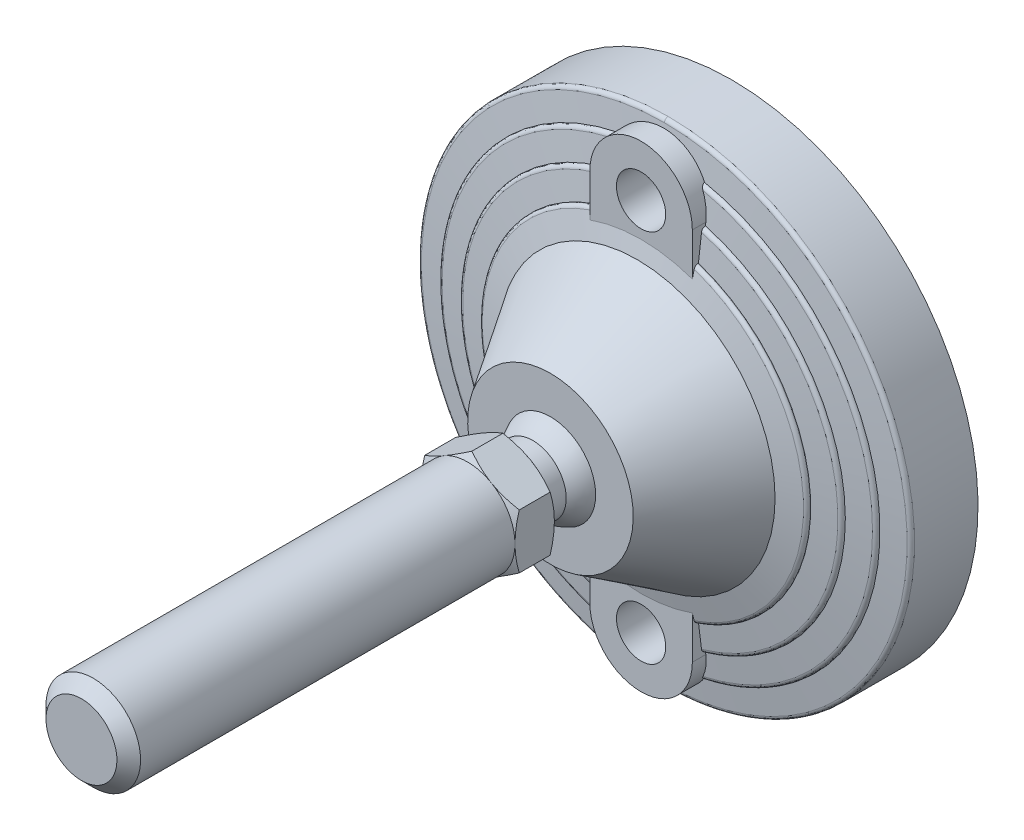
ISO-10303-21;
HEADER;
FILE_DESCRIPTION(('STEP AP214'),'2;1');
FILE_NAME('part.step','',(''),(''),'','','');
FILE_SCHEMA(('AUTOMOTIVE_DESIGN { 1 0 10303 214 1 1 1 1 }'));
ENDSEC;
DATA;
#1=APPLICATION_CONTEXT('core data for automotive mechanical design processes');
#2=APPLICATION_PROTOCOL_DEFINITION('international standard','automotive_design',2000,#1);
#3=PRODUCT_CONTEXT('',#1,'mechanical');
#4=PRODUCT('Part','Part','',(#3));
#5=PRODUCT_RELATED_PRODUCT_CATEGORY('part','',(#4));
#6=PRODUCT_DEFINITION_FORMATION('','',#4);
#7=PRODUCT_DEFINITION_CONTEXT('part definition',#1,'design');
#8=PRODUCT_DEFINITION('design','',#6,#7);
#9=PRODUCT_DEFINITION_SHAPE('','',#8);
#10=(LENGTH_UNIT() NAMED_UNIT(*) SI_UNIT(.MILLI.,.METRE.));
#11=(NAMED_UNIT(*) PLANE_ANGLE_UNIT() SI_UNIT($,.RADIAN.));
#12=(NAMED_UNIT(*) SI_UNIT($,.STERADIAN.) SOLID_ANGLE_UNIT());
#13=UNCERTAINTY_MEASURE_WITH_UNIT(LENGTH_MEASURE(1.E-05),#10,'distance_accuracy_value','');
#14=(GEOMETRIC_REPRESENTATION_CONTEXT(3) GLOBAL_UNCERTAINTY_ASSIGNED_CONTEXT((#13)) GLOBAL_UNIT_ASSIGNED_CONTEXT((#10,
#11,#12)) REPRESENTATION_CONTEXT('',''));
#15=CARTESIAN_POINT('',(0.,0.,0.));
#16=DIRECTION('',(0.,0.,1.));
#17=DIRECTION('',(1.,0.,0.));
#18=AXIS2_PLACEMENT_3D('',#15,#16,#17);
#19=CARTESIAN_POINT('',(-12.,14.022683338,57.));
#20=DIRECTION('',(0.,0.,1.));
#21=DIRECTION('',(0.,-1.,0.));
#22=AXIS2_PLACEMENT_3D('',#19,#20,#21);
#23=PLANE('',#22);
#24=CARTESIAN_POINT('',(0.,0.,57.));
#25=DIRECTION('',(0.,0.,-1.));
#26=DIRECTION('',(1.,0.,0.));
#27=AXIS2_PLACEMENT_3D('',#24,#25,#26);
#28=CIRCLE('',#27,8.5);
#29=CARTESIAN_POINT('',(8.5,0.,57.));
#30=VERTEX_POINT('',#29);
#31=EDGE_CURVE('E549',#30,#30,#28,.T.);
#32=ORIENTED_EDGE('',*,*,#31,.F.);
#33=EDGE_LOOP('',(#32));
#34=FACE_BOUND('',#33,.T.);
#35=CARTESIAN_POINT('',(0.,0.,57.));
#36=DIRECTION('',(0.,0.,1.));
#37=DIRECTION('',(0.,-1.,0.));
#38=AXIS2_PLACEMENT_3D('',#35,#36,#37);
#39=CIRCLE('',#38,12.);
#40=CARTESIAN_POINT('',(6.00000000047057,-10.3923048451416,57.));
#41=VERTEX_POINT('',#40);
#42=CARTESIAN_POINT('',(-6.00000000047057,-10.3923048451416,57.));
#43=VERTEX_POINT('',#42);
#44=EDGE_CURVE('E26',#41,#43,#39,.F.);
#45=ORIENTED_EDGE('',*,*,#44,.T.);
#46=CARTESIAN_POINT('',(-12.,0.,57.));
#47=VERTEX_POINT('',#46);
#48=EDGE_CURVE('E9',#43,#47,#39,.F.);
#49=ORIENTED_EDGE('',*,*,#48,.T.);
#50=CARTESIAN_POINT('',(-6.00000000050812,10.3923048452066,57.));
#51=VERTEX_POINT('',#50);
#52=EDGE_CURVE('E25',#47,#51,#39,.F.);
#53=ORIENTED_EDGE('',*,*,#52,.T.);
#54=CARTESIAN_POINT('',(6.00000000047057,10.3923048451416,57.));
#55=VERTEX_POINT('',#54);
#56=EDGE_CURVE('E239',#51,#55,#39,.F.);
#57=ORIENTED_EDGE('',*,*,#56,.T.);
#58=CARTESIAN_POINT('',(0.,0.,57.));
#59=DIRECTION('',(0.,0.,-1.));
#60=DIRECTION('',(0.,1.,0.));
#61=AXIS2_PLACEMENT_3D('',#58,#59,#60);
#62=CIRCLE('',#61,12.);
#63=CARTESIAN_POINT('',(12.,0.,57.));
#64=VERTEX_POINT('',#63);
#65=EDGE_CURVE('E253',#55,#64,#62,.T.);
#66=ORIENTED_EDGE('',*,*,#65,.T.);
#67=EDGE_CURVE('E262',#64,#41,#39,.F.);
#68=ORIENTED_EDGE('',*,*,#67,.T.);
#69=EDGE_LOOP('',(#45,#49,#53,#57,#66,#68));
#70=FACE_BOUND('',#69,.T.);
#71=ADVANCED_FACE('F14',(#34,#70),#23,.F.);
#72=CARTESIAN_POINT('',(0.,0.,57.));
#73=DIRECTION('',(0.,0.,-1.));
#74=DIRECTION('',(1.,0.,0.));
#75=AXIS2_PLACEMENT_3D('',#72,#73,#74);
#76=CYLINDRICAL_SURFACE('',#75,8.5);
#77=ORIENTED_EDGE('',*,*,#31,.T.);
#78=EDGE_LOOP('',(#77));
#79=FACE_BOUND('',#78,.T.);
#80=CARTESIAN_POINT('',(0.,0.,50.5000000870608));
#81=DIRECTION('',(0.,0.,-1.));
#82=DIRECTION('',(-1.,0.,0.));
#83=AXIS2_PLACEMENT_3D('',#80,#81,#82);
#84=CIRCLE('',#83,8.49999990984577);
#85=CARTESIAN_POINT('',(-8.49999990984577,0.,50.5000000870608));
#86=VERTEX_POINT('',#85);
#87=EDGE_CURVE('E548',#86,#86,#84,.T.);
#88=ORIENTED_EDGE('',*,*,#87,.F.);
#89=EDGE_LOOP('',(#88));
#90=FACE_BOUND('',#89,.T.);
#91=ADVANCED_FACE('F367',(#79,#90),#76,.T.);
#92=CARTESIAN_POINT('',(0.,0.,41.678860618));
#93=DIRECTION('',(0.,0.,-1.));
#94=DIRECTION('',(1.,0.,0.));
#95=AXIS2_PLACEMENT_3D('',#92,#93,#94);
#96=SPHERICAL_SURFACE('',#95,12.25);
#97=CARTESIAN_POINT('',(0.,0.,46.));
#98=DIRECTION('',(0.,0.,-1.));
#99=DIRECTION('',(0.,1.,0.));
#100=AXIS2_PLACEMENT_3D('',#97,#98,#99);
#101=CIRCLE('',#100,11.4625588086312);
#102=CARTESIAN_POINT('',(0.,11.4625588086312,46.));
#103=VERTEX_POINT('',#102);
#104=EDGE_CURVE('E545',#103,#103,#101,.F.);
#105=ORIENTED_EDGE('',*,*,#104,.T.);
#106=EDGE_LOOP('',(#105));
#107=FACE_BOUND('',#106,.T.);
#108=ORIENTED_EDGE('',*,*,#87,.T.);
#109=EDGE_LOOP('',(#108));
#110=FACE_BOUND('',#109,.T.);
#111=ADVANCED_FACE('F362',(#107,#110),#96,.T.);
#112=CARTESIAN_POINT('',(-21.325127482,-21.252,46.));
#113=DIRECTION('',(0.,0.,-1.));
#114=DIRECTION('',(0.,1.,0.));
#115=AXIS2_PLACEMENT_3D('',#112,#113,#114);
#116=PLANE('',#115);
#117=ORIENTED_EDGE('',*,*,#104,.F.);
#118=EDGE_LOOP('',(#117));
#119=FACE_BOUND('',#118,.T.);
#120=CARTESIAN_POINT('',(0.,0.,46.));
#121=DIRECTION('',(0.,0.,-1.));
#122=DIRECTION('',(0.,1.,0.));
#123=AXIS2_PLACEMENT_3D('',#120,#121,#122);
#124=CIRCLE('',#123,21.);
#125=CARTESIAN_POINT('',(0.,21.,46.));
#126=VERTEX_POINT('',#125);
#127=EDGE_CURVE('E408',#126,#126,#124,.T.);
#128=ORIENTED_EDGE('',*,*,#127,.F.);
#129=EDGE_LOOP('',(#128));
#130=FACE_BOUND('',#129,.T.);
#131=ADVANCED_FACE('F366',(#119,#130),#116,.F.);
#132=CARTESIAN_POINT('',(0.,-47.5,0.));
#133=DIRECTION('',(0.,0.,1.));
#134=DIRECTION('',(0.,-1.,0.));
#135=AXIS2_PLACEMENT_3D('',#132,#133,#134);
#136=CYLINDRICAL_SURFACE('',#135,6.25);
#137=CARTESIAN_POINT('',(0.,-47.5,0.));
#138=DIRECTION('',(0.,0.,1.));
#139=DIRECTION('',(0.,-1.,0.));
#140=AXIS2_PLACEMENT_3D('',#137,#138,#139);
#141=CIRCLE('',#140,6.25);
#142=CARTESIAN_POINT('',(0.,-53.75,0.));
#143=VERTEX_POINT('',#142);
#144=EDGE_CURVE('E541',#143,#143,#141,.F.);
#145=ORIENTED_EDGE('',*,*,#144,.T.);
#146=EDGE_LOOP('',(#145));
#147=FACE_BOUND('',#146,.T.);
#148=CARTESIAN_POINT('',(0.,-47.5,23.));
#149=DIRECTION('',(0.,0.,1.));
#150=DIRECTION('',(0.,-1.,0.));
#151=AXIS2_PLACEMENT_3D('',#148,#149,#150);
#152=CIRCLE('',#151,6.25);
#153=CARTESIAN_POINT('',(0.,-53.75,23.));
#154=VERTEX_POINT('',#153);
#155=EDGE_CURVE('E745',#154,#154,#152,.T.);
#156=ORIENTED_EDGE('',*,*,#155,.T.);
#157=EDGE_LOOP('',(#156));
#158=FACE_BOUND('',#157,.T.);
#159=ADVANCED_FACE('F370',(#147,#158),#136,.F.);
#160=CARTESIAN_POINT('',(-63.467641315,63.25,0.));
#161=DIRECTION('',(0.,0.,1.));
#162=DIRECTION('',(0.,-1.,0.));
#163=AXIS2_PLACEMENT_3D('',#160,#161,#162);
#164=PLANE('',#163);
#165=ORIENTED_EDGE('',*,*,#144,.F.);
#166=EDGE_LOOP('',(#165));
#167=FACE_BOUND('',#166,.T.);
#168=CARTESIAN_POINT('',(0.,47.5,0.));
#169=DIRECTION('',(0.,0.,1.));
#170=DIRECTION('',(0.,-1.,0.));
#171=AXIS2_PLACEMENT_3D('',#168,#169,#170);
#172=CIRCLE('',#171,6.25);
#173=CARTESIAN_POINT('',(0.,41.25,0.));
#174=VERTEX_POINT('',#173);
#175=EDGE_CURVE('E603',#174,#174,#172,.T.);
#176=ORIENTED_EDGE('',*,*,#175,.T.);
#177=EDGE_LOOP('',(#176));
#178=FACE_BOUND('',#177,.T.);
#179=CARTESIAN_POINT('',(0.,0.,0.));
#180=DIRECTION('',(0.,0.,-1.));
#181=DIRECTION('',(0.,1.,0.));
#182=AXIS2_PLACEMENT_3D('',#179,#180,#181);
#183=CIRCLE('',#182,62.5);
#184=CARTESIAN_POINT('',(0.,62.5,0.));
#185=VERTEX_POINT('',#184);
#186=EDGE_CURVE('E537',#185,#185,#183,.F.);
#187=ORIENTED_EDGE('',*,*,#186,.F.);
#188=EDGE_LOOP('',(#187));
#189=FACE_BOUND('',#188,.T.);
#190=ADVANCED_FACE('F373',(#167,#178,#189),#164,.F.);
#191=CARTESIAN_POINT('',(12.406354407,39.602176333,21.568111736));
#192=CARTESIAN_POINT('',(59.707464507,24.78394183,21.568111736));
#193=CARTESIAN_POINT('',(59.707464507,-24.78394183,21.568111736));
#194=CARTESIAN_POINT('',(12.406354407,-39.602176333,21.568111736));
#195=CARTESIAN_POINT('',(12.406354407,39.602176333,22.044046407));
#196=CARTESIAN_POINT('',(59.707464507,24.78394183,22.044046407));
#197=CARTESIAN_POINT('',(59.707464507,-24.78394183,22.044046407));
#198=CARTESIAN_POINT('',(12.406354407,-39.602176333,22.044046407));
#199=CARTESIAN_POINT('',(12.31903347,39.323440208,22.419805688));
#200=CARTESIAN_POINT('',(59.287219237,24.609502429,22.419805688));
#201=CARTESIAN_POINT('',(59.287219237,-24.609502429,22.419805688));
#202=CARTESIAN_POINT('',(12.31903347,-39.323440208,22.419805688));
#203=CARTESIAN_POINT('',(12.18115046,38.883305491,22.53720891));
#204=CARTESIAN_POINT('',(58.623636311,24.334056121,22.53720891));
#205=CARTESIAN_POINT('',(58.623636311,-24.334056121,22.53720891));
#206=CARTESIAN_POINT('',(12.18115046,-38.883305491,22.53720891));
#207=(BOUNDED_SURFACE() B_SPLINE_SURFACE(3,3,((#191,#192,#193,#194),(#195,#196,#197,#198),(#199,
#200,#201,#202),(#203,#204,#205,#206)),.UNSPECIFIED.,.F.,.F.,
.F.) B_SPLINE_SURFACE_WITH_KNOTS((4,4),(4,4),(0.,1.),(0.,1.),
.UNSPECIFIED.) GEOMETRIC_REPRESENTATION_ITEM() RATIONAL_B_SPLINE_SURFACE(((1.,0.532632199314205,
0.532632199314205,1.),(0.859679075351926,0.457892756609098,0.457892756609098,0.859679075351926),
(0.859679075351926,0.457892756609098,0.457892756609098,0.859679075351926),(1.,0.532632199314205,
0.532632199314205,1.))) REPRESENTATION_ITEM('') SURFACE());
#208=CARTESIAN_POINT('',(0.,0.,22.53720891));
#209=DIRECTION('',(0.,0.,-1.));
#210=DIRECTION('',(0.,1.,0.));
#211=AXIS2_PLACEMENT_3D('',#208,#209,#210);
#212=CIRCLE('',#211,40.746679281);
#213=CARTESIAN_POINT('',(13.,-38.6172483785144,22.537208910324));
#214=VERTEX_POINT('',#213);
#215=CARTESIAN_POINT('',(13.,38.6172483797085,22.5372089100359));
#216=VERTEX_POINT('',#215);
#217=EDGE_CURVE('E738',#214,#216,#212,.F.);
#218=CARTESIAN_POINT('',(13.,-39.4112927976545,21.5681117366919));
#219=CARTESIAN_POINT('',(13.,-39.4112933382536,21.59521048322));
#220=CARTESIAN_POINT('',(13.,-39.4101321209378,21.6222958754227));
#221=CARTESIAN_POINT('',(13.,-39.4055044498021,21.6762650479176));
#222=CARTESIAN_POINT('',(13.,-39.4020383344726,21.7031488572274));
#223=CARTESIAN_POINT('',(13.,-39.3882336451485,21.7831079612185));
#224=CARTESIAN_POINT('',(13.,-39.3744885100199,21.8356344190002));
#225=CARTESIAN_POINT('',(13.,-39.3384084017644,21.937608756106));
#226=CARTESIAN_POINT('',(13.,-39.3160736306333,21.987056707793));
#227=CARTESIAN_POINT('',(13.,-39.2635909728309,22.0816017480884));
#228=CARTESIAN_POINT('',(13.,-39.233444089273,22.1266993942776));
#229=CARTESIAN_POINT('',(13.,-39.1656058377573,22.2123360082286));
#230=CARTESIAN_POINT('',(13.,-39.1277714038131,22.2527614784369));
#231=CARTESIAN_POINT('',(13.,-39.0461074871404,22.327071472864));
#232=CARTESIAN_POINT('',(13.,-39.0022718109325,22.3609491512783));
#233=CARTESIAN_POINT('',(13.,-38.9043172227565,22.4250520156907));
#234=CARTESIAN_POINT('',(13.,-38.8495953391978,22.4543647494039));
#235=CARTESIAN_POINT('',(13.,-38.7644641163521,22.4909906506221));
#236=CARTESIAN_POINT('',(13.,-38.7355751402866,22.5019763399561));
#237=CARTESIAN_POINT('',(13.,-38.6769796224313,22.5214626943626));
#238=CARTESIAN_POINT('',(13.,-38.6472733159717,22.5299640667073));
#239=CARTESIAN_POINT('',(13.,-38.6172483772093,22.5372089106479));
#240=B_SPLINE_CURVE_WITH_KNOTS('',3,(#218,#219,#220,#221,#222,#223,#224,#225,#226,#227,#228,
#229,#230,#231,#232,#233,#234,#235,#236,#237,#238,#239),.UNSPECIFIED.,.F.,.F.,(4,2,2,2,2,2,2,2,
2,2,4),(0.,0.0812450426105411,0.162478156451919,0.324519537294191,0.486557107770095,
0.648573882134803,0.813939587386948,0.979477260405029,1.16468654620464,1.25731455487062,
1.34991616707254),.UNSPECIFIED.);
#241=CARTESIAN_POINT('',(13.,-39.4112927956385,21.568111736));
#242=VERTEX_POINT('',#241);
#243=EDGE_CURVE('E400',#242,#214,#240,.T.);
#244=CARTESIAN_POINT('',(0.,0.,21.568111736));
#245=DIRECTION('',(0.,0.,-1.));
#246=DIRECTION('',(0.,1.,0.));
#247=AXIS2_PLACEMENT_3D('',#244,#245,#246);
#248=CIRCLE('',#247,41.5);
#249=CARTESIAN_POINT('',(13.,39.4112927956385,21.5681117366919));
#250=VERTEX_POINT('',#249);
#251=EDGE_CURVE('E544',#250,#242,#248,.T.);
#252=CARTESIAN_POINT('',(13.,38.6172483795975,22.5372089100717));
#253=CARTESIAN_POINT('',(13.,38.6757273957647,22.5231434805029));
#254=CARTESIAN_POINT('',(13.,38.7330575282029,22.5042077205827));
#255=CARTESIAN_POINT('',(13.,38.843898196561,22.4570874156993));
#256=CARTESIAN_POINT('',(13.,38.8974017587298,22.4288864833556));
#257=CARTESIAN_POINT('',(13.,38.9989209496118,22.3637346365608));
#258=CARTESIAN_POINT('',(13.,39.0469285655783,22.3267711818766));
#259=CARTESIAN_POINT('',(13.,39.1357078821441,22.2450475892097));
#260=CARTESIAN_POINT('',(13.,39.1764870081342,22.2002955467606));
#261=CARTESIAN_POINT('',(13.,39.2479885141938,22.1059931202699));
#262=CARTESIAN_POINT('',(13.,39.2790300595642,22.0566848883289));
#263=CARTESIAN_POINT('',(13.,39.3318958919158,21.9533393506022));
#264=CARTESIAN_POINT('',(13.,39.3537228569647,21.8993034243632));
#265=CARTESIAN_POINT('',(13.,39.3839717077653,21.7991363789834));
#266=CARTESIAN_POINT('',(13.,39.3941848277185,21.7535382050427));
#267=CARTESIAN_POINT('',(13.,39.4078594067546,21.6613400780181));
#268=CARTESIAN_POINT('',(13.,39.411320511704,21.6147400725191));
#269=CARTESIAN_POINT('',(13.,39.4112927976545,21.5681117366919));
#270=B_SPLINE_CURVE_WITH_KNOTS('',3,(#252,#253,#254,#255,#256,#257,#258,#259,#260,#261,#262,
#263,#264,#265,#266,#267,#268,#269),.UNSPECIFIED.,.F.,.F.,(4,2,2,2,2,2,2,2,4),(0.,
0.180276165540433,0.360872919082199,0.541729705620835,0.722399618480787,0.896310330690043,
1.07017046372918,1.20986980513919,1.34957647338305),.UNSPECIFIED.);
#271=EDGE_CURVE('E391',#216,#250,#270,.T.);
#272=ORIENTED_EDGE('',*,*,#217,.F.);
#273=ORIENTED_EDGE('',*,*,#243,.F.);
#274=ORIENTED_EDGE('',*,*,#251,.F.);
#275=ORIENTED_EDGE('',*,*,#271,.F.);
#276=EDGE_LOOP('',(#272,#273,#274,#275));
#277=FACE_BOUND('',#276,.T.);
#278=ADVANCED_FACE('F375',(#277),#207,.T.);
#279=CARTESIAN_POINT('',(0.,0.,21.568111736));
#280=DIRECTION('',(0.,0.,-1.));
#281=DIRECTION('',(0.,1.,0.));
#282=AXIS2_PLACEMENT_3D('',#279,#280,#281);
#283=CYLINDRICAL_SURFACE('',#282,41.5);
#284=CARTESIAN_POINT('',(0.,0.,21.4545454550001));
#285=DIRECTION('',(0.,0.,-1.));
#286=DIRECTION('',(0.,1.,0.));
#287=AXIS2_PLACEMENT_3D('',#284,#285,#286);
#288=CIRCLE('',#287,41.5);
#289=CARTESIAN_POINT('',(13.,39.4112927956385,21.4545454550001));
#290=VERTEX_POINT('',#289);
#291=CARTESIAN_POINT('',(13.,-39.4112927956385,21.4545454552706));
#292=VERTEX_POINT('',#291);
#293=EDGE_CURVE('E736',#290,#292,#288,.T.);
#294=ORIENTED_EDGE('',*,*,#293,.F.);
#295=DIRECTION('',(0.,0.,-1.));
#296=VECTOR('',#295,1.);
#297=CARTESIAN_POINT('',(13.,39.4112927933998,21.2785712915));
#298=LINE('',#297,#296);
#299=EDGE_CURVE('E628',#250,#290,#298,.T.);
#300=ORIENTED_EDGE('',*,*,#299,.F.);
#301=ORIENTED_EDGE('',*,*,#251,.T.);
#302=DIRECTION('',(0.,0.,1.));
#303=VECTOR('',#302,1.);
#304=CARTESIAN_POINT('',(13.,-39.4112927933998,21.2785712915));
#305=LINE('',#304,#303);
#306=EDGE_CURVE('E409',#292,#242,#305,.T.);
#307=ORIENTED_EDGE('',*,*,#306,.F.);
#308=EDGE_LOOP('',(#294,#300,#301,#307));
#309=FACE_BOUND('',#308,.T.);
#310=ADVANCED_FACE('F381',(#309),#283,.T.);
#311=CARTESIAN_POINT('',(0.,0.,21.454545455));
#312=DIRECTION('',(0.,0.,-1.));
#313=DIRECTION('',(0.,1.,0.));
#314=AXIS2_PLACEMENT_3D('',#311,#312,#313);
#315=CONICAL_SURFACE('',#314,41.5,1.4442041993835);
#316=ORIENTED_EDGE('',*,*,#293,.T.);
#317=CARTESIAN_POINT('',(13.0000000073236,-45.8176832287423,20.6748403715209));
#318=CARTESIAN_POINT('',(13.0000000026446,-45.2838642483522,20.7402005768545));
#319=CARTESIAN_POINT('',(13.000000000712,-44.7500350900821,20.8054777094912));
#320=CARTESIAN_POINT('',(12.999999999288,-43.6823542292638,20.9358466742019));
#321=CARTESIAN_POINT('',(12.9999999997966,-43.1485025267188,21.0009385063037));
#322=CARTESIAN_POINT('',(13.0000000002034,-42.0807742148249,21.1309177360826));
#323=CARTESIAN_POINT('',(13.0000000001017,-41.5468976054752,21.195805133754));
#324=CARTESIAN_POINT('',(12.9999999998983,-40.4791166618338,21.3253520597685));
#325=CARTESIAN_POINT('',(12.9999999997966,-39.9452123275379,21.3900115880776));
#326=CARTESIAN_POINT('',(13.,-39.4112927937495,21.4545454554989));
#327=B_SPLINE_CURVE_WITH_KNOTS('',3,(#317,#318,#319,#320,#321,#322,#323,#324,#325,#326),
.UNSPECIFIED.,.F.,.F.,(4,2,2,2,4),(0.,1.61341623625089,3.22683223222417,4.84024827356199,
6.4536645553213),.UNSPECIFIED.);
#328=CARTESIAN_POINT('',(13.,-45.8176832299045,20.6748403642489));
#329=VERTEX_POINT('',#328);
#330=EDGE_CURVE('E411',#329,#292,#327,.T.);
#331=ORIENTED_EDGE('',*,*,#330,.F.);
#332=CARTESIAN_POINT('',(-7.48560935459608E-10,0.,20.674840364));
#333=DIRECTION('',(0.,0.,-1.));
#334=DIRECTION('',(0.,1.,0.));
#335=AXIS2_PLACEMENT_3D('',#332,#333,#334);
#336=CIRCLE('',#335,47.6262542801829);
#337=CARTESIAN_POINT('',(13.,45.8176832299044,20.6748403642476));
#338=VERTEX_POINT('',#337);
#339=EDGE_CURVE('E359',#338,#329,#336,.T.);
#340=ORIENTED_EDGE('',*,*,#339,.F.);
#341=CARTESIAN_POINT('',(13.,39.4112927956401,21.4545454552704));
#342=CARTESIAN_POINT('',(13.,39.9452123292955,21.3900115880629));
#343=CARTESIAN_POINT('',(13.,40.4791166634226,21.3253520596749));
#344=CARTESIAN_POINT('',(13.,41.5468976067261,21.195805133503));
#345=CARTESIAN_POINT('',(13.,42.0807742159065,21.1309177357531));
#346=CARTESIAN_POINT('',(13.,43.1485025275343,21.0009385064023));
#347=CARTESIAN_POINT('',(13.,43.6823542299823,20.9358466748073));
#348=CARTESIAN_POINT('',(13.,44.7500350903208,20.805477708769));
#349=CARTESIAN_POINT('',(13.,45.283864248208,20.7402005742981));
#350=CARTESIAN_POINT('',(13.,45.8176832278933,20.6748403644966));
#351=B_SPLINE_CURVE_WITH_KNOTS('',3,(#341,#342,#343,#344,#345,#346,#347,#348,#349,#350),
.UNSPECIFIED.,.F.,.F.,(4,2,2,2,4),(0.,1.61341628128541,3.22683232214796,4.84024831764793,
6.45366455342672),.UNSPECIFIED.);
#352=EDGE_CURVE('E622',#290,#338,#351,.T.);
#353=ORIENTED_EDGE('',*,*,#352,.F.);
#354=EDGE_LOOP('',(#316,#331,#340,#353));
#355=FACE_BOUND('',#354,.T.);
#356=ADVANCED_FACE('F512',(#355),#315,.T.);
#357=CARTESIAN_POINT('',(12.269850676,46.922284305,19.669623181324));
#358=CARTESIAN_POINT('',(72.5576318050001,31.15744926,19.669623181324));
#359=CARTESIAN_POINT('',(72.5576318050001,-31.15744926,19.669623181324));
#360=CARTESIAN_POINT('',(12.269850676,-46.922284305,19.669623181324));
#361=CARTESIAN_POINT('',(12.269850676,46.922284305,19.6740296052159));
#362=CARTESIAN_POINT('',(72.5576318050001,31.15744926,19.674029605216));
#363=CARTESIAN_POINT('',(72.5576318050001,-31.15744926,19.674029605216));
#364=CARTESIAN_POINT('',(12.269850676,-46.922284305,19.6740296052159));
#365=CARTESIAN_POINT('',(12.269850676,46.922284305,19.678436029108));
#366=CARTESIAN_POINT('',(72.5576318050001,31.15744926,19.678436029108));
#367=CARTESIAN_POINT('',(72.5576318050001,-31.15744926,19.678436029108));
#368=CARTESIAN_POINT('',(12.269850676,-46.922284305,19.678436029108));
#369=CARTESIAN_POINT('',(12.269850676,46.922284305,19.682842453));
#370=CARTESIAN_POINT('',(72.5576318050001,31.15744926,19.682842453));
#371=CARTESIAN_POINT('',(72.5576318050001,-31.15744926,19.682842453));
#372=CARTESIAN_POINT('',(12.269850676,-46.922284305,19.682842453));
#373=CARTESIAN_POINT('',(12.269850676,46.922284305,20.211436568));
#374=CARTESIAN_POINT('',(72.557631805,31.15744926,20.211436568));
#375=CARTESIAN_POINT('',(72.557631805,-31.15744926,20.211436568));
#376=CARTESIAN_POINT('',(12.269850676,-46.922284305,20.211436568));
#377=CARTESIAN_POINT('',(12.181461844,46.584268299,20.608103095));
#378=CARTESIAN_POINT('',(72.034945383,30.93299905,20.608103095));
#379=CARTESIAN_POINT('',(72.034945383,-30.93299905,20.608103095));
#380=CARTESIAN_POINT('',(12.181461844,-46.584268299,20.608103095));
#381=CARTESIAN_POINT('',(12.048804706,46.076961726,20.674840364));
#382=CARTESIAN_POINT('',(71.250478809,30.596136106,20.674840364));
#383=CARTESIAN_POINT('',(71.250478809,-30.596136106,20.674840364));
#384=CARTESIAN_POINT('',(12.048804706,-46.076961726,20.674840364));
#385=(BOUNDED_SURFACE() B_SPLINE_SURFACE(3,3,((#357,#358,#359,#360),(#361,#362,#363,#364),(#365,
#366,#367,#368),(#369,#370,#371,#372),(#373,#374,#375,#376),(#377,#378,#379,#380),(#381,#382,
#383,#384)),.UNSPECIFIED.,.F.,.F.,.F.) B_SPLINE_SURFACE_WITH_KNOTS((4,3,4),(4,4),(-0.01,0.,1.),
(0.,1.),.UNSPECIFIED.) GEOMETRIC_REPRESENTATION_ITEM() RATIONAL_B_SPLINE_SURFACE(((1.,
0.50199107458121,0.50199107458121,1.),(1.,0.50199107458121,0.50199107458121,1.),(1.,
0.50199107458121,0.50199107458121,1.),(1.,0.50199107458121,0.50199107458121,1.),
(0.833611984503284,0.418465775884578,0.418465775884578,0.833611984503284),(0.833611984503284,
0.418465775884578,0.418465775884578,0.833611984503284),(1.,0.50199107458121,0.50199107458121,1.))) REPRESENTATION_ITEM('') SURFACE());
#386=CARTESIAN_POINT('',(13.,-46.7252608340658,19.6777848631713));
#387=CARTESIAN_POINT('',(13.,-46.7253979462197,19.7054287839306));
#388=CARTESIAN_POINT('',(13.,-46.7243484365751,19.7330653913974));
#389=CARTESIAN_POINT('',(13.,-46.7198870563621,19.7881439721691));
#390=CARTESIAN_POINT('',(13.,-46.7164754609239,19.8155859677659));
#391=CARTESIAN_POINT('',(13.,-46.702737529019,19.8972169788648));
#392=CARTESIAN_POINT('',(13.,-46.6889086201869,19.950857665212));
#393=CARTESIAN_POINT('',(13.,-46.6523707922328,20.0550506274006));
#394=CARTESIAN_POINT('',(13.,-46.6296523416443,20.1055995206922));
#395=CARTESIAN_POINT('',(13.,-46.5760978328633,20.2021956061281));
#396=CARTESIAN_POINT('',(13.,-46.5452617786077,20.2482428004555));
#397=CARTESIAN_POINT('',(13.,-46.476285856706,20.3348542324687));
#398=CARTESIAN_POINT('',(13.,-46.4381108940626,20.3753904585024));
#399=CARTESIAN_POINT('',(13.,-46.3556866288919,20.4497572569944));
#400=CARTESIAN_POINT('',(13.,-46.3114344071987,20.4835845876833));
#401=CARTESIAN_POINT('',(13.,-46.216467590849,20.5448274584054));
#402=CARTESIAN_POINT('',(13.,-46.16557969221,20.5719736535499));
#403=CARTESIAN_POINT('',(13.,-46.0601083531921,20.6176355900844));
#404=CARTESIAN_POINT('',(13.,-46.0055288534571,20.6361603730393));
#405=CARTESIAN_POINT('',(13.,-45.9281089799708,20.6556819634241));
#406=CARTESIAN_POINT('',(13.,-45.9061721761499,20.6604842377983));
#407=CARTESIAN_POINT('',(13.,-45.8620822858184,20.6686997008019));
#408=CARTESIAN_POINT('',(13.,-45.8399296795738,20.6721154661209));
#409=CARTESIAN_POINT('',(13.0000000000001,-45.8176832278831,20.6748403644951));
#410=B_SPLINE_CURVE_WITH_KNOTS('',3,(#386,#387,#388,#389,#390,#391,#392,#393,#394,#395,#396,
#397,#398,#399,#400,#401,#402,#403,#404,#405,#406,#407,#408,#409),.UNSPECIFIED.,.F.,.F.,(4,2,2,
2,2,2,2,2,2,2,2,4),(0.,0.0828810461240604,0.165752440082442,0.331061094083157,0.496547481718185,
0.66203378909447,0.828332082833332,0.994710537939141,1.16697834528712,1.3390650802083,
1.40639957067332,1.4736083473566),.UNSPECIFIED.);
#411=CARTESIAN_POINT('',(13.0000000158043,-46.7252608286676,19.6777848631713));
#412=VERTEX_POINT('',#411);
#413=EDGE_CURVE('E536',#412,#329,#410,.T.);
#414=CARTESIAN_POINT('',(13.0000000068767,46.7252608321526,19.6727272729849));
#415=CARTESIAN_POINT('',(13.3212147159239,46.6358917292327,19.6727272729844));
#416=CARTESIAN_POINT('',(13.6414983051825,46.543212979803,19.6727272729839));
#417=CARTESIAN_POINT('',(14.280123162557,46.3512597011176,19.6727272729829));
#418=CARTESIAN_POINT('',(14.5984642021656,46.2519844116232,19.6727272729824));
#419=CARTESIAN_POINT('',(15.5526106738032,45.9435979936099,19.672727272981));
#420=CARTESIAN_POINT('',(16.1852411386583,45.7245656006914,19.67272727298));
#421=CARTESIAN_POINT('',(17.4409289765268,45.2604918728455,19.6727272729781));
#422=CARTESIAN_POINT('',(18.0639854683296,45.0154481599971,19.6727272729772));
#423=CARTESIAN_POINT('',(19.3000708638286,44.4995075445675,19.6727272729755));
#424=CARTESIAN_POINT('',(19.9130888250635,44.2285843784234,19.6727272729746));
#425=CARTESIAN_POINT('',(21.1274202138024,43.6615551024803,19.672727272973));
#426=CARTESIAN_POINT('',(21.7287319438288,43.3654453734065,19.6727272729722));
#427=CARTESIAN_POINT('',(23.5288179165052,42.4321391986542,19.6727272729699));
#428=CARTESIAN_POINT('',(24.7079785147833,41.7565378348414,19.6727272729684));
#429=CARTESIAN_POINT('',(27.0057517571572,40.3086198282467,19.6727272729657));
#430=CARTESIAN_POINT('',(28.1243409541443,39.5362661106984,19.6727272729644));
#431=CARTESIAN_POINT('',(30.2940548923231,37.8994558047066,19.6727272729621));
#432=CARTESIAN_POINT('',(31.3451007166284,37.0348945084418,19.672727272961));
#433=CARTESIAN_POINT('',(33.3707378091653,35.2206260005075,19.6727272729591));
#434=CARTESIAN_POINT('',(34.3453363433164,34.2709268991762,19.6727272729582));
#435=CARTESIAN_POINT('',(36.2141318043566,32.2900336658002,19.6727272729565));
#436=CARTESIAN_POINT('',(37.1080775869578,31.258602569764,19.6727272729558));
#437=CARTESIAN_POINT('',(38.8059105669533,29.1240638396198,19.6727272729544));
#438=CARTESIAN_POINT('',(39.6097954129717,28.0209543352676,19.6727272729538));
#439=CARTESIAN_POINT('',(41.1215543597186,25.7512426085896,19.6727272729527));
#440=CARTESIAN_POINT('',(41.8294551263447,24.584658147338,19.6727272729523));
#441=CARTESIAN_POINT('',(43.1444737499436,22.1960153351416,19.6727272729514));
#442=CARTESIAN_POINT('',(43.7515922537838,20.9739573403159,19.672727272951));
#443=CARTESIAN_POINT('',(44.8608053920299,18.4828923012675,19.6727272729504));
#444=CARTESIAN_POINT('',(45.3628870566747,17.2138794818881,19.6727272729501));
#445=CARTESIAN_POINT('',(46.2583633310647,14.6380667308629,19.6727272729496));
#446=CARTESIAN_POINT('',(46.6517577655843,13.3312667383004,19.6727272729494));
#447=CARTESIAN_POINT('',(47.3270705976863,10.6891374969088,19.6727272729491));
#448=CARTESIAN_POINT('',(47.6089860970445,9.35380750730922,19.672727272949));
#449=CARTESIAN_POINT('',(48.059322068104,6.66414532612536,19.6727272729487));
#450=CARTESIAN_POINT('',(48.2277425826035,5.30981314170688,19.6727272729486));
#451=CARTESIAN_POINT('',(48.4498861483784,2.59183878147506,19.6727272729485));
#452=CARTESIAN_POINT('',(48.5036145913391,1.22819704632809,19.6727272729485));
#453=CARTESIAN_POINT('',(48.4960080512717,-1.49876561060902,19.6727272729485));
#454=CARTESIAN_POINT('',(48.4346730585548,-2.86208653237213,19.6727272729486));
#455=CARTESIAN_POINT('',(48.1973677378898,-5.57880747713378,19.6727272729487));
#456=CARTESIAN_POINT('',(48.0213896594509,-6.93220682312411,19.6727272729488));
#457=CARTESIAN_POINT('',(47.5560413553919,-9.61936955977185,19.672727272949));
#458=CARTESIAN_POINT('',(47.2666711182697,-10.9531329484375,19.6727272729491));
#459=CARTESIAN_POINT('',(46.5765756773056,-13.5916227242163,19.6727272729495));
#460=CARTESIAN_POINT('',(46.1758433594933,-14.896347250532,19.6727272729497));
#461=CARTESIAN_POINT('',(45.2658742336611,-17.4674022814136,19.6727272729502));
#462=CARTESIAN_POINT('',(44.7566374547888,-18.7337327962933,19.6727272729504));
#463=CARTESIAN_POINT('',(43.633416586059,-21.2187182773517,19.6727272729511));
#464=CARTESIAN_POINT('',(43.0194530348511,-22.437382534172,19.6727272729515));
#465=CARTESIAN_POINT('',(41.690975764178,-24.8187625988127,19.6727272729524));
#466=CARTESIAN_POINT('',(40.9764619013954,-25.9814783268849,19.6727272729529));
#467=CARTESIAN_POINT('',(39.706302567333,-27.8655028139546,19.6727272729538));
#468=CARTESIAN_POINT('',(39.1770724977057,-28.6047764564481,19.6727272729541));
#469=CARTESIAN_POINT('',(38.0778809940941,-30.0524665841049,19.672727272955));
#470=CARTESIAN_POINT('',(37.5079195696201,-30.760883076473,19.6727272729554));
#471=CARTESIAN_POINT('',(36.3291070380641,-32.144549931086,19.6727272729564));
#472=CARTESIAN_POINT('',(35.7202564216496,-32.8198007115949,19.6727272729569));
#473=CARTESIAN_POINT('',(34.4653645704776,-34.1352484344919,19.672727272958));
#474=CARTESIAN_POINT('',(33.819310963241,-34.7754335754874,19.6727272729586));
#475=CARTESIAN_POINT('',(32.4922294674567,-36.0184899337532,19.6727272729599));
#476=CARTESIAN_POINT('',(31.8112009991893,-36.6213605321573,19.6727272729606));
#477=CARTESIAN_POINT('',(30.4163089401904,-37.7878929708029,19.672727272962));
#478=CARTESIAN_POINT('',(29.7024437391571,-38.3515528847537,19.6727272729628));
#479=CARTESIAN_POINT('',(28.1769516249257,-39.4879139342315,19.6727272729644));
#480=CARTESIAN_POINT('',(27.3623770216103,-40.0566641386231,19.6727272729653));
#481=CARTESIAN_POINT('',(25.6997855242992,-41.1431320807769,19.6727272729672));
#482=CARTESIAN_POINT('',(24.8517655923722,-41.6608451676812,19.6727272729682));
#483=CARTESIAN_POINT('',(23.1254909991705,-42.6432641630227,19.6727272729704));
#484=CARTESIAN_POINT('',(22.2472346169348,-43.1079670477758,19.6727272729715));
#485=CARTESIAN_POINT('',(20.4623876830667,-43.9832963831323,19.6727272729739));
#486=CARTESIAN_POINT('',(19.5557530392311,-44.3938329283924,19.6727272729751));
#487=CARTESIAN_POINT('',(17.718963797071,-45.1583612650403,19.6727272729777));
#488=CARTESIAN_POINT('',(16.7888095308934,-45.5123538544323,19.6727272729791));
#489=CARTESIAN_POINT('',(14.9085132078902,-46.1625049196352,19.6727272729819));
#490=CARTESIAN_POINT('',(13.9583713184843,-46.4586638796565,19.6727272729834));
#491=CARTESIAN_POINT('',(13.0000000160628,-46.7252608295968,19.6727272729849));
#492=B_SPLINE_CURVE_WITH_KNOTS('',3,(#414,#415,#416,#417,#418,#419,#420,#421,#422,#423,#424,
#425,#426,#427,#428,#429,#430,#431,#432,#433,#434,#435,#436,#437,#438,#439,#440,#441,#442,#443,
#444,#445,#446,#447,#448,#449,#450,#451,#452,#453,#454,#455,#456,#457,#458,#459,#460,#461,#462,
#463,#464,#465,#466,#467,#468,#469,#470,#471,#472,#473,#474,#475,#476,#477,#478,#479,#480,#481,
#482,#483,#484,#485,#486,#487,#488,#489,#490,#491),.UNSPECIFIED.,.F.,.F.,(4,2,2,2,2,2,2,2,2,2,2,
2,2,2,2,2,2,2,2,2,2,2,2,2,2,2,2,2,2,2,2,2,2,2,2,2,2,2,4),(0.,1.00020816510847,2.00053180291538,
4.00833027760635,6.01631246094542,8.02635452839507,10.0366859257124,14.1084282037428,
18.1817355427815,22.2597186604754,26.3373137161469,30.4271967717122,34.5171865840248,
38.6060377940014,42.6948627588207,46.7841923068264,50.8735284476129,54.9629708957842,
59.0524118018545,63.1416604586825,67.2309094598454,71.3204349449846,75.4099608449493,
79.4997480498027,83.5895341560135,87.6785191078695,91.7675098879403,94.4937471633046,
97.2199838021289,99.9461860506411,102.673300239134,105.400459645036,108.127752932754,
111.106299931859,114.085118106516,117.06410610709,120.047978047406,123.031807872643,
126.015612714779),.UNSPECIFIED.);
#493=CARTESIAN_POINT('',(13.0000000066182,46.7252608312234,19.6777848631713));
#494=VERTEX_POINT('',#493);
#495=EDGE_CURVE('E502',#494,#412,#492,.T.);
#496=CARTESIAN_POINT('',(13.,45.8176832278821,20.6748403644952));
#497=CARTESIAN_POINT('',(13.,45.8768916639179,20.6676266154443));
#498=CARTESIAN_POINT('',(13.,45.9354849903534,20.6554311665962));
#499=CARTESIAN_POINT('',(13.,46.0498761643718,20.6214764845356));
#500=CARTESIAN_POINT('',(13.,46.1056719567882,20.5997103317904));
#501=CARTESIAN_POINT('',(13.,46.2128716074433,20.5469963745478));
#502=CARTESIAN_POINT('',(13.,46.2642705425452,20.5160384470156));
#503=CARTESIAN_POINT('',(13.,46.3367247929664,20.4633763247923));
#504=CARTESIAN_POINT('',(13.,46.3600988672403,20.4447881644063));
#505=CARTESIAN_POINT('',(13.,46.4051654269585,20.4056252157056));
#506=CARTESIAN_POINT('',(13.,46.4268560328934,20.3850482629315));
#507=CARTESIAN_POINT('',(13.,46.4880645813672,20.3216088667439));
#508=CARTESIAN_POINT('',(13.,46.5249454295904,20.2761439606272));
#509=CARTESIAN_POINT('',(13.,46.590180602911,20.1794685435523));
#510=CARTESIAN_POINT('',(13.,46.6185381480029,20.1282602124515));
#511=CARTESIAN_POINT('',(13.,46.6534889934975,20.0492930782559));
#512=CARTESIAN_POINT('',(13.,46.6637514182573,20.0231112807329));
#513=CARTESIAN_POINT('',(13.,46.6819716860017,19.9699855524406));
#514=CARTESIAN_POINT('',(13.,46.6899313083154,19.9430422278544));
#515=CARTESIAN_POINT('',(13.,46.7102220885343,19.8614024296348));
#516=CARTESIAN_POINT('',(13.,46.7190275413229,19.8057552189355));
#517=CARTESIAN_POINT('',(13.,46.7237631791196,19.7378782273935));
#518=CARTESIAN_POINT('',(13.,46.7243742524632,19.7258595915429));
#519=CARTESIAN_POINT('',(13.,46.7251497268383,19.701823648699));
#520=CARTESIAN_POINT('',(13.,46.7253147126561,19.6898063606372));
#521=CARTESIAN_POINT('',(13.,46.7252608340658,19.6777848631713));
#522=B_SPLINE_CURVE_WITH_KNOTS('',3,(#496,#497,#498,#499,#500,#501,#502,#503,#504,#505,#506,
#507,#508,#509,#510,#511,#512,#513,#514,#515,#516,#517,#518,#519,#520,#521),.UNSPECIFIED.,.F.,
.F.,(4,2,2,2,2,2,2,2,2,2,2,2,4),(0.,0.178718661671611,0.357566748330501,0.53661253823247,
0.626107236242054,0.715700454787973,0.890396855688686,1.06502717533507,1.14929679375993,
1.23350112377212,1.40145319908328,1.43755286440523,1.47360518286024),.UNSPECIFIED.);
#523=EDGE_CURVE('E450',#338,#494,#522,.T.);
#524=ORIENTED_EDGE('',*,*,#339,.T.);
#525=ORIENTED_EDGE('',*,*,#413,.F.);
#526=ORIENTED_EDGE('',*,*,#495,.F.);
#527=ORIENTED_EDGE('',*,*,#523,.F.);
#528=EDGE_LOOP('',(#524,#525,#526,#527));
#529=FACE_BOUND('',#528,.T.);
#530=ADVANCED_FACE('F505',(#529),#385,.T.);
#531=CARTESIAN_POINT('',(0.,62.5,16.119206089));
#532=CARTESIAN_POINT('',(125.,62.5,16.119206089));
#533=CARTESIAN_POINT('',(125.,-62.5,16.119206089));
#534=CARTESIAN_POINT('',(0.,-62.5,16.119206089));
#535=CARTESIAN_POINT('',(0.,62.5,16.647800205));
#536=CARTESIAN_POINT('',(125.,62.5,16.647800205));
#537=CARTESIAN_POINT('',(125.,-62.5,16.647800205));
#538=CARTESIAN_POINT('',(0.,-62.5,16.647800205));
#539=CARTESIAN_POINT('',(0.,62.150618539,17.044466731));
#540=CARTESIAN_POINT('',(124.301237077,62.1506185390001,17.044466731));
#541=CARTESIAN_POINT('',(124.301237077,-62.1506185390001,17.044466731));
#542=CARTESIAN_POINT('',(0.,-62.150618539,17.044466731));
#543=CARTESIAN_POINT('',(0.,61.62625428,17.111204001));
#544=CARTESIAN_POINT('',(123.252508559,61.6262542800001,17.111204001));
#545=CARTESIAN_POINT('',(123.252508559,-61.6262542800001,17.111204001));
#546=CARTESIAN_POINT('',(0.,-61.62625428,17.111204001));
#547=(BOUNDED_SURFACE() B_SPLINE_SURFACE(3,3,((#531,#532,#533,#534),(#535,#536,#537,#538),(#539,
#540,#541,#542),(#543,#544,#545,#546)),.UNSPECIFIED.,.F.,.F.,
.F.) B_SPLINE_SURFACE_WITH_KNOTS((4,4),(4,4),(0.,1.),(0.,1.),
.UNSPECIFIED.) GEOMETRIC_REPRESENTATION_ITEM() RATIONAL_B_SPLINE_SURFACE(((1.,0.333333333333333,
0.333333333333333,1.),(0.833611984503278,0.277870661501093,0.277870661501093,0.833611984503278),
(0.833611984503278,0.277870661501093,0.277870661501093,0.833611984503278),(1.,0.333333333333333,
0.333333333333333,1.))) REPRESENTATION_ITEM('') SURFACE());
#548=CARTESIAN_POINT('',(0.,0.,16.119206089));
#549=DIRECTION('',(0.,0.,1.));
#550=DIRECTION('',(0.,-1.,0.));
#551=AXIS2_PLACEMENT_3D('',#548,#549,#550);
#552=CIRCLE('',#551,62.5);
#553=CARTESIAN_POINT('',(-9.61422321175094E-09,-62.5,16.119206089));
#554=VERTEX_POINT('',#553);
#555=CARTESIAN_POINT('',(-2.80605088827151E-09,62.5,16.119206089));
#556=VERTEX_POINT('',#555);
#557=EDGE_CURVE('E540',#554,#556,#552,.T.);
#558=CARTESIAN_POINT('',(0.,62.5,16.119206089));
#559=CARTESIAN_POINT('',(0.,62.5,16.647800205));
#560=CARTESIAN_POINT('',(0.,62.150618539,17.044466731));
#561=CARTESIAN_POINT('',(0.,61.62625428,17.111204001));
#562=(BOUNDED_CURVE() B_SPLINE_CURVE(3,(#558,#559,#560,#561),.UNSPECIFIED.,.F.,
.F.) B_SPLINE_CURVE_WITH_KNOTS((4,4),(0.,1.),
.UNSPECIFIED.) CURVE() GEOMETRIC_REPRESENTATION_ITEM() RATIONAL_B_SPLINE_CURVE((1.,
0.833611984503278,0.833611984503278,1.)) REPRESENTATION_ITEM(''));
#563=CARTESIAN_POINT('',(-8.30046746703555E-09,61.6262542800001,17.111204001));
#564=VERTEX_POINT('',#563);
#565=EDGE_CURVE('E696',#564,#556,#562,.F.);
#566=CARTESIAN_POINT('',(0.,0.,17.111204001));
#567=DIRECTION('',(0.,0.,-1.));
#568=DIRECTION('',(0.,1.,0.));
#569=AXIS2_PLACEMENT_3D('',#566,#567,#568);
#570=CIRCLE('',#569,61.62625428);
#571=CARTESIAN_POINT('',(-1.57996950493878E-08,-61.62625428,17.111204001));
#572=VERTEX_POINT('',#571);
#573=EDGE_CURVE('E640',#572,#564,#570,.F.);
#574=CARTESIAN_POINT('',(0.,-62.5,16.119206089));
#575=CARTESIAN_POINT('',(0.,-62.5,16.647800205));
#576=CARTESIAN_POINT('',(0.,-62.150618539,17.044466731));
#577=CARTESIAN_POINT('',(0.,-61.62625428,17.111204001));
#578=(BOUNDED_CURVE() B_SPLINE_CURVE(3,(#574,#575,#576,#577),.UNSPECIFIED.,.F.,
.F.) B_SPLINE_CURVE_WITH_KNOTS((4,4),(0.,1.),
.UNSPECIFIED.) CURVE() GEOMETRIC_REPRESENTATION_ITEM() RATIONAL_B_SPLINE_CURVE((1.,
0.833611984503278,0.833611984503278,1.)) REPRESENTATION_ITEM(''));
#579=EDGE_CURVE('E700',#554,#572,#578,.T.);
#580=ORIENTED_EDGE('',*,*,#557,.T.);
#581=ORIENTED_EDGE('',*,*,#565,.F.);
#582=ORIENTED_EDGE('',*,*,#573,.F.);
#583=ORIENTED_EDGE('',*,*,#579,.F.);
#584=EDGE_LOOP('',(#580,#581,#582,#583));
#585=FACE_BOUND('',#584,.T.);
#586=ADVANCED_FACE('F511',(#585),#547,.T.);
#587=CARTESIAN_POINT('',(0.,0.,16.119206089));
#588=DIRECTION('',(0.,0.,-1.));
#589=DIRECTION('',(0.,1.,0.));
#590=AXIS2_PLACEMENT_3D('',#587,#588,#589);
#591=CYLINDRICAL_SURFACE('',#590,62.5);
#592=ORIENTED_EDGE('',*,*,#557,.F.);
#593=CARTESIAN_POINT('',(0.,0.,16.119206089));
#594=DIRECTION('',(0.,0.,1.));
#595=DIRECTION('',(0.,-1.,0.));
#596=AXIS2_PLACEMENT_3D('',#593,#594,#595);
#597=CIRCLE('',#596,62.5);
#598=EDGE_CURVE('E699',#556,#554,#597,.T.);
#599=ORIENTED_EDGE('',*,*,#598,.F.);
#600=EDGE_LOOP('',(#592,#599));
#601=FACE_BOUND('',#600,.T.);
#602=ORIENTED_EDGE('',*,*,#186,.T.);
#603=EDGE_LOOP('',(#602));
#604=FACE_BOUND('',#603,.T.);
#605=ADVANCED_FACE('F423',(#601,#604),#591,.T.);
#606=CARTESIAN_POINT('',(13.,-47.5,19.557142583));
#607=DIRECTION('',(1.,0.,0.));
#608=DIRECTION('',(0.,1.,0.));
#609=AXIS2_PLACEMENT_3D('',#606,#607,#608);
#610=PLANE('',#609);
#611=ORIENTED_EDGE('',*,*,#306,.T.);
#612=ORIENTED_EDGE('',*,*,#243,.T.);
#613=CARTESIAN_POINT('',(12.999999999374,-36.6937824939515,22.9999999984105));
#614=CARTESIAN_POINT('',(12.999999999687,-37.0144078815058,22.9230665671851));
#615=CARTESIAN_POINT('',(12.9999999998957,-37.3350093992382,22.8460339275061));
#616=CARTESIAN_POINT('',(13.0000000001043,-37.9761646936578,22.6917702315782));
#617=CARTESIAN_POINT('',(13.0000000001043,-38.2967184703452,22.6145391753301));
#618=CARTESIAN_POINT('',(13.,-38.6172483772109,22.5372089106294));
#619=B_SPLINE_CURVE_WITH_KNOTS('',3,(#613,#614,#615,#616,#617,#618),.UNSPECIFIED.,.F.,.F.,(4,2,
4),(0.,0.989178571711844,1.97835713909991),.UNSPECIFIED.);
#620=CARTESIAN_POINT('',(13.,-36.6937824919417,22.9999999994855));
#621=VERTEX_POINT('',#620);
#622=EDGE_CURVE('E430',#621,#214,#619,.T.);
#623=ORIENTED_EDGE('',*,*,#622,.F.);
#624=DIRECTION('',(0.,-1.,0.));
#625=VECTOR('',#624,1.);
#626=CARTESIAN_POINT('',(13.,-48.6192575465,23.));
#627=LINE('',#626,#625);
#628=CARTESIAN_POINT('',(13.,-47.5000000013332,23.));
#629=VERTEX_POINT('',#628);
#630=EDGE_CURVE('E636',#621,#629,#627,.T.);
#631=ORIENTED_EDGE('',*,*,#630,.T.);
#632=DIRECTION('',(0.,0.,1.));
#633=VECTOR('',#632,1.);
#634=CARTESIAN_POINT('',(13.,-47.5000000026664,20.1100363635));
#635=LINE('',#634,#633);
#636=CARTESIAN_POINT('',(13.,-47.4999998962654,19.5776765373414));
#637=VERTEX_POINT('',#636);
#638=EDGE_CURVE('E725',#637,#629,#635,.T.);
#639=ORIENTED_EDGE('',*,*,#638,.F.);
#640=CARTESIAN_POINT('',(13.,-46.7246498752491,19.6728021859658));
#641=CARTESIAN_POINT('',(13.,-46.8538759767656,19.6569570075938));
#642=CARTESIAN_POINT('',(13.,-46.9831015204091,19.6411072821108));
#643=CARTESIAN_POINT('',(13.,-47.2415514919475,19.6093987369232));
#644=CARTESIAN_POINT('',(13.,-47.3707759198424,19.5935399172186));
#645=CARTESIAN_POINT('',(13.,-47.4999997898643,19.577676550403));
#646=B_SPLINE_CURVE_WITH_KNOTS('',3,(#640,#641,#642,#643,#644,#645),.UNSPECIFIED.,.F.,.F.,(4,2,
4),(0.,0.390581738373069,0.781163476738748),.UNSPECIFIED.);
#647=EDGE_CURVE('E448',#412,#637,#646,.T.);
#648=ORIENTED_EDGE('',*,*,#647,.F.);
#649=ORIENTED_EDGE('',*,*,#413,.T.);
#650=ORIENTED_EDGE('',*,*,#330,.T.);
#651=EDGE_LOOP('',(#611,#612,#623,#631,#639,#648,#649,#650));
#652=FACE_BOUND('',#651,.T.);
#653=ADVANCED_FACE('F417',(#652),#610,.T.);
#654=CARTESIAN_POINT('',(0.,0.,46.));
#655=DIRECTION('',(0.,0.,-1.));
#656=DIRECTION('',(0.,1.,0.));
#657=AXIS2_PLACEMENT_3D('',#654,#655,#656);
#658=CONICAL_SURFACE('',#657,21.,0.566729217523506);
#659=ORIENTED_EDGE('',*,*,#127,.T.);
#660=EDGE_LOOP('',(#659));
#661=FACE_BOUND('',#660,.T.);
#662=CARTESIAN_POINT('',(0.,0.,24.));
#663=DIRECTION('',(0.,0.,-1.));
#664=DIRECTION('',(0.,1.,0.));
#665=AXIS2_PLACEMENT_3D('',#662,#663,#664);
#666=CIRCLE('',#665,35.);
#667=CARTESIAN_POINT('',(0.,35.,24.));
#668=VERTEX_POINT('',#667);
#669=EDGE_CURVE('E643',#668,#668,#666,.T.);
#670=ORIENTED_EDGE('',*,*,#669,.F.);
#671=EDGE_LOOP('',(#670));
#672=FACE_BOUND('',#671,.T.);
#673=ADVANCED_FACE('F422',(#661,#672),#658,.T.);
#674=CARTESIAN_POINT('',(-13.,-60.687838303,23.));
#675=DIRECTION('',(0.,0.,-1.));
#676=DIRECTION('',(0.,1.,0.));
#677=AXIS2_PLACEMENT_3D('',#674,#675,#676);
#678=PLANE('',#677);
#679=ORIENTED_EDGE('',*,*,#155,.F.);
#680=EDGE_LOOP('',(#679));
#681=FACE_BOUND('',#680,.T.);
#682=ORIENTED_EDGE('',*,*,#630,.F.);
#683=CARTESIAN_POINT('',(0.,0.,22.9999999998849));
#684=DIRECTION('',(0.,0.,-1.));
#685=DIRECTION('',(0.,1.,0.));
#686=AXIS2_PLACEMENT_3D('',#683,#684,#685);
#687=CIRCLE('',#686,38.9285714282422);
#688=CARTESIAN_POINT('',(-13.,-36.6937824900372,22.9999999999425));
#689=VERTEX_POINT('',#688);
#690=EDGE_CURVE('E967',#689,#621,#687,.F.);
#691=ORIENTED_EDGE('',*,*,#690,.F.);
#692=DIRECTION('',(0.,1.,0.));
#693=VECTOR('',#692,1.);
#694=CARTESIAN_POINT('',(-13.,-42.064472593,23.));
#695=LINE('',#694,#693);
#696=CARTESIAN_POINT('',(-13.,-47.5,23.));
#697=VERTEX_POINT('',#696);
#698=EDGE_CURVE('E641',#697,#689,#695,.T.);
#699=ORIENTED_EDGE('',*,*,#698,.F.);
#700=CARTESIAN_POINT('',(0.,-47.5,23.));
#701=DIRECTION('',(0.,0.,-1.));
#702=DIRECTION('',(0.,1.,0.));
#703=AXIS2_PLACEMENT_3D('',#700,#701,#702);
#704=CIRCLE('',#703,13.);
#705=EDGE_CURVE('E728',#629,#697,#704,.T.);
#706=ORIENTED_EDGE('',*,*,#705,.F.);
#707=EDGE_LOOP('',(#682,#691,#699,#706));
#708=FACE_BOUND('',#707,.T.);
#709=ADVANCED_FACE('F426',(#681,#708),#678,.F.);
#710=CARTESIAN_POINT('',(0.,47.5,0.));
#711=DIRECTION('',(0.,0.,1.));
#712=DIRECTION('',(0.,-1.,0.));
#713=AXIS2_PLACEMENT_3D('',#710,#711,#712);
#714=CYLINDRICAL_SURFACE('',#713,6.25);
#715=ORIENTED_EDGE('',*,*,#175,.F.);
#716=EDGE_LOOP('',(#715));
#717=FACE_BOUND('',#716,.T.);
#718=CARTESIAN_POINT('',(0.,47.5,23.));
#719=DIRECTION('',(0.,0.,1.));
#720=DIRECTION('',(0.,-1.,0.));
#721=AXIS2_PLACEMENT_3D('',#718,#719,#720);
#722=CIRCLE('',#721,6.25);
#723=CARTESIAN_POINT('',(0.,41.25,23.));
#724=VERTEX_POINT('',#723);
#725=EDGE_CURVE('E720',#724,#724,#722,.T.);
#726=ORIENTED_EDGE('',*,*,#725,.T.);
#727=EDGE_LOOP('',(#726));
#728=FACE_BOUND('',#727,.T.);
#729=ADVANCED_FACE('F460',(#717,#728),#714,.F.);
#730=CARTESIAN_POINT('',(13.,36.628945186,19.557142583));
#731=DIRECTION('',(1.,0.,0.));
#732=DIRECTION('',(0.,1.,0.));
#733=AXIS2_PLACEMENT_3D('',#730,#731,#732);
#734=PLANE('',#733);
#735=DIRECTION('',(0.,0.,-1.));
#736=VECTOR('',#735,1.);
#737=CARTESIAN_POINT('',(13.,47.4999999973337,20.1100363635));
#738=LINE('',#737,#736);
#739=CARTESIAN_POINT('',(13.,47.4999999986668,23.));
#740=VERTEX_POINT('',#739);
#741=CARTESIAN_POINT('',(13.,47.4999999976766,19.5776765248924));
#742=VERTEX_POINT('',#741);
#743=EDGE_CURVE('E714',#740,#742,#738,.T.);
#744=ORIENTED_EDGE('',*,*,#743,.F.);
#745=DIRECTION('',(0.,-1.,0.));
#746=VECTOR('',#745,1.);
#747=CARTESIAN_POINT('',(13.,48.5968912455,23.));
#748=LINE('',#747,#746);
#749=CARTESIAN_POINT('',(13.,36.6937824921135,22.9999999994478));
#750=VERTEX_POINT('',#749);
#751=EDGE_CURVE('E650',#740,#750,#748,.T.);
#752=ORIENTED_EDGE('',*,*,#751,.T.);
#753=CARTESIAN_POINT('',(13.,36.6937824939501,22.9999999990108));
#754=CARTESIAN_POINT('',(13.,37.6335857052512,22.774510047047));
#755=CARTESIAN_POINT('',(13.,38.6172483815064,22.5372089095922));
#756=B_SPLINE_CURVE_WITH_KNOTS('',2,(#753,#754,#755),.UNSPECIFIED.,.F.,.F.,(3,3),(0.,1.),.UNSPECIFIED.);
#757=EDGE_CURVE('E599',#750,#216,#756,.T.);
#758=ORIENTED_EDGE('',*,*,#757,.T.);
#759=ORIENTED_EDGE('',*,*,#271,.T.);
#760=ORIENTED_EDGE('',*,*,#299,.T.);
#761=ORIENTED_EDGE('',*,*,#352,.T.);
#762=ORIENTED_EDGE('',*,*,#523,.T.);
#763=CARTESIAN_POINT('',(13.,47.4999999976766,19.5776765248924));
#764=CARTESIAN_POINT('',(13.,47.3707760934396,19.593539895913));
#765=CARTESIAN_POINT('',(13.,47.2415516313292,19.6093987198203));
#766=CARTESIAN_POINT('',(13.,46.9831015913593,19.6411072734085));
#767=CARTESIAN_POINT('',(13.,46.8538760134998,19.6569570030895));
#768=CARTESIAN_POINT('',(13.,46.724649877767,19.6728021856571));
#769=B_SPLINE_CURVE_WITH_KNOTS('',3,(#763,#764,#765,#766,#767,#768),.UNSPECIFIED.,.F.,.F.,(4,2,
4),(0.,0.39058184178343,0.78116368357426),.UNSPECIFIED.);
#770=EDGE_CURVE('E504',#742,#494,#769,.T.);
#771=ORIENTED_EDGE('',*,*,#770,.F.);
#772=EDGE_LOOP('',(#744,#752,#758,#759,#760,#761,#762,#771));
#773=FACE_BOUND('',#772,.T.);
#774=ADVANCED_FACE('F458',(#773),#734,.T.);
#775=CARTESIAN_POINT('',(0.,0.,19.672727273));
#776=DIRECTION('',(0.,0.,-1.));
#777=DIRECTION('',(0.,1.,0.));
#778=AXIS2_PLACEMENT_3D('',#775,#776,#777);
#779=CONICAL_SURFACE('',#778,48.5,1.44420419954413);
#780=ORIENTED_EDGE('',*,*,#770,.T.);
#781=ORIENTED_EDGE('',*,*,#495,.T.);
#782=ORIENTED_EDGE('',*,*,#647,.T.);
#783=CARTESIAN_POINT('',(11.5932568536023,-53.3818700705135,18.8930221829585));
#784=CARTESIAN_POINT('',(11.7613010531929,-53.050745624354,18.9296661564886));
#785=CARTESIAN_POINT('',(11.9150335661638,-52.7124850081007,18.9673922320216));
#786=CARTESIAN_POINT('',(12.1930253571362,-52.0241209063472,19.044833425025));
#787=CARTESIAN_POINT('',(12.3172727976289,-51.6740127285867,19.0845493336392));
#788=CARTESIAN_POINT('',(12.5332133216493,-50.9714687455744,19.1649849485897));
#789=CARTESIAN_POINT('',(12.6254861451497,-50.6192069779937,19.2056706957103));
#790=CARTESIAN_POINT('',(12.7801065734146,-49.9085284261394,19.2885418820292));
#791=CARTESIAN_POINT('',(12.8424702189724,-49.5501150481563,19.3307265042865));
#792=CARTESIAN_POINT('',(12.9262918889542,-48.9107514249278,19.4067383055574));
#793=CARTESIAN_POINT('',(12.9538012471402,-48.6305476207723,19.4403063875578));
#794=CARTESIAN_POINT('',(12.9907296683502,-48.0668978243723,19.5083749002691));
#795=CARTESIAN_POINT('',(13.0000099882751,-47.783443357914,19.542880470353));
#796=CARTESIAN_POINT('',(13.,-47.4999997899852,19.5776765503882));
#797=B_SPLINE_CURVE_WITH_KNOTS('',3,(#783,#784,#785,#786,#787,#788,#789,#790,#791,#792,#793,
#794,#795,#796),.UNSPECIFIED.,.F.,.F.,(4,2,2,2,2,2,4),(0.,1.1190406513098,2.2385298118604,
3.33650467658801,4.43389001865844,5.28395886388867,6.14047297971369),.UNSPECIFIED.);
#798=CARTESIAN_POINT('',(11.5932568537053,-53.3818700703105,18.8930221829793));
#799=VERTEX_POINT('',#798);
#800=EDGE_CURVE('E486',#799,#637,#797,.T.);
#801=ORIENTED_EDGE('',*,*,#800,.F.);
#802=CARTESIAN_POINT('',(-6.43521694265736E-11,0.,18.893022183));
#803=DIRECTION('',(0.,0.,-1.));
#804=DIRECTION('',(0.,1.,0.));
#805=AXIS2_PLACEMENT_3D('',#802,#803,#804);
#806=CIRCLE('',#805,54.6262542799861);
#807=CARTESIAN_POINT('',(11.5932568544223,53.3818700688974,18.8930221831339));
#808=VERTEX_POINT('',#807);
#809=EDGE_CURVE('E637',#808,#799,#806,.T.);
#810=ORIENTED_EDGE('',*,*,#809,.F.);
#811=CARTESIAN_POINT('',(13.,47.4999999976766,19.5776765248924));
#812=CARTESIAN_POINT('',(13.0000412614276,47.8703415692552,19.5322107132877));
#813=CARTESIAN_POINT('',(12.9841765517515,48.240746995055,19.4872383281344));
#814=CARTESIAN_POINT('',(12.9208802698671,48.9791698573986,19.3985010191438));
#815=CARTESIAN_POINT('',(12.8734342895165,49.3471861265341,19.354736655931));
#816=CARTESIAN_POINT('',(12.748436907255,50.0709315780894,19.2695070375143));
#817=CARTESIAN_POINT('',(12.6714831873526,50.4267608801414,19.228013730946));
#818=CARTESIAN_POINT('',(12.4879990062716,51.1307124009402,19.1466643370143));
#819=CARTESIAN_POINT('',(12.3814849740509,51.478838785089,19.106807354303));
#820=CARTESIAN_POINT('',(12.1668531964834,52.0877128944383,19.0376853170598));
#821=CARTESIAN_POINT('',(12.0645073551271,52.3504706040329,19.0080576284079));
#822=CARTESIAN_POINT('',(11.8420691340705,52.870860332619,18.9497450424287));
#823=CARTESIAN_POINT('',(11.7218478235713,53.1284382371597,18.9210690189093));
#824=CARTESIAN_POINT('',(11.5932568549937,53.3818700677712,18.8930221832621));
#825=B_SPLINE_CURVE_WITH_KNOTS('',3,(#811,#812,#813,#814,#815,#816,#817,#818,#819,#820,#821,
#822,#823,#824),.UNSPECIFIED.,.F.,.F.,(4,2,2,2,2,2,4),(0.,1.11903694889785,2.23858477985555,
3.33656129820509,4.43392880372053,5.28397257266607,6.14047502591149),.UNSPECIFIED.);
#826=EDGE_CURVE('E477',#742,#808,#825,.T.);
#827=ORIENTED_EDGE('',*,*,#826,.F.);
#828=EDGE_LOOP('',(#780,#781,#782,#801,#810,#827));
#829=FACE_BOUND('',#828,.T.);
#830=ADVANCED_FACE('F452',(#829),#779,.T.);
#831=CARTESIAN_POINT('',(10.12472555,54.568671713,17.887804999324));
#832=CARTESIAN_POINT('',(88.7454914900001,39.98129671,17.887804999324));
#833=CARTESIAN_POINT('',(88.7454914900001,-39.98129671,17.887804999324));
#834=CARTESIAN_POINT('',(10.12472555,-54.568671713,17.887804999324));
#835=CARTESIAN_POINT('',(10.12472555,54.568671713,17.892211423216));
#836=CARTESIAN_POINT('',(88.7454914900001,39.98129671,17.892211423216));
#837=CARTESIAN_POINT('',(88.7454914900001,-39.98129671,17.892211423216));
#838=CARTESIAN_POINT('',(10.12472555,-54.568671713,17.892211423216));
#839=CARTESIAN_POINT('',(10.12472555,54.568671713,17.896617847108));
#840=CARTESIAN_POINT('',(88.7454914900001,39.98129671,17.896617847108));
#841=CARTESIAN_POINT('',(88.7454914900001,-39.98129671,17.896617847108));
#842=CARTESIAN_POINT('',(10.12472555,-54.568671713,17.896617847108));
#843=CARTESIAN_POINT('',(10.12472555,54.568671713,17.901024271));
#844=CARTESIAN_POINT('',(88.7454914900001,39.98129671,17.901024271));
#845=CARTESIAN_POINT('',(88.7454914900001,-39.98129671,17.901024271));
#846=CARTESIAN_POINT('',(10.12472555,-54.568671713,17.901024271));
#847=CARTESIAN_POINT('',(10.12472555,54.568671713,18.429618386));
#848=CARTESIAN_POINT('',(88.7454914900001,39.9812967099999,18.429618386));
#849=CARTESIAN_POINT('',(88.7454914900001,-39.9812967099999,18.429618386));
#850=CARTESIAN_POINT('',(10.12472555,-54.568671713,18.429618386));
#851=CARTESIAN_POINT('',(10.060988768,54.225153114,18.826284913));
#852=CARTESIAN_POINT('',(88.186824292,39.729607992,18.826284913));
#853=CARTESIAN_POINT('',(88.186824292,-39.729607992,18.826284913));
#854=CARTESIAN_POINT('',(10.060988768,-54.225153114,18.826284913));
#855=CARTESIAN_POINT('',(9.965330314,53.709588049,18.893022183));
#856=CARTESIAN_POINT('',(87.348356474,39.351864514,18.893022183));
#857=CARTESIAN_POINT('',(87.348356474,-39.351864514,18.893022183));
#858=CARTESIAN_POINT('',(9.965330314,-53.709588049,18.893022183));
#859=(BOUNDED_SURFACE() B_SPLINE_SURFACE(3,3,((#831,#832,#833,#834),(#835,#836,#837,#838),(#839,
#840,#841,#842),(#843,#844,#845,#846),(#847,#848,#849,#850),(#851,#852,#853,#854),(#855,#856,
#857,#858)),.UNSPECIFIED.,.F.,.F.,.F.) B_SPLINE_SURFACE_WITH_KNOTS((4,3,4),(4,4),(-0.01,0.,1.),
(0.,1.),.UNSPECIFIED.) GEOMETRIC_REPRESENTATION_ITEM() RATIONAL_B_SPLINE_SURFACE(((1.,
0.454951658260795,0.454951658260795,1.),(1.,0.454951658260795,0.454951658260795,1.),(1.,
0.454951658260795,0.454951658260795,1.),(1.,0.454951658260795,0.454951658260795,1.),
(0.83361198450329,0.379253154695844,0.379253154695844,0.83361198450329),(0.83361198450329,
0.379253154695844,0.379253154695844,0.83361198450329),(1.,0.454951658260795,0.454951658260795,1.))) REPRESENTATION_ITEM('') SURFACE());
#860=CARTESIAN_POINT('',(0.,0.,17.890909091));
#861=DIRECTION('',(0.,0.,-1.));
#862=DIRECTION('',(0.,1.,0.));
#863=AXIS2_PLACEMENT_3D('',#860,#861,#862);
#864=CIRCLE('',#863,55.5);
#865=CARTESIAN_POINT('',(11.0210073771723,54.3947368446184,17.8959666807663));
#866=VERTEX_POINT('',#865);
#867=CARTESIAN_POINT('',(11.0210073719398,-54.394736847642,17.8959666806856));
#868=VERTEX_POINT('',#867);
#869=EDGE_CURVE('E686',#866,#868,#864,.T.);
#870=CARTESIAN_POINT('',(11.5932568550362,53.3818700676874,18.8930221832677));
#871=CARTESIAN_POINT('',(11.5742588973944,53.4193168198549,18.8888715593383));
#872=CARTESIAN_POINT('',(11.5551583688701,53.4565124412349,18.8831357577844));
#873=CARTESIAN_POINT('',(11.5168510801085,53.5302460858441,18.8684898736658));
#874=CARTESIAN_POINT('',(11.4976442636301,53.5667837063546,18.8595779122));
#875=CARTESIAN_POINT('',(11.4398026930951,53.6755694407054,18.8279485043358));
#876=CARTESIAN_POINT('',(11.401191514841,53.7465090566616,18.8003901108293));
#877=CARTESIAN_POINT('',(11.3310664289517,53.8727053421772,18.7372637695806));
#878=CARTESIAN_POINT('',(11.2993422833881,53.9287360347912,18.7034638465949));
#879=CARTESIAN_POINT('',(11.2382417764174,54.0349557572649,18.626117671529));
#880=CARTESIAN_POINT('',(11.2088591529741,54.0851605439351,18.582598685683));
#881=CARTESIAN_POINT('',(11.1609968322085,54.1658664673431,18.4977952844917));
#882=CARTESIAN_POINT('',(11.1416342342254,54.1981465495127,18.4587049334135));
#883=CARTESIAN_POINT('',(11.1061235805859,54.2568626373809,18.3750125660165));
#884=CARTESIAN_POINT('',(11.0899722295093,54.2833046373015,18.3304162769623));
#885=CARTESIAN_POINT('',(11.0645457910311,54.324683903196,18.2447155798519));
#886=CARTESIAN_POINT('',(11.0545578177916,54.3408324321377,18.2044098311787));
#887=CARTESIAN_POINT('',(11.0382174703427,54.3671681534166,18.121221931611));
#888=CARTESIAN_POINT('',(11.0318575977,54.3773676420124,18.0783452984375));
#889=CARTESIAN_POINT('',(11.0253158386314,54.3878463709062,18.0119053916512));
#890=CARTESIAN_POINT('',(11.0236343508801,54.3905364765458,17.9888429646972));
#891=CARTESIAN_POINT('',(11.0214382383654,54.3940481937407,17.9425113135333));
#892=CARTESIAN_POINT('',(11.0209241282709,54.3948689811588,17.9192420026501));
#893=CARTESIAN_POINT('',(11.0210073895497,54.394736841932,17.8959666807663));
#894=B_SPLINE_CURVE_WITH_KNOTS('',3,(#870,#871,#872,#873,#874,#875,#876,#877,#878,#879,#880,
#881,#882,#883,#884,#885,#886,#887,#888,#889,#890,#891,#892,#893),.UNSPECIFIED.,.F.,.F.,(4,2,2,
2,2,2,2,2,2,2,2,4),(0.,0.1265113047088,0.25309757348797,0.507880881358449,0.725288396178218,
0.942093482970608,1.10433476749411,1.26640868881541,1.39953909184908,1.53239333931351,
1.60213777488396,1.67191295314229),.UNSPECIFIED.);
#895=EDGE_CURVE('E870',#808,#866,#894,.T.);
#896=CARTESIAN_POINT('',(11.0210073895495,-54.394736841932,17.8959666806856));
#897=CARTESIAN_POINT('',(11.0209229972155,-54.3948706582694,17.9190661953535));
#898=CARTESIAN_POINT('',(11.0214299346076,-54.3940613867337,17.9421693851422));
#899=CARTESIAN_POINT('',(11.0235945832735,-54.3906001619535,17.9881652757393));
#900=CARTESIAN_POINT('',(11.0252513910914,-54.3879496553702,18.0110581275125));
#901=CARTESIAN_POINT('',(11.0296648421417,-54.3808799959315,18.0562576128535));
#902=CARTESIAN_POINT('',(11.0324119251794,-54.3764762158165,18.078567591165));
#903=CARTESIAN_POINT('',(11.0389383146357,-54.3659943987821,18.1226321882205));
#904=CARTESIAN_POINT('',(11.0427177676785,-54.3599161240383,18.144386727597));
#905=CARTESIAN_POINT('',(11.0554767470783,-54.3393489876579,18.2085228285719));
#906=CARTESIAN_POINT('',(11.0658887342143,-54.3225090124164,18.2498921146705));
#907=CARTESIAN_POINT('',(11.0898158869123,-54.283546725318,18.3291278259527));
#908=CARTESIAN_POINT('',(11.1033381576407,-54.2614123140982,18.3669859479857));
#909=CARTESIAN_POINT('',(11.138459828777,-54.2034507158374,18.4526827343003));
#910=CARTESIAN_POINT('',(11.1611616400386,-54.1656369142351,18.4987283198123));
#911=CARTESIAN_POINT('',(11.2095892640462,-54.0838726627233,18.5831368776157));
#912=CARTESIAN_POINT('',(11.235320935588,-54.039910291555,18.6214845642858));
#913=CARTESIAN_POINT('',(11.2968188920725,-53.9332517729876,18.7012510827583));
#914=CARTESIAN_POINT('',(11.3332423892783,-53.868945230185,18.7400048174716));
#915=CARTESIAN_POINT('',(11.4074242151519,-53.7351050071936,18.805056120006));
#916=CARTESIAN_POINT('',(11.4451825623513,-53.6655712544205,18.8313535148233));
#917=CARTESIAN_POINT('',(11.5014324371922,-53.5595886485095,18.8613792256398));
#918=CARTESIAN_POINT('',(11.5199102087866,-53.5243893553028,18.8697736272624));
#919=CARTESIAN_POINT('',(11.5567095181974,-53.4534911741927,18.8836000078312));
#920=CARTESIAN_POINT('',(11.5750313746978,-53.4177944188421,18.8890420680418));
#921=CARTESIAN_POINT('',(11.5932568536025,-53.3818700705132,18.893022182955));
#922=B_SPLINE_CURVE_WITH_KNOTS('',3,(#896,#897,#898,#899,#900,#901,#902,#903,#904,#905,#906,
#907,#908,#909,#910,#911,#912,#913,#914,#915,#916,#917,#918,#919,#920,#921),.UNSPECIFIED.,.F.,
.F.,(4,2,2,2,2,2,2,2,2,2,2,2,4),(0.,0.0692678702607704,0.138481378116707,0.207100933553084,
0.27573023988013,0.412641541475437,0.549868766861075,0.740100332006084,0.930705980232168,
1.17976894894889,1.42883537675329,1.55063397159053,1.67201400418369),.UNSPECIFIED.);
#923=EDGE_CURVE('E683',#868,#799,#922,.T.);
#924=ORIENTED_EDGE('',*,*,#869,.F.);
#925=ORIENTED_EDGE('',*,*,#895,.F.);
#926=ORIENTED_EDGE('',*,*,#809,.T.);
#927=ORIENTED_EDGE('',*,*,#923,.F.);
#928=EDGE_LOOP('',(#924,#925,#926,#927));
#929=FACE_BOUND('',#928,.T.);
#930=ADVANCED_FACE('F457',(#929),#859,.T.);
#931=CARTESIAN_POINT('',(0.,-62.5,16.119206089));
#932=CARTESIAN_POINT('',(-125.,-62.5,16.119206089));
#933=CARTESIAN_POINT('',(-125.,62.5,16.119206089));
#934=CARTESIAN_POINT('',(0.,62.5,16.119206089));
#935=CARTESIAN_POINT('',(0.,-62.5,16.647800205));
#936=CARTESIAN_POINT('',(-125.,-62.5,16.647800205));
#937=CARTESIAN_POINT('',(-125.,62.5,16.647800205));
#938=CARTESIAN_POINT('',(0.,62.5,16.647800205));
#939=CARTESIAN_POINT('',(0.,-62.150618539,17.044466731));
#940=CARTESIAN_POINT('',(-124.301237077,-62.1506185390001,17.044466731));
#941=CARTESIAN_POINT('',(-124.301237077,62.1506185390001,17.044466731));
#942=CARTESIAN_POINT('',(0.,62.150618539,17.044466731));
#943=CARTESIAN_POINT('',(0.,-61.62625428,17.111204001));
#944=CARTESIAN_POINT('',(-123.252508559,-61.6262542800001,17.111204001));
#945=CARTESIAN_POINT('',(-123.252508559,61.6262542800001,17.111204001));
#946=CARTESIAN_POINT('',(0.,61.62625428,17.111204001));
#947=(BOUNDED_SURFACE() B_SPLINE_SURFACE(3,3,((#931,#932,#933,#934),(#935,#936,#937,#938),(#939,
#940,#941,#942),(#943,#944,#945,#946)),.UNSPECIFIED.,.F.,.F.,
.F.) B_SPLINE_SURFACE_WITH_KNOTS((4,4),(4,4),(0.,1.),(0.,1.),
.UNSPECIFIED.) GEOMETRIC_REPRESENTATION_ITEM() RATIONAL_B_SPLINE_SURFACE(((1.,0.333333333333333,
0.333333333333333,1.),(0.833611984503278,0.277870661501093,0.277870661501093,0.833611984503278),
(0.833611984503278,0.277870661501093,0.277870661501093,0.833611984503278),(1.,0.333333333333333,
0.333333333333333,1.))) REPRESENTATION_ITEM('') SURFACE());
#948=CARTESIAN_POINT('',(0.,0.,17.111204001));
#949=DIRECTION('',(0.,0.,-1.));
#950=DIRECTION('',(0.,1.,0.));
#951=AXIS2_PLACEMENT_3D('',#948,#949,#950);
#952=CIRCLE('',#951,61.62625428);
#953=EDGE_CURVE('E689',#564,#572,#952,.F.);
#954=ORIENTED_EDGE('',*,*,#565,.T.);
#955=ORIENTED_EDGE('',*,*,#598,.T.);
#956=ORIENTED_EDGE('',*,*,#579,.T.);
#957=ORIENTED_EDGE('',*,*,#953,.F.);
#958=EDGE_LOOP('',(#954,#955,#956,#957));
#959=FACE_BOUND('',#958,.T.);
#960=ADVANCED_FACE('F846',(#959),#947,.T.);
#961=CARTESIAN_POINT('',(0.,-47.5,23.));
#962=DIRECTION('',(0.,0.,-1.));
#963=DIRECTION('',(0.,1.,0.));
#964=AXIS2_PLACEMENT_3D('',#961,#962,#963);
#965=CYLINDRICAL_SURFACE('',#964,13.);
#966=CARTESIAN_POINT('',(11.0212529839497,-54.3943442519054,17.8909518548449));
#967=CARTESIAN_POINT('',(10.8279142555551,-54.7034885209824,17.8572775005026));
#968=CARTESIAN_POINT('',(10.6214505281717,-55.0045428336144,17.8247251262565));
#969=CARTESIAN_POINT('',(10.1838418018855,-55.5883982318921,17.761993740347));
#970=CARTESIAN_POINT('',(9.95269731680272,-55.8711996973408,17.731814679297));
#971=CARTESIAN_POINT('',(9.4674093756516,-56.4163523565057,17.6739724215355));
#972=CARTESIAN_POINT('',(9.21327751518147,-56.6787137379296,17.6463079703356));
#973=CARTESIAN_POINT('',(8.68370436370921,-57.1812448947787,17.5935909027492));
#974=CARTESIAN_POINT('',(8.40826348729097,-57.4214151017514,17.5685382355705));
#975=CARTESIAN_POINT('',(7.83782458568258,-57.8779598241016,17.5211307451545));
#976=CARTESIAN_POINT('',(7.54281473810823,-58.0943197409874,17.4987775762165));
#977=CARTESIAN_POINT('',(6.93547493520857,-58.5014930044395,17.4568757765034));
#978=CARTESIAN_POINT('',(6.62314503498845,-58.6923064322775,17.4373271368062));
#979=CARTESIAN_POINT('',(5.9834710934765,-59.0469378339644,17.4011162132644));
#980=CARTESIAN_POINT('',(5.65613123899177,-59.2107632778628,17.3844531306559));
#981=CARTESIAN_POINT('',(4.98869237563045,-59.5102765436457,17.3540716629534));
#982=CARTESIAN_POINT('',(4.64859345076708,-59.6459645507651,17.3403532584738));
#983=CARTESIAN_POINT('',(3.95859762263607,-59.8880172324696,17.3159327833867));
#984=CARTESIAN_POINT('',(3.60871655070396,-59.9944265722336,17.3052261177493));
#985=CARTESIAN_POINT('',(2.90115937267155,-60.1774131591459,17.2868421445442));
#986=CARTESIAN_POINT('',(2.54348325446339,-60.2539903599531,17.2791648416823));
#987=CARTESIAN_POINT('',(1.82281990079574,-60.3767606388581,17.2668675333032));
#988=CARTESIAN_POINT('',(1.45983150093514,-60.4229469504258,17.2622482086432));
#989=CARTESIAN_POINT('',(0.731228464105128,-60.4845665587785,17.2560871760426));
#990=CARTESIAN_POINT('',(0.365613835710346,-60.4999999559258,17.2545454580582));
#991=CARTESIAN_POINT('',(-0.364119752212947,-60.5000000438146,17.2545454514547));
#992=CARTESIAN_POINT('',(-0.728238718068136,-60.484692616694,17.2560745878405));
#993=CARTESIAN_POINT('',(-1.45388119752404,-60.4235754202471,17.2621853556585));
#994=CARTESIAN_POINT('',(-1.81540471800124,-60.377765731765,17.2667669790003));
#995=CARTESIAN_POINT('',(-2.53319266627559,-60.2559952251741,17.278963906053));
#996=CARTESIAN_POINT('',(-2.88945838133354,-60.1800419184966,17.2865784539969));
#997=CARTESIAN_POINT('',(-3.5942903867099,-59.9985402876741,17.3048124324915));
#998=CARTESIAN_POINT('',(-3.94285668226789,-59.8929919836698,17.3154318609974));
#999=CARTESIAN_POINT('',(-4.62977653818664,-59.6530863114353,17.3396338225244));
#1000=CARTESIAN_POINT('',(-4.9681313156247,-59.5187323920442,17.3532160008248));
#1001=CARTESIAN_POINT('',(-5.63227981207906,-59.2221876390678,17.3832923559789));
#1002=CARTESIAN_POINT('',(-5.95807349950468,-59.059996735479,17.3997865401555));
#1003=CARTESIAN_POINT('',(-6.59489843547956,-58.7089052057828,17.4356288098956));
#1004=CARTESIAN_POINT('',(-6.90592525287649,-58.5199966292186,17.45497774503));
#1005=CARTESIAN_POINT('',(-7.51093018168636,-58.116876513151,17.4964507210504));
#1006=CARTESIAN_POINT('',(-7.80490813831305,-57.9026647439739,17.5185747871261));
#1007=CARTESIAN_POINT('',(-8.37802701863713,-57.4470929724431,17.5658633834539));
#1008=CARTESIAN_POINT('',(-8.65687938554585,-57.2053740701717,17.5910685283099));
#1009=CARTESIAN_POINT('',(-9.19291505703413,-56.6992507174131,17.6441454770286));
#1010=CARTESIAN_POINT('',(-9.4500976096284,-56.4348454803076,17.6720173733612));
#1011=CARTESIAN_POINT('',(-9.94109957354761,-55.8851277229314,17.7303301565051));
#1012=CARTESIAN_POINT('',(-10.1749040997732,-55.599802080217,17.7607726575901));
#1013=CARTESIAN_POINT('',(-10.6173529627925,-55.0105165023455,17.8240792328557));
#1014=CARTESIAN_POINT('',(-10.825997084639,-54.7065564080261,17.8569433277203));
#1015=CARTESIAN_POINT('',(-11.0212529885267,-54.3943442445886,17.8909518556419));
#1016=B_SPLINE_CURVE_WITH_KNOTS('',3,(#966,#967,#968,#969,#970,#971,#972,#973,#974,#975,#976,
#977,#978,#979,#980,#981,#982,#983,#984,#985,#986,#987,#988,#989,#990,#991,#992,#993,#994,#995,
#996,#997,#998,#999,#1000,#1001,#1002,#1003,#1004,#1005,#1006,#1007,#1008,#1009,#1010,#1011,
#1012,#1013,#1014,#1015),.UNSPECIFIED.,.F.,.F.,(4,2,2,2,2,2,2,2,2,2,2,2,2,2,2,2,2,2,2,2,2,2,2,2,
4),(0.,1.09819800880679,2.19637315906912,3.29399740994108,4.39160031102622,5.48987246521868,
6.58814112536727,7.68610528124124,8.78406220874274,9.8803347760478,10.976609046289,
12.0731273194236,13.1696420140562,14.2616756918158,15.3537064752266,16.4454653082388,
17.5372233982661,18.6288508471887,19.7204810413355,20.8124367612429,21.9044023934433,
23.0127408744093,24.1211178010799,25.2301960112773,26.3392836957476),.UNSPECIFIED.);
#1017=CARTESIAN_POINT('',(-11.0210073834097,-54.394736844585,17.895966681));
#1018=VERTEX_POINT('',#1017);
#1019=EDGE_CURVE('E693',#868,#1018,#1016,.T.);
#1020=ORIENTED_EDGE('',*,*,#1019,.F.);
#1021=ORIENTED_EDGE('',*,*,#923,.T.);
#1022=ORIENTED_EDGE('',*,*,#800,.T.);
#1023=ORIENTED_EDGE('',*,*,#638,.T.);
#1024=ORIENTED_EDGE('',*,*,#705,.T.);
#1025=DIRECTION('',(0.,0.,1.));
#1026=VECTOR('',#1025,1.);
#1027=CARTESIAN_POINT('',(-13.,-47.5,21.2785712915));
#1028=LINE('',#1027,#1026);
#1029=CARTESIAN_POINT('',(-13.,-47.500000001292,19.5776765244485));
#1030=VERTEX_POINT('',#1029);
#1031=EDGE_CURVE('E644',#1030,#697,#1028,.T.);
#1032=ORIENTED_EDGE('',*,*,#1031,.F.);
#1033=CARTESIAN_POINT('',(-11.5932568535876,-53.3818700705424,18.8930221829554));
#1034=CARTESIAN_POINT('',(-11.7613010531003,-53.050745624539,18.9296661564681));
#1035=CARTESIAN_POINT('',(-11.9150335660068,-52.7124850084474,18.9673922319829));
#1036=CARTESIAN_POINT('',(-12.1930253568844,-52.0241209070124,19.0448334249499));
#1037=CARTESIAN_POINT('',(-12.3172727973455,-51.6740127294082,19.0845493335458));
#1038=CARTESIAN_POINT('',(-12.5332133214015,-50.9714687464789,19.1649849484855));
#1039=CARTESIAN_POINT('',(-12.6254861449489,-50.6192069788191,19.2056706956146));
#1040=CARTESIAN_POINT('',(-12.7801065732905,-49.9085284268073,19.2885418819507));
#1041=CARTESIAN_POINT('',(-12.842470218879,-49.5501150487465,19.3307265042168));
#1042=CARTESIAN_POINT('',(-12.9262918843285,-48.9107514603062,19.406738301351));
#1043=CARTESIAN_POINT('',(-12.9538012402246,-48.6305476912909,19.4403063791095));
#1044=CARTESIAN_POINT('',(-12.9907296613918,-48.0668979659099,19.508374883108));
#1045=CARTESIAN_POINT('',(-13.0000099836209,-47.7834435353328,19.5428804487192));
#1046=CARTESIAN_POINT('',(-13.,-47.5000000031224,19.5776765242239));
#1047=B_SPLINE_CURVE_WITH_KNOTS('',3,(#1033,#1034,#1035,#1036,#1037,#1038,#1039,#1040,#1041,
#1042,#1043,#1044,#1045,#1046),.UNSPECIFIED.,.F.,.F.,(4,2,2,2,2,2,4),(0.,1.1190406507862,
2.23852981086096,3.33650467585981,4.43389001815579,5.28395875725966,6.14047276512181),.UNSPECIFIED.);
#1048=CARTESIAN_POINT('',(-11.5932568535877,-53.3818700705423,18.8930221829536));
#1049=VERTEX_POINT('',#1048);
#1050=EDGE_CURVE('E666',#1049,#1030,#1047,.T.);
#1051=ORIENTED_EDGE('',*,*,#1050,.F.);
#1052=CARTESIAN_POINT('',(-11.0210073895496,-54.394736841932,17.8959666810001));
#1053=CARTESIAN_POINT('',(-11.0209229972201,-54.3948706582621,17.9190661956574));
#1054=CARTESIAN_POINT('',(-11.0214299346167,-54.3940613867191,17.9421693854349));
#1055=CARTESIAN_POINT('',(-11.0235945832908,-54.3906001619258,17.988165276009));
#1056=CARTESIAN_POINT('',(-11.0252513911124,-54.3879496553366,18.0110581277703));
#1057=CARTESIAN_POINT('',(-11.0296648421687,-54.3808799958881,18.0562576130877));
#1058=CARTESIAN_POINT('',(-11.0324119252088,-54.3764762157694,18.0785675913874));
#1059=CARTESIAN_POINT('',(-11.0389383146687,-54.3659943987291,18.1226321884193));
#1060=CARTESIAN_POINT('',(-11.0427177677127,-54.3599161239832,18.1443867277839));
#1061=CARTESIAN_POINT('',(-11.0554767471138,-54.3393489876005,18.2085228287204));
#1062=CARTESIAN_POINT('',(-11.0658887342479,-54.3225090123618,18.2498921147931));
#1063=CARTESIAN_POINT('',(-11.0898158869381,-54.2835467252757,18.3291278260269));
#1064=CARTESIAN_POINT('',(-11.1033381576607,-54.2614123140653,18.3669859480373));
#1065=CARTESIAN_POINT('',(-11.1384598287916,-54.2034507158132,18.452682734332));
#1066=CARTESIAN_POINT('',(-11.161161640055,-54.1656369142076,18.4987283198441));
#1067=CARTESIAN_POINT('',(-11.2095892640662,-54.0838726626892,18.5831368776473));
#1068=CARTESIAN_POINT('',(-11.2353209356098,-54.0399102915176,18.621484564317));
#1069=CARTESIAN_POINT('',(-11.2968188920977,-53.9332517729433,18.7012510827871));
#1070=CARTESIAN_POINT('',(-11.3332423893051,-53.8689452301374,18.7400048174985));
#1071=CARTESIAN_POINT('',(-11.4074242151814,-53.7351050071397,18.8050561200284));
#1072=CARTESIAN_POINT('',(-11.4451825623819,-53.6655712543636,18.8313535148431));
#1073=CARTESIAN_POINT('',(-11.5014324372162,-53.559588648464,18.8613792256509));
#1074=CARTESIAN_POINT('',(-11.5199102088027,-53.5243893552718,18.8697736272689));
#1075=CARTESIAN_POINT('',(-11.556709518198,-53.4534911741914,18.883600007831));
#1076=CARTESIAN_POINT('',(-11.5750313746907,-53.4177944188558,18.8890420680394));
#1077=CARTESIAN_POINT('',(-11.5932568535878,-53.3818700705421,18.8930221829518));
#1078=B_SPLINE_CURVE_WITH_KNOTS('',3,(#1052,#1053,#1054,#1055,#1056,#1057,#1058,#1059,#1060,
#1061,#1062,#1063,#1064,#1065,#1066,#1067,#1068,#1069,#1070,#1071,#1072,#1073,#1074,#1075,#1076,
#1077),.UNSPECIFIED.,.F.,.F.,(4,2,2,2,2,2,2,2,2,2,2,2,4),(0.,0.069267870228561,
0.138481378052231,0.207100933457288,0.27573023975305,0.412641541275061,0.549868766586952,
0.740100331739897,0.930705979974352,1.17976894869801,1.42883537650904,1.55063397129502,
1.67201400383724),.UNSPECIFIED.);
#1079=EDGE_CURVE('E667',#1018,#1049,#1078,.T.);
#1080=ORIENTED_EDGE('',*,*,#1079,.F.);
#1081=EDGE_LOOP('',(#1020,#1021,#1022,#1023,#1024,#1032,#1051,#1080));
#1082=FACE_BOUND('',#1081,.T.);
#1083=ADVANCED_FACE('F843',(#1082),#965,.T.);
#1084=CARTESIAN_POINT('',(-13.,-36.628945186,19.557142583));
#1085=DIRECTION('',(-1.,0.,0.));
#1086=DIRECTION('',(0.,-1.,0.));
#1087=AXIS2_PLACEMENT_3D('',#1084,#1085,#1086);
#1088=PLANE('',#1087);
#1089=ORIENTED_EDGE('',*,*,#1031,.T.);
#1090=ORIENTED_EDGE('',*,*,#698,.T.);
#1091=CARTESIAN_POINT('',(-13.0000000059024,-38.6172483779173,22.5372089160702));
#1092=CARTESIAN_POINT('',(-13.0000000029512,-38.2967184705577,22.6145391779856));
#1093=CARTESIAN_POINT('',(-13.0000000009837,-37.9761646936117,22.6917702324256));
#1094=CARTESIAN_POINT('',(-12.9999999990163,-37.3350093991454,22.8460339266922));
#1095=CARTESIAN_POINT('',(-12.9999999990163,-37.0144078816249,22.9230665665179));
#1096=CARTESIAN_POINT('',(-13.,-36.6937824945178,22.9999999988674));
#1097=B_SPLINE_CURVE_WITH_KNOTS('',3,(#1091,#1092,#1093,#1094,#1095,#1096),.UNSPECIFIED.,.F.,
.F.,(4,2,4),(0.,0.989178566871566,1.97835713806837),.UNSPECIFIED.);
#1098=CARTESIAN_POINT('',(-13.,-38.6172483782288,22.5372089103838));
#1099=VERTEX_POINT('',#1098);
#1100=EDGE_CURVE('E724',#1099,#689,#1097,.T.);
#1101=ORIENTED_EDGE('',*,*,#1100,.F.);
#1102=CARTESIAN_POINT('',(-13.,-39.4112927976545,21.5681117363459));
#1103=CARTESIAN_POINT('',(-13.,-39.4112933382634,21.5952104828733));
#1104=CARTESIAN_POINT('',(-13.,-39.4101321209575,21.6222958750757));
#1105=CARTESIAN_POINT('',(-13.,-39.4055044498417,21.6762650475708));
#1106=CARTESIAN_POINT('',(-13.,-39.4020383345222,21.7031488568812));
#1107=CARTESIAN_POINT('',(-13.,-39.3882336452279,21.7831079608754));
#1108=CARTESIAN_POINT('',(-13.,-39.3744885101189,21.8356344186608));
#1109=CARTESIAN_POINT('',(-13.,-39.3384084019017,21.9376087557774));
#1110=CARTESIAN_POINT('',(-13.,-39.3160736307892,21.9870567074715));
#1111=CARTESIAN_POINT('',(-13.,-39.2635909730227,22.0816017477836));
#1112=CARTESIAN_POINT('',(-13.,-39.2334440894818,22.1266993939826));
#1113=CARTESIAN_POINT('',(-13.,-39.1656058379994,22.2123360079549));
#1114=CARTESIAN_POINT('',(-13.,-39.1277714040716,22.2527614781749));
#1115=CARTESIAN_POINT('',(-13.,-39.0461074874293,22.327071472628));
#1116=CARTESIAN_POINT('',(-13.,-39.0022718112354,22.3609491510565));
#1117=CARTESIAN_POINT('',(-13.,-38.9043172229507,22.4250520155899));
#1118=CARTESIAN_POINT('',(-13.,-38.8495953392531,22.4543647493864));
#1119=CARTESIAN_POINT('',(-13.,-38.7644641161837,22.4909906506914));
#1120=CARTESIAN_POINT('',(-13.,-38.7355751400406,22.5019763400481));
#1121=CARTESIAN_POINT('',(-13.,-38.676979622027,22.5214626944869));
#1122=CARTESIAN_POINT('',(-13.,-38.6472733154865,22.5299640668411));
#1123=CARTESIAN_POINT('',(-13.,-38.6172483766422,22.5372089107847));
#1124=B_SPLINE_CURVE_WITH_KNOTS('',3,(#1102,#1103,#1104,#1105,#1106,#1107,#1108,#1109,#1110,
#1111,#1112,#1113,#1114,#1115,#1116,#1117,#1118,#1119,#1120,#1121,#1122,#1123),.UNSPECIFIED.,
.F.,.F.,(4,2,2,2,2,2,2,2,2,2,4),(0.,0.0812450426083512,0.162478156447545,0.324519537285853,
0.486557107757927,0.64857388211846,0.813939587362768,0.979477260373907,1.16468654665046,
1.25731455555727,1.34991616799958),.UNSPECIFIED.);
#1125=CARTESIAN_POINT('',(-13.000000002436,-39.4112927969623,21.5681117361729));
#1126=VERTEX_POINT('',#1125);
#1127=EDGE_CURVE('E648',#1126,#1099,#1124,.T.);
#1128=ORIENTED_EDGE('',*,*,#1127,.F.);
#1129=DIRECTION('',(0.,0.,1.));
#1130=VECTOR('',#1129,1.);
#1131=CARTESIAN_POINT('',(-13.000000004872,-39.4112927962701,21.5113285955));
#1132=LINE('',#1131,#1130);
#1133=CARTESIAN_POINT('',(-13.000000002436,-39.4112927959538,21.4545454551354));
#1134=VERTEX_POINT('',#1133);
#1135=EDGE_CURVE('E675',#1134,#1126,#1132,.T.);
#1136=ORIENTED_EDGE('',*,*,#1135,.F.);
#1137=CARTESIAN_POINT('',(-13.0000000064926,-45.8176832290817,20.6748403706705));
#1138=CARTESIAN_POINT('',(-13.0000000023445,-45.2838642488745,20.7402005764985));
#1139=CARTESIAN_POINT('',(-13.0000000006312,-44.7500350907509,20.8054777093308));
#1140=CARTESIAN_POINT('',(-12.9999999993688,-43.6823542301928,20.9358466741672));
#1141=CARTESIAN_POINT('',(-12.9999999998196,-43.1485025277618,21.000938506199));
#1142=CARTESIAN_POINT('',(-13.0000000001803,-42.080774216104,21.1309177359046));
#1143=CARTESIAN_POINT('',(-13.0000000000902,-41.5468976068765,21.1958051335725));
#1144=CARTESIAN_POINT('',(-12.9999999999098,-40.4791166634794,21.3253520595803));
#1145=CARTESIAN_POINT('',(-12.9999999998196,-39.9452123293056,21.3900115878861));
#1146=CARTESIAN_POINT('',(-13.,-39.4112927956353,21.454545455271));
#1147=B_SPLINE_CURVE_WITH_KNOTS('',3,(#1137,#1138,#1139,#1140,#1141,#1142,#1143,#1144,#1145,
#1146),.UNSPECIFIED.,.F.,.F.,(4,2,2,2,4),(0.,1.61341623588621,3.22683223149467,4.84024827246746,
6.45366455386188),.UNSPECIFIED.);
#1148=CARTESIAN_POINT('',(-13.0000000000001,-45.8176832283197,20.674840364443));
#1149=VERTEX_POINT('',#1148);
#1150=EDGE_CURVE('E676',#1149,#1134,#1147,.T.);
#1151=ORIENTED_EDGE('',*,*,#1150,.F.);
#1152=CARTESIAN_POINT('',(-13.,-46.7252608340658,19.6777848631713));
#1153=CARTESIAN_POINT('',(-13.,-46.7253979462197,19.7054287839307));
#1154=CARTESIAN_POINT('',(-13.,-46.7243484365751,19.7330653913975));
#1155=CARTESIAN_POINT('',(-13.,-46.7198870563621,19.7881439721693));
#1156=CARTESIAN_POINT('',(-13.,-46.7164754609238,19.8155859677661));
#1157=CARTESIAN_POINT('',(-13.,-46.702737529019,19.8972169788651));
#1158=CARTESIAN_POINT('',(-13.,-46.6889086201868,19.9508576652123));
#1159=CARTESIAN_POINT('',(-13.,-46.6523707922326,20.0550506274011));
#1160=CARTESIAN_POINT('',(-13.,-46.629652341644,20.1055995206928));
#1161=CARTESIAN_POINT('',(-13.,-46.5760978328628,20.2021956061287));
#1162=CARTESIAN_POINT('',(-13.,-46.5452617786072,20.2482428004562));
#1163=CARTESIAN_POINT('',(-13.,-46.4762858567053,20.3348542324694));
#1164=CARTESIAN_POINT('',(-13.,-46.438110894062,20.3753904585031));
#1165=CARTESIAN_POINT('',(-13.,-46.3556866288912,20.449757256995));
#1166=CARTESIAN_POINT('',(-13.,-46.311434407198,20.4835845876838));
#1167=CARTESIAN_POINT('',(-13.,-46.216467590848,20.544827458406));
#1168=CARTESIAN_POINT('',(-13.,-46.1655796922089,20.5719736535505));
#1169=CARTESIAN_POINT('',(-13.,-46.0601083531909,20.6176355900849));
#1170=CARTESIAN_POINT('',(-13.,-46.0055288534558,20.6361603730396));
#1171=CARTESIAN_POINT('',(-13.,-45.9281089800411,20.6556819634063));
#1172=CARTESIAN_POINT('',(-13.,-45.9061721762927,20.660484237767));
#1173=CARTESIAN_POINT('',(-13.,-45.8620822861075,20.6686997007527));
#1174=CARTESIAN_POINT('',(-13.0000000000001,-45.8399296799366,20.6721154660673));
#1175=CARTESIAN_POINT('',(-13.0000000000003,-45.81768322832,20.6748403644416));
#1176=B_SPLINE_CURVE_WITH_KNOTS('',3,(#1152,#1153,#1154,#1155,#1156,#1157,#1158,#1159,#1160,
#1161,#1162,#1163,#1164,#1165,#1166,#1167,#1168,#1169,#1170,#1171,#1172,#1173,#1174,#1175),
.UNSPECIFIED.,.F.,.F.,(4,2,2,2,2,2,2,2,2,2,2,4),(0.,0.0828810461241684,0.165752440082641,
0.331061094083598,0.496547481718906,0.662033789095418,0.828332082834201,0.994710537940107,
1.16697834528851,1.33906508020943,1.40639957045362,1.47360834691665),.UNSPECIFIED.);
#1177=CARTESIAN_POINT('',(-13.0000000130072,-46.7252608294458,19.6777848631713));
#1178=VERTEX_POINT('',#1177);
#1179=EDGE_CURVE('E680',#1178,#1149,#1176,.T.);
#1180=ORIENTED_EDGE('',*,*,#1179,.F.);
#1181=CARTESIAN_POINT('',(-12.999999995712,-47.5000000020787,19.5776765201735));
#1182=CARTESIAN_POINT('',(-12.999999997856,-47.3707760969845,19.5935398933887));
#1183=CARTESIAN_POINT('',(-12.9999999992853,-47.2415516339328,19.6093987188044));
#1184=CARTESIAN_POINT('',(-13.0000000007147,-46.9831015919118,19.6411072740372));
#1185=CARTESIAN_POINT('',(-13.0000000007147,-46.8538760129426,19.6569570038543));
#1186=CARTESIAN_POINT('',(-13.,-46.7246498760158,19.6728021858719));
#1187=B_SPLINE_CURVE_WITH_KNOTS('',3,(#1181,#1182,#1183,#1184,#1185,#1186),.UNSPECIFIED.,.F.,
.F.,(4,2,4),(0.,0.390581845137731,0.78116369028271),.UNSPECIFIED.);
#1188=EDGE_CURVE('E987',#1030,#1178,#1187,.T.);
#1189=ORIENTED_EDGE('',*,*,#1188,.F.);
#1190=EDGE_LOOP('',(#1089,#1090,#1101,#1128,#1136,#1151,#1180,#1189));
#1191=FACE_BOUND('',#1190,.T.);
#1192=ADVANCED_FACE('F616',(#1191),#1088,.T.);
#1193=CARTESIAN_POINT('',(0.,0.,24.));
#1194=DIRECTION('',(0.,0.,-1.));
#1195=DIRECTION('',(0.,1.,0.));
#1196=AXIS2_PLACEMENT_3D('',#1193,#1194,#1195);
#1197=CONICAL_SURFACE('',#1196,35.,1.32154418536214);
#1198=ORIENTED_EDGE('',*,*,#669,.T.);
#1199=EDGE_LOOP('',(#1198));
#1200=FACE_BOUND('',#1199,.T.);
#1201=ORIENTED_EDGE('',*,*,#1100,.T.);
#1202=ORIENTED_EDGE('',*,*,#690,.T.);
#1203=ORIENTED_EDGE('',*,*,#622,.T.);
#1204=ORIENTED_EDGE('',*,*,#217,.T.);
#1205=ORIENTED_EDGE('',*,*,#757,.F.);
#1206=CARTESIAN_POINT('',(0.,0.,22.9999999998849));
#1207=DIRECTION('',(0.,0.,-1.));
#1208=DIRECTION('',(0.,1.,0.));
#1209=AXIS2_PLACEMENT_3D('',#1206,#1207,#1208);
#1210=CIRCLE('',#1209,38.9285714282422);
#1211=CARTESIAN_POINT('',(-13.,36.6937824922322,22.9999999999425));
#1212=VERTEX_POINT('',#1211);
#1213=EDGE_CURVE('E653',#750,#1212,#1210,.F.);
#1214=ORIENTED_EDGE('',*,*,#1213,.T.);
#1215=CARTESIAN_POINT('',(-13.,38.6172483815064,22.5372089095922));
#1216=CARTESIAN_POINT('',(-13.,37.6335856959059,22.774510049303));
#1217=CARTESIAN_POINT('',(-13.,36.6937824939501,22.9999999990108));
#1218=B_SPLINE_CURVE_WITH_KNOTS('',2,(#1215,#1216,#1217),.UNSPECIFIED.,.F.,.F.,(3,3),(0.,1.),.UNSPECIFIED.);
#1219=CARTESIAN_POINT('',(-13.,38.6172483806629,22.5372089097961));
#1220=VERTEX_POINT('',#1219);
#1221=EDGE_CURVE('E604',#1220,#1212,#1218,.T.);
#1222=ORIENTED_EDGE('',*,*,#1221,.F.);
#1223=CARTESIAN_POINT('',(0.,0.,22.53720891));
#1224=DIRECTION('',(0.,0.,-1.));
#1225=DIRECTION('',(0.,1.,0.));
#1226=AXIS2_PLACEMENT_3D('',#1223,#1224,#1225);
#1227=CIRCLE('',#1226,40.746679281);
#1228=EDGE_CURVE('E649',#1099,#1220,#1227,.T.);
#1229=ORIENTED_EDGE('',*,*,#1228,.F.);
#1230=EDGE_LOOP('',(#1201,#1202,#1203,#1204,#1205,#1214,#1222,#1229));
#1231=FACE_BOUND('',#1230,.T.);
#1232=ADVANCED_FACE('F850',(#1200,#1231),#1197,.T.);
#1233=CARTESIAN_POINT('',(-12.269850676,-46.922284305,19.669623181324));
#1234=CARTESIAN_POINT('',(-72.5576318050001,-31.15744926,19.669623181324));
#1235=CARTESIAN_POINT('',(-72.5576318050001,31.15744926,19.669623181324));
#1236=CARTESIAN_POINT('',(-12.269850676,46.922284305,19.669623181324));
#1237=CARTESIAN_POINT('',(-12.269850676,-46.922284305,19.6740296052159));
#1238=CARTESIAN_POINT('',(-72.5576318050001,-31.15744926,19.674029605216));
#1239=CARTESIAN_POINT('',(-72.5576318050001,31.15744926,19.674029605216));
#1240=CARTESIAN_POINT('',(-12.269850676,46.922284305,19.6740296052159));
#1241=CARTESIAN_POINT('',(-12.269850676,-46.922284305,19.678436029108));
#1242=CARTESIAN_POINT('',(-72.5576318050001,-31.15744926,19.678436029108));
#1243=CARTESIAN_POINT('',(-72.5576318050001,31.15744926,19.678436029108));
#1244=CARTESIAN_POINT('',(-12.269850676,46.922284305,19.678436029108));
#1245=CARTESIAN_POINT('',(-12.269850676,-46.922284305,19.682842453));
#1246=CARTESIAN_POINT('',(-72.5576318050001,-31.15744926,19.682842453));
#1247=CARTESIAN_POINT('',(-72.5576318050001,31.15744926,19.682842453));
#1248=CARTESIAN_POINT('',(-12.269850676,46.922284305,19.682842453));
#1249=CARTESIAN_POINT('',(-12.269850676,-46.922284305,20.211436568));
#1250=CARTESIAN_POINT('',(-72.557631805,-31.15744926,20.211436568));
#1251=CARTESIAN_POINT('',(-72.557631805,31.15744926,20.211436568));
#1252=CARTESIAN_POINT('',(-12.269850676,46.922284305,20.211436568));
#1253=CARTESIAN_POINT('',(-12.181461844,-46.584268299,20.608103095));
#1254=CARTESIAN_POINT('',(-72.0349453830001,-30.93299905,20.608103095));
#1255=CARTESIAN_POINT('',(-72.0349453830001,30.93299905,20.608103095));
#1256=CARTESIAN_POINT('',(-12.181461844,46.584268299,20.608103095));
#1257=CARTESIAN_POINT('',(-12.048804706,-46.076961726,20.674840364));
#1258=CARTESIAN_POINT('',(-71.250478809,-30.596136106,20.674840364));
#1259=CARTESIAN_POINT('',(-71.250478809,30.596136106,20.674840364));
#1260=CARTESIAN_POINT('',(-12.048804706,46.076961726,20.674840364));
#1261=(BOUNDED_SURFACE() B_SPLINE_SURFACE(3,3,((#1233,#1234,#1235,#1236),(#1237,#1238,#1239,
#1240),(#1241,#1242,#1243,#1244),(#1245,#1246,#1247,#1248),(#1249,#1250,#1251,#1252),(#1253,
#1254,#1255,#1256),(#1257,#1258,#1259,#1260)),.UNSPECIFIED.,.F.,.F.,
.F.) B_SPLINE_SURFACE_WITH_KNOTS((4,3,4),(4,4),(-0.01,0.,1.),(0.,1.),
.UNSPECIFIED.) GEOMETRIC_REPRESENTATION_ITEM() RATIONAL_B_SPLINE_SURFACE(((1.,0.50199107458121,
0.50199107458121,1.),(1.,0.50199107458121,0.50199107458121,1.),(1.,0.50199107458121,
0.50199107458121,1.),(1.,0.50199107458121,0.50199107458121,1.),(0.833611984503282,
0.418465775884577,0.418465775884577,0.833611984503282),(0.833611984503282,0.418465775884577,
0.418465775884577,0.833611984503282),(1.,0.50199107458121,0.50199107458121,1.))) REPRESENTATION_ITEM('') SURFACE());
#1262=CARTESIAN_POINT('',(0.,0.,19.672727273));
#1263=DIRECTION('',(0.,0.,-1.));
#1264=DIRECTION('',(0.,1.,0.));
#1265=AXIS2_PLACEMENT_3D('',#1262,#1263,#1264);
#1266=CIRCLE('',#1265,48.5);
#1267=CARTESIAN_POINT('',(-13.0000000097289,46.7252608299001,19.6777848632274));
#1268=VERTEX_POINT('',#1267);
#1269=EDGE_CURVE('E993',#1178,#1268,#1266,.T.);
#1270=CARTESIAN_POINT('',(0.,0.,20.674840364));
#1271=DIRECTION('',(0.,0.,-1.));
#1272=DIRECTION('',(0.,1.,0.));
#1273=AXIS2_PLACEMENT_3D('',#1270,#1271,#1272);
#1274=CIRCLE('',#1273,47.62625428);
#1275=CARTESIAN_POINT('',(-13.,45.8176832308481,20.6748403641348));
#1276=VERTEX_POINT('',#1275);
#1277=EDGE_CURVE('E677',#1276,#1149,#1274,.F.);
#1278=CARTESIAN_POINT('',(-13.,46.7252608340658,19.6777848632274));
#1279=CARTESIAN_POINT('',(-13.,46.7253979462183,19.7054287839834));
#1280=CARTESIAN_POINT('',(-13.,46.7243484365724,19.7330653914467));
#1281=CARTESIAN_POINT('',(-13.,46.7198870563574,19.7881439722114));
#1282=CARTESIAN_POINT('',(-13.,46.7164754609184,19.8155859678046));
#1283=CARTESIAN_POINT('',(-13.,46.7027375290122,19.897216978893));
#1284=CARTESIAN_POINT('',(-13.,46.6889086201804,19.9508576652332));
#1285=CARTESIAN_POINT('',(-13.,46.6523707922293,20.0550506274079));
#1286=CARTESIAN_POINT('',(-13.,46.6296523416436,20.1055995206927));
#1287=CARTESIAN_POINT('',(-13.,46.5760978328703,20.2021956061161));
#1288=CARTESIAN_POINT('',(-13.,46.5452617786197,20.2482428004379));
#1289=CARTESIAN_POINT('',(-13.,46.4762858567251,20.3348542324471));
#1290=CARTESIAN_POINT('',(-13.,46.4381108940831,20.3753904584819));
#1291=CARTESIAN_POINT('',(-13.,46.3556866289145,20.4497572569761));
#1292=CARTESIAN_POINT('',(-13.,46.3114344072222,20.4835845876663));
#1293=CARTESIAN_POINT('',(-13.,46.2164675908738,20.5448274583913));
#1294=CARTESIAN_POINT('',(-13.,46.1655796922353,20.5719736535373));
#1295=CARTESIAN_POINT('',(-13.,46.0601083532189,20.6176355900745));
#1296=CARTESIAN_POINT('',(-13.,46.0055288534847,20.6361603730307));
#1297=CARTESIAN_POINT('',(-13.,45.9281089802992,20.655681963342));
#1298=CARTESIAN_POINT('',(-13.,45.9061721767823,20.6604842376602));
#1299=CARTESIAN_POINT('',(-13.,45.8620822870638,20.66869970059));
#1300=CARTESIAN_POINT('',(-13.,45.8399296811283,20.6721154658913));
#1301=CARTESIAN_POINT('',(-13.0000000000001,45.8176832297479,20.6748403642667));
#1302=B_SPLINE_CURVE_WITH_KNOTS('',3,(#1278,#1279,#1280,#1281,#1282,#1283,#1284,#1285,#1286,
#1287,#1288,#1289,#1290,#1291,#1292,#1293,#1294,#1295,#1296,#1297,#1298,#1299,#1300,#1301),
.UNSPECIFIED.,.F.,.F.,(4,2,2,2,2,2,2,2,2,2,2,4),(0.,0.0828810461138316,0.165752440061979,
0.33106109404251,0.496547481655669,0.662033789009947,0.828332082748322,0.994710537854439,
1.16697834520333,1.33906508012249,1.40639956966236,1.47360834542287),.UNSPECIFIED.);
#1303=EDGE_CURVE('E999',#1268,#1276,#1302,.T.);
#1304=ORIENTED_EDGE('',*,*,#1269,.F.);
#1305=ORIENTED_EDGE('',*,*,#1179,.T.);
#1306=ORIENTED_EDGE('',*,*,#1277,.F.);
#1307=ORIENTED_EDGE('',*,*,#1303,.F.);
#1308=EDGE_LOOP('',(#1304,#1305,#1306,#1307));
#1309=FACE_BOUND('',#1308,.T.);
#1310=ADVANCED_FACE('F940',(#1309),#1261,.T.);
#1311=CARTESIAN_POINT('',(0.,0.,21.454545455));
#1312=DIRECTION('',(0.,0.,-1.));
#1313=DIRECTION('',(0.,1.,0.));
#1314=AXIS2_PLACEMENT_3D('',#1311,#1312,#1313);
#1315=CONICAL_SURFACE('',#1314,41.5,1.4442041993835);
#1316=CARTESIAN_POINT('',(0.,0.,21.454545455));
#1317=DIRECTION('',(0.,0.,-1.));
#1318=DIRECTION('',(0.,1.,0.));
#1319=AXIS2_PLACEMENT_3D('',#1316,#1317,#1318);
#1320=CIRCLE('',#1319,41.5);
#1321=CARTESIAN_POINT('',(-13.,39.4112927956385,21.4545454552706));
#1322=VERTEX_POINT('',#1321);
#1323=EDGE_CURVE('E672',#1322,#1134,#1320,.F.);
#1324=ORIENTED_EDGE('',*,*,#1323,.F.);
#1325=CARTESIAN_POINT('',(-13.0000000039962,45.8176832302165,20.6748403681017));
#1326=CARTESIAN_POINT('',(-13.0000000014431,45.2838642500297,20.7402005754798));
#1327=CARTESIAN_POINT('',(-13.0000000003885,44.7500350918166,20.8054777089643));
#1328=CARTESIAN_POINT('',(-12.9999999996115,43.6823542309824,20.9358466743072));
#1329=CARTESIAN_POINT('',(-12.999999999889,43.1485025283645,21.0009385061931));
#1330=CARTESIAN_POINT('',(-13.000000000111,42.0807742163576,21.1309177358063));
#1331=CARTESIAN_POINT('',(-13.0000000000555,41.5468976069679,21.1958051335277));
#1332=CARTESIAN_POINT('',(-12.9999999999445,40.479116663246,21.3253520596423));
#1333=CARTESIAN_POINT('',(-12.999999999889,39.9452123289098,21.3900115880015));
#1334=CARTESIAN_POINT('',(-13.,39.4112927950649,21.4545454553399));
#1335=B_SPLINE_CURVE_WITH_KNOTS('',3,(#1325,#1326,#1327,#1328,#1329,#1330,#1331,#1332,#1333,
#1334),.UNSPECIFIED.,.F.,.F.,(4,2,2,2,4),(0.,1.61341623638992,3.22683223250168,4.8402482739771,
6.45366455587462),.UNSPECIFIED.);
#1336=EDGE_CURVE('E658',#1276,#1322,#1335,.T.);
#1337=ORIENTED_EDGE('',*,*,#1336,.F.);
#1338=ORIENTED_EDGE('',*,*,#1277,.T.);
#1339=ORIENTED_EDGE('',*,*,#1150,.T.);
#1340=EDGE_LOOP('',(#1324,#1337,#1338,#1339));
#1341=FACE_BOUND('',#1340,.T.);
#1342=ADVANCED_FACE('F937',(#1341),#1315,.T.);
#1343=CARTESIAN_POINT('',(0.,0.,21.568111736));
#1344=DIRECTION('',(0.,0.,-1.));
#1345=DIRECTION('',(0.,1.,0.));
#1346=AXIS2_PLACEMENT_3D('',#1343,#1344,#1345);
#1347=CYLINDRICAL_SURFACE('',#1346,41.5);
#1348=ORIENTED_EDGE('',*,*,#1323,.T.);
#1349=ORIENTED_EDGE('',*,*,#1135,.T.);
#1350=CARTESIAN_POINT('',(-2.87003927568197E-10,0.,21.568111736));
#1351=DIRECTION('',(0.,0.,1.));
#1352=DIRECTION('',(0.,-1.,0.));
#1353=AXIS2_PLACEMENT_3D('',#1350,#1351,#1352);
#1354=CIRCLE('',#1353,41.4999999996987);
#1355=CARTESIAN_POINT('',(-13.,39.4112927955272,21.5681117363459));
#1356=VERTEX_POINT('',#1355);
#1357=EDGE_CURVE('E645',#1356,#1126,#1354,.T.);
#1358=ORIENTED_EDGE('',*,*,#1357,.F.);
#1359=DIRECTION('',(0.,0.,1.));
#1360=VECTOR('',#1359,1.);
#1361=CARTESIAN_POINT('',(-13.,39.4112927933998,21.2785712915));
#1362=LINE('',#1361,#1360);
#1363=EDGE_CURVE('E654',#1322,#1356,#1362,.T.);
#1364=ORIENTED_EDGE('',*,*,#1363,.F.);
#1365=EDGE_LOOP('',(#1348,#1349,#1358,#1364));
#1366=FACE_BOUND('',#1365,.T.);
#1367=ADVANCED_FACE('F913',(#1366),#1347,.T.);
#1368=CARTESIAN_POINT('',(-12.406354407,-39.602176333,21.568111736));
#1369=CARTESIAN_POINT('',(-59.707464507,-24.78394183,21.568111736));
#1370=CARTESIAN_POINT('',(-59.707464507,24.78394183,21.568111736));
#1371=CARTESIAN_POINT('',(-12.406354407,39.602176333,21.568111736));
#1372=CARTESIAN_POINT('',(-12.406354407,-39.602176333,22.044046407));
#1373=CARTESIAN_POINT('',(-59.707464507,-24.78394183,22.044046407));
#1374=CARTESIAN_POINT('',(-59.707464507,24.78394183,22.044046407));
#1375=CARTESIAN_POINT('',(-12.406354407,39.602176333,22.044046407));
#1376=CARTESIAN_POINT('',(-12.31903347,-39.323440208,22.419805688));
#1377=CARTESIAN_POINT('',(-59.287219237,-24.609502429,22.419805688));
#1378=CARTESIAN_POINT('',(-59.287219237,24.609502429,22.419805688));
#1379=CARTESIAN_POINT('',(-12.31903347,39.323440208,22.419805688));
#1380=CARTESIAN_POINT('',(-12.18115046,-38.883305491,22.53720891));
#1381=CARTESIAN_POINT('',(-58.623636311,-24.334056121,22.53720891));
#1382=CARTESIAN_POINT('',(-58.623636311,24.334056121,22.53720891));
#1383=CARTESIAN_POINT('',(-12.18115046,38.883305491,22.53720891));
#1384=(BOUNDED_SURFACE() B_SPLINE_SURFACE(3,3,((#1368,#1369,#1370,#1371),(#1372,#1373,#1374,
#1375),(#1376,#1377,#1378,#1379),(#1380,#1381,#1382,#1383)),.UNSPECIFIED.,.F.,.F.,
.F.) B_SPLINE_SURFACE_WITH_KNOTS((4,4),(4,4),(0.,1.),(0.,1.),
.UNSPECIFIED.) GEOMETRIC_REPRESENTATION_ITEM() RATIONAL_B_SPLINE_SURFACE(((1.,0.532632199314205,
0.532632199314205,1.),(0.859679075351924,0.457892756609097,0.457892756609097,0.859679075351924),
(0.859679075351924,0.457892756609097,0.457892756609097,0.859679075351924),(1.,0.532632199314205,
0.532632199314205,1.))) REPRESENTATION_ITEM('') SURFACE());
#1385=CARTESIAN_POINT('',(-13.,39.4112927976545,21.5681117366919));
#1386=CARTESIAN_POINT('',(-13.,39.4112933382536,21.59521048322));
#1387=CARTESIAN_POINT('',(-13.,39.4101321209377,21.6222958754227));
#1388=CARTESIAN_POINT('',(-13.,39.405504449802,21.6762650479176));
#1389=CARTESIAN_POINT('',(-13.,39.4020383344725,21.7031488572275));
#1390=CARTESIAN_POINT('',(-13.,39.3882336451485,21.7831079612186));
#1391=CARTESIAN_POINT('',(-13.,39.3744885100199,21.8356344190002));
#1392=CARTESIAN_POINT('',(-13.,39.3384084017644,21.9376087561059));
#1393=CARTESIAN_POINT('',(-13.,39.3160736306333,21.987056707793));
#1394=CARTESIAN_POINT('',(-13.,39.2635909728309,22.0816017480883));
#1395=CARTESIAN_POINT('',(-13.,39.233444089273,22.1266993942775));
#1396=CARTESIAN_POINT('',(-13.,39.1656058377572,22.2123360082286));
#1397=CARTESIAN_POINT('',(-13.,39.1277714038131,22.252761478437));
#1398=CARTESIAN_POINT('',(-13.,39.0461074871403,22.3270714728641));
#1399=CARTESIAN_POINT('',(-13.,39.0022718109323,22.3609491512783));
#1400=CARTESIAN_POINT('',(-13.,38.9043172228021,22.4250520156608));
#1401=CARTESIAN_POINT('',(-13.,38.8495953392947,22.4543647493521));
#1402=CARTESIAN_POINT('',(-13.,38.76446411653,22.4909906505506));
#1403=CARTESIAN_POINT('',(-13.,38.7355751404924,22.5019763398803));
#1404=CARTESIAN_POINT('',(-13.,38.6769796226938,22.5214626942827));
#1405=CARTESIAN_POINT('',(-13.,38.6472733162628,22.5299640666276));
#1406=CARTESIAN_POINT('',(-13.,38.6172483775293,22.5372089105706));
#1407=B_SPLINE_CURVE_WITH_KNOTS('',3,(#1385,#1386,#1387,#1388,#1389,#1390,#1391,#1392,#1393,
#1394,#1395,#1396,#1397,#1398,#1399,#1400,#1401,#1402,#1403,#1404,#1405,#1406),.UNSPECIFIED.,
.F.,.F.,(4,2,2,2,2,2,2,2,2,2,4),(0.,0.0812450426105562,0.162478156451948,0.324519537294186,
0.48655710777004,0.648573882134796,0.813939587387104,0.979477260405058,1.16468654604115,
1.25731455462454,1.34991616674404),.UNSPECIFIED.);
#1408=EDGE_CURVE('E657',#1356,#1220,#1407,.T.);
#1409=ORIENTED_EDGE('',*,*,#1357,.T.);
#1410=ORIENTED_EDGE('',*,*,#1127,.T.);
#1411=ORIENTED_EDGE('',*,*,#1228,.T.);
#1412=ORIENTED_EDGE('',*,*,#1408,.F.);
#1413=EDGE_LOOP('',(#1409,#1410,#1411,#1412));
#1414=FACE_BOUND('',#1413,.T.);
#1415=ADVANCED_FACE('F906',(#1414),#1384,.T.);
#1416=CARTESIAN_POINT('',(-13.,36.550945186,23.));
#1417=DIRECTION('',(0.,0.,-1.));
#1418=DIRECTION('',(0.,1.,0.));
#1419=AXIS2_PLACEMENT_3D('',#1416,#1417,#1418);
#1420=PLANE('',#1419);
#1421=ORIENTED_EDGE('',*,*,#725,.F.);
#1422=EDGE_LOOP('',(#1421));
#1423=FACE_BOUND('',#1422,.T.);
#1424=ORIENTED_EDGE('',*,*,#1213,.F.);
#1425=ORIENTED_EDGE('',*,*,#751,.F.);
#1426=CARTESIAN_POINT('',(0.,47.5,23.));
#1427=DIRECTION('',(0.,0.,-1.));
#1428=DIRECTION('',(0.,1.,0.));
#1429=AXIS2_PLACEMENT_3D('',#1426,#1427,#1428);
#1430=CIRCLE('',#1429,13.);
#1431=CARTESIAN_POINT('',(-13.,47.4999999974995,23.));
#1432=VERTEX_POINT('',#1431);
#1433=EDGE_CURVE('E891',#1432,#740,#1430,.T.);
#1434=ORIENTED_EDGE('',*,*,#1433,.F.);
#1435=DIRECTION('',(0.,1.,0.));
#1436=VECTOR('',#1435,1.);
#1437=CARTESIAN_POINT('',(-13.,42.064472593,23.));
#1438=LINE('',#1437,#1436);
#1439=EDGE_CURVE('E659',#1212,#1432,#1438,.T.);
#1440=ORIENTED_EDGE('',*,*,#1439,.F.);
#1441=EDGE_LOOP('',(#1424,#1425,#1434,#1440));
#1442=FACE_BOUND('',#1441,.T.);
#1443=ADVANCED_FACE('F912',(#1423,#1442),#1420,.F.);
#1444=CARTESIAN_POINT('',(0.,0.,17.890909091));
#1445=DIRECTION('',(0.,0.,-1.));
#1446=DIRECTION('',(0.,1.,0.));
#1447=AXIS2_PLACEMENT_3D('',#1444,#1445,#1446);
#1448=CONICAL_SURFACE('',#1447,55.5,1.44420419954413);
#1449=ORIENTED_EDGE('',*,*,#869,.T.);
#1450=ORIENTED_EDGE('',*,*,#1019,.T.);
#1451=CARTESIAN_POINT('',(0.,0.,17.890909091));
#1452=DIRECTION('',(0.,0.,-1.));
#1453=DIRECTION('',(0.,1.,0.));
#1454=AXIS2_PLACEMENT_3D('',#1451,#1452,#1453);
#1455=CIRCLE('',#1454,55.5);
#1456=CARTESIAN_POINT('',(-11.0210073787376,54.3947368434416,17.8959666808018));
#1457=VERTEX_POINT('',#1456);
#1458=EDGE_CURVE('E692',#1457,#1018,#1455,.F.);
#1459=ORIENTED_EDGE('',*,*,#1458,.F.);
#1460=CARTESIAN_POINT('',(11.0212529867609,54.3943442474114,17.8909518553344));
#1461=CARTESIAN_POINT('',(10.8279142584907,54.7034885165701,17.8572775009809));
#1462=CARTESIAN_POINT('',(10.6214505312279,55.004542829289,17.8247251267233));
#1463=CARTESIAN_POINT('',(10.1838418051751,55.5883982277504,17.76199374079));
#1464=CARTESIAN_POINT('',(9.95269732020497,55.871199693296,17.7318146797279));
#1465=CARTESIAN_POINT('',(9.4674093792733,56.4163523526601,17.6739724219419));
#1466=CARTESIAN_POINT('',(9.21327751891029,56.6787137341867,17.6463079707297));
#1467=CARTESIAN_POINT('',(8.68370436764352,57.1812448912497,17.593590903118));
#1468=CARTESIAN_POINT('',(8.40826349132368,57.4214150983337,17.5685382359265));
#1469=CARTESIAN_POINT('',(7.83782458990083,57.8779598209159,17.5211307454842));
#1470=CARTESIAN_POINT('',(7.54281474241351,58.0943197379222,17.4987775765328));
#1471=CARTESIAN_POINT('',(6.93547493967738,58.5014930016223,17.4568757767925));
#1472=CARTESIAN_POINT('',(6.62314503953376,58.6923064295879,17.4373271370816));
#1473=CARTESIAN_POINT('',(5.98347109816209,59.0469378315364,17.4011162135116));
#1474=CARTESIAN_POINT('',(5.65613124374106,59.2107632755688,17.3844531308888));
#1475=CARTESIAN_POINT('',(4.98869238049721,59.5102765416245,17.3540716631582));
#1476=CARTESIAN_POINT('',(4.64859345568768,59.645964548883,17.340353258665));
#1477=CARTESIAN_POINT('',(3.95859762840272,59.8880172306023,17.3159327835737));
#1478=CARTESIAN_POINT('',(3.60871655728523,59.9944265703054,17.3052261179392));
#1479=CARTESIAN_POINT('',(2.90115938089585,60.1774131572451,17.286842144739));
#1480=CARTESIAN_POINT('',(2.54348326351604,60.2539903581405,17.2791648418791));
#1481=CARTESIAN_POINT('',(1.82281991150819,60.3767606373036,17.2668675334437));
#1482=CARTESIAN_POINT('',(1.4598315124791,60.4229469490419,17.2622482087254));
#1483=CARTESIAN_POINT('',(0.731228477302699,60.48456655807,17.2560871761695));
#1484=CARTESIAN_POINT('',(0.36561384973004,60.4999999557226,17.2545454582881));
#1485=CARTESIAN_POINT('',(-0.364119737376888,60.5000000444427,17.2545454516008));
#1486=CARTESIAN_POINT('',(-0.728238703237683,60.4846926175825,17.2560745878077));
#1487=CARTESIAN_POINT('',(-1.4538811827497,60.4235754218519,17.262185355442));
#1488=CARTESIAN_POINT('',(-1.81540470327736,60.3777657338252,17.2667669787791));
#1489=CARTESIAN_POINT('',(-2.53319265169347,60.2559952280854,17.2789639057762));
#1490=CARTESIAN_POINT('',(-2.88945836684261,60.180041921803,17.2865784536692));
#1491=CARTESIAN_POINT('',(-3.59429037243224,59.998540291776,17.304812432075));
#1492=CARTESIAN_POINT('',(-3.94285666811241,59.8929919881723,17.3154318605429));
#1493=CARTESIAN_POINT('',(-4.62977652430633,59.6530863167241,17.3396338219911));
#1494=CARTESIAN_POINT('',(-4.96813130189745,59.5187323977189,17.3532160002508));
#1495=CARTESIAN_POINT('',(-5.63227979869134,59.2221876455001,17.383292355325));
#1496=CARTESIAN_POINT('',(-5.95807348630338,59.059996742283,17.3997865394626));
#1497=CARTESIAN_POINT('',(-6.59489842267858,58.7089052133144,17.4356288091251));
#1498=CARTESIAN_POINT('',(-6.90592524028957,58.5199966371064,17.4549777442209));
#1499=CARTESIAN_POINT('',(-7.51093016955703,58.1168765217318,17.4964507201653));
#1500=CARTESIAN_POINT('',(-7.80490812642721,57.9026647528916,17.5185747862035));
#1501=CARTESIAN_POINT('',(-8.37802700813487,57.4470929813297,17.5658633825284));
#1502=CARTESIAN_POINT('',(-8.65687937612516,57.2053740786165,17.5910685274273));
#1503=CARTESIAN_POINT('',(-9.19291504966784,56.6992507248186,17.644145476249));
#1504=CARTESIAN_POINT('',(-9.45009760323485,56.4348454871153,17.6720173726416));
#1505=CARTESIAN_POINT('',(-9.94109956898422,55.8851277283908,17.7303301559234));
#1506=CARTESIAN_POINT('',(-10.174904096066,55.5998020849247,17.7607726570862));
#1507=CARTESIAN_POINT('',(-10.6173529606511,55.0105165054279,17.8240792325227));
#1508=CARTESIAN_POINT('',(-10.8259970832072,54.7065564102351,17.8569433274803));
#1509=CARTESIAN_POINT('',(-11.0212529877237,54.3943442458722,17.8909518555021));
#1510=B_SPLINE_CURVE_WITH_KNOTS('',3,(#1460,#1461,#1462,#1463,#1464,#1465,#1466,#1467,#1468,
#1469,#1470,#1471,#1472,#1473,#1474,#1475,#1476,#1477,#1478,#1479,#1480,#1481,#1482,#1483,#1484,
#1485,#1486,#1487,#1488,#1489,#1490,#1491,#1492,#1493,#1494,#1495,#1496,#1497,#1498,#1499,#1500,
#1501,#1502,#1503,#1504,#1505,#1506,#1507,#1508,#1509),.UNSPECIFIED.,.F.,.F.,(4,2,2,2,2,2,2,2,2,
2,2,2,2,2,2,2,2,2,2,2,2,2,2,2,4),(0.,1.09819800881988,2.19637315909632,3.29399740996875,
4.39160031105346,5.48987246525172,6.58814112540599,7.68610528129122,8.7840622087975,
9.88033477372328,10.976609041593,12.0731273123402,13.1696420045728,14.2616756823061,
15.353706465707,16.4454652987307,17.5372233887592,18.6288508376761,19.7204810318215,
20.8124367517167,21.9044023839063,23.0127408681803,24.1211177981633,25.2301960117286,
26.3392836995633),.UNSPECIFIED.);
#1511=EDGE_CURVE('E812',#866,#1457,#1510,.T.);
#1512=ORIENTED_EDGE('',*,*,#1511,.F.);
#1513=EDGE_LOOP('',(#1449,#1450,#1459,#1512));
#1514=FACE_BOUND('',#1513,.T.);
#1515=ORIENTED_EDGE('',*,*,#953,.T.);
#1516=ORIENTED_EDGE('',*,*,#573,.T.);
#1517=EDGE_LOOP('',(#1515,#1516));
#1518=FACE_BOUND('',#1517,.T.);
#1519=ADVANCED_FACE('F823',(#1514,#1518),#1448,.T.);
#1520=CARTESIAN_POINT('',(-10.12472555,-54.568671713,17.887804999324));
#1521=CARTESIAN_POINT('',(-88.74549149,-39.9812967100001,17.8878049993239));
#1522=CARTESIAN_POINT('',(-88.74549149,39.9812967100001,17.8878049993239));
#1523=CARTESIAN_POINT('',(-10.12472555,54.568671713,17.887804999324));
#1524=CARTESIAN_POINT('',(-10.12472555,-54.568671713,17.892211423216));
#1525=CARTESIAN_POINT('',(-88.74549149,-39.9812967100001,17.892211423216));
#1526=CARTESIAN_POINT('',(-88.74549149,39.9812967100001,17.892211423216));
#1527=CARTESIAN_POINT('',(-10.12472555,54.568671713,17.892211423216));
#1528=CARTESIAN_POINT('',(-10.12472555,-54.568671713,17.896617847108));
#1529=CARTESIAN_POINT('',(-88.74549149,-39.9812967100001,17.896617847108));
#1530=CARTESIAN_POINT('',(-88.74549149,39.9812967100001,17.896617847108));
#1531=CARTESIAN_POINT('',(-10.12472555,54.568671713,17.896617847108));
#1532=CARTESIAN_POINT('',(-10.12472555,-54.568671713,17.901024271));
#1533=CARTESIAN_POINT('',(-88.74549149,-39.9812967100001,17.901024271));
#1534=CARTESIAN_POINT('',(-88.74549149,39.9812967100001,17.901024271));
#1535=CARTESIAN_POINT('',(-10.12472555,54.568671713,17.901024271));
#1536=CARTESIAN_POINT('',(-10.12472555,-54.568671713,18.429618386));
#1537=CARTESIAN_POINT('',(-88.74549149,-39.9812967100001,18.429618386));
#1538=CARTESIAN_POINT('',(-88.74549149,39.9812967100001,18.429618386));
#1539=CARTESIAN_POINT('',(-10.12472555,54.568671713,18.429618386));
#1540=CARTESIAN_POINT('',(-10.060988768,-54.225153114,18.826284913));
#1541=CARTESIAN_POINT('',(-88.186824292,-39.7296079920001,18.826284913));
#1542=CARTESIAN_POINT('',(-88.186824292,39.7296079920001,18.826284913));
#1543=CARTESIAN_POINT('',(-10.060988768,54.225153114,18.826284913));
#1544=CARTESIAN_POINT('',(-9.965330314,-53.709588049,18.893022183));
#1545=CARTESIAN_POINT('',(-87.348356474,-39.351864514,18.893022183));
#1546=CARTESIAN_POINT('',(-87.348356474,39.351864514,18.893022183));
#1547=CARTESIAN_POINT('',(-9.965330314,53.709588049,18.893022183));
#1548=(BOUNDED_SURFACE() B_SPLINE_SURFACE(3,3,((#1520,#1521,#1522,#1523),(#1524,#1525,#1526,
#1527),(#1528,#1529,#1530,#1531),(#1532,#1533,#1534,#1535),(#1536,#1537,#1538,#1539),(#1540,
#1541,#1542,#1543),(#1544,#1545,#1546,#1547)),.UNSPECIFIED.,.F.,.F.,
.F.) B_SPLINE_SURFACE_WITH_KNOTS((4,3,4),(4,4),(-0.01,0.,1.),(0.,1.),
.UNSPECIFIED.) GEOMETRIC_REPRESENTATION_ITEM() RATIONAL_B_SPLINE_SURFACE(((1.,0.454951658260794,
0.454951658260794,1.),(1.,0.454951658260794,0.454951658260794,1.),(1.,0.454951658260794,
0.454951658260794,1.),(1.,0.454951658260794,0.454951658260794,1.),(0.83361198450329,
0.379253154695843,0.379253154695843,0.83361198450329),(0.83361198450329,0.379253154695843,
0.379253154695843,0.83361198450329),(1.,0.454951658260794,0.454951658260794,1.))) REPRESENTATION_ITEM('') SURFACE());
#1549=CARTESIAN_POINT('',(0.,0.,18.8930221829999));
#1550=DIRECTION('',(0.,0.,-1.));
#1551=DIRECTION('',(0.,1.,0.));
#1552=AXIS2_PLACEMENT_3D('',#1549,#1550,#1551);
#1553=CIRCLE('',#1552,54.62625428);
#1554=CARTESIAN_POINT('',(-11.593256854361,53.3818700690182,18.893022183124));
#1555=VERTEX_POINT('',#1554);
#1556=EDGE_CURVE('E663',#1555,#1049,#1553,.F.);
#1557=CARTESIAN_POINT('',(-11.0210073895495,54.394736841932,17.8959666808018));
#1558=CARTESIAN_POINT('',(-11.0209229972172,54.3948706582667,17.919066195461));
#1559=CARTESIAN_POINT('',(-11.0214299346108,54.3940613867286,17.9421693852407));
#1560=CARTESIAN_POINT('',(-11.0235945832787,54.3906001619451,17.9881652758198));
#1561=CARTESIAN_POINT('',(-11.0252513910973,54.3879496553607,18.011058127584));
#1562=CARTESIAN_POINT('',(-11.029664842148,54.3808799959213,18.0562576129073));
#1563=CARTESIAN_POINT('',(-11.0324119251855,54.3764762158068,18.0785675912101));
#1564=CARTESIAN_POINT('',(-11.0389383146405,54.3659943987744,18.1226321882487));
#1565=CARTESIAN_POINT('',(-11.0427177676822,54.3599161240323,18.1443867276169));
#1566=CARTESIAN_POINT('',(-11.0554767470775,54.3393489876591,18.2085228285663));
#1567=CARTESIAN_POINT('',(-11.0658887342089,54.322509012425,18.2498921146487));
#1568=CARTESIAN_POINT('',(-11.0898158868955,54.2835467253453,18.3291278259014));
#1569=CARTESIAN_POINT('',(-11.1033381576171,54.261412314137,18.3669859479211));
#1570=CARTESIAN_POINT('',(-11.1384598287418,54.2034507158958,18.4526827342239));
#1571=CARTESIAN_POINT('',(-11.1611616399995,54.1656369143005,18.4987283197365));
#1572=CARTESIAN_POINT('',(-11.2095892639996,54.0838726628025,18.5831368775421));
#1573=CARTESIAN_POINT('',(-11.2353209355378,54.0399102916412,18.6214845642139));
#1574=CARTESIAN_POINT('',(-11.2968188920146,53.9332517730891,18.7012510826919));
#1575=CARTESIAN_POINT('',(-11.3332423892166,53.8689452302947,18.7400048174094));
#1576=CARTESIAN_POINT('',(-11.4074242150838,53.7351050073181,18.8050561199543));
#1577=CARTESIAN_POINT('',(-11.4451825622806,53.6655712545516,18.8313535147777));
#1578=CARTESIAN_POINT('',(-11.5014324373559,53.5595886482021,18.861379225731));
#1579=CARTESIAN_POINT('',(-11.5199102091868,53.5243893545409,18.8697736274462));
#1580=CARTESIAN_POINT('',(-11.5567095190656,53.4534911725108,18.8836000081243));
#1581=CARTESIAN_POINT('',(-11.5750313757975,53.4177944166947,18.8890420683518));
#1582=CARTESIAN_POINT('',(-11.5932568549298,53.381870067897,18.8930221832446));
#1583=B_SPLINE_CURVE_WITH_KNOTS('',3,(#1557,#1558,#1559,#1560,#1561,#1562,#1563,#1564,#1565,
#1566,#1567,#1568,#1569,#1570,#1571,#1572,#1573,#1574,#1575,#1576,#1577,#1578,#1579,#1580,#1581,
#1582),.UNSPECIFIED.,.F.,.F.,(4,2,2,2,2,2,2,2,2,2,2,2,4),(0.,0.0692678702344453,
0.138481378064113,0.207100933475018,0.275730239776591,0.41264154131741,0.54986876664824,
0.740100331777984,0.93070597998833,1.17976894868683,1.42883537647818,1.55063397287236,
1.67201400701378),.UNSPECIFIED.);
#1584=EDGE_CURVE('E810',#1457,#1555,#1583,.T.);
#1585=ORIENTED_EDGE('',*,*,#1556,.F.);
#1586=ORIENTED_EDGE('',*,*,#1584,.F.);
#1587=ORIENTED_EDGE('',*,*,#1458,.T.);
#1588=ORIENTED_EDGE('',*,*,#1079,.T.);
#1589=EDGE_LOOP('',(#1585,#1586,#1587,#1588));
#1590=FACE_BOUND('',#1589,.T.);
#1591=ADVANCED_FACE('F818',(#1590),#1548,.T.);
#1592=CARTESIAN_POINT('',(0.,0.,19.672727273));
#1593=DIRECTION('',(0.,0.,-1.));
#1594=DIRECTION('',(0.,1.,0.));
#1595=AXIS2_PLACEMENT_3D('',#1592,#1593,#1594);
#1596=CONICAL_SURFACE('',#1595,48.5,1.44420419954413);
#1597=CARTESIAN_POINT('',(-13.0000000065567,47.4999997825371,19.5776765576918));
#1598=CARTESIAN_POINT('',(-13.0000000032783,47.3707759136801,19.5935399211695));
#1599=CARTESIAN_POINT('',(-13.0000000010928,47.2415514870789,19.6093987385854));
#1600=CARTESIAN_POINT('',(-12.9999999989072,46.9831015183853,19.6411072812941));
#1601=CARTESIAN_POINT('',(-12.9999999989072,46.853875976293,19.6569570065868));
#1602=CARTESIAN_POINT('',(-13.,46.7246498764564,19.6728021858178));
#1603=B_SPLINE_CURVE_WITH_KNOTS('',3,(#1597,#1598,#1599,#1600,#1601,#1602),.UNSPECIFIED.,.F.,
.F.,(4,2,4),(0.,0.390581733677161,0.781163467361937),.UNSPECIFIED.);
#1604=CARTESIAN_POINT('',(-13.,47.4999998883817,19.5776765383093));
#1605=VERTEX_POINT('',#1604);
#1606=EDGE_CURVE('E662',#1605,#1268,#1603,.T.);
#1607=ORIENTED_EDGE('',*,*,#1606,.F.);
#1608=CARTESIAN_POINT('',(-11.5932568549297,53.3818700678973,18.8930221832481));
#1609=CARTESIAN_POINT('',(-11.7613010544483,53.0507456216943,18.9296661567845));
#1610=CARTESIAN_POINT('',(-11.9150335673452,52.7124850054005,18.9673922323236));
#1611=CARTESIAN_POINT('',(-12.1930253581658,52.0241209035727,19.0448334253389));
#1612=CARTESIAN_POINT('',(-12.3172727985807,51.6740127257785,19.0845493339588));
#1613=CARTESIAN_POINT('',(-12.5332133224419,50.9714687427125,19.1649849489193));
#1614=CARTESIAN_POINT('',(-12.6254861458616,50.6192069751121,19.2056706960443));
#1615=CARTESIAN_POINT('',(-12.7801065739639,49.9085284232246,19.2885418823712));
#1616=CARTESIAN_POINT('',(-12.8424702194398,49.5501150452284,19.3307265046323));
#1617=CARTESIAN_POINT('',(-12.9262918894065,48.9107514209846,19.406738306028));
#1618=CARTESIAN_POINT('',(-12.9538012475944,48.6305476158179,19.4403063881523));
#1619=CARTESIAN_POINT('',(-12.9907296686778,48.0668978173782,19.5083749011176));
#1620=CARTESIAN_POINT('',(-13.0000099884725,47.7834433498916,19.5428804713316));
#1621=CARTESIAN_POINT('',(-13.,47.4999997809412,19.5776765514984));
#1622=B_SPLINE_CURVE_WITH_KNOTS('',3,(#1608,#1609,#1610,#1611,#1612,#1613,#1614,#1615,#1616,
#1617,#1618,#1619,#1620,#1621),.UNSPECIFIED.,.F.,.F.,(4,2,2,2,2,2,4),(0.,1.11904065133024,
2.23852981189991,3.33650467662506,4.43389001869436,5.28395886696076,6.14047298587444),.UNSPECIFIED.);
#1623=EDGE_CURVE('E671',#1555,#1605,#1622,.T.);
#1624=ORIENTED_EDGE('',*,*,#1623,.F.);
#1625=ORIENTED_EDGE('',*,*,#1556,.T.);
#1626=ORIENTED_EDGE('',*,*,#1050,.T.);
#1627=ORIENTED_EDGE('',*,*,#1188,.T.);
#1628=ORIENTED_EDGE('',*,*,#1269,.T.);
#1629=EDGE_LOOP('',(#1607,#1624,#1625,#1626,#1627,#1628));
#1630=FACE_BOUND('',#1629,.T.);
#1631=ADVANCED_FACE('F777',(#1630),#1596,.T.);
#1632=CARTESIAN_POINT('',(-13.,47.5,19.557142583));
#1633=DIRECTION('',(-1.,0.,0.));
#1634=DIRECTION('',(0.,-1.,0.));
#1635=AXIS2_PLACEMENT_3D('',#1632,#1633,#1634);
#1636=PLANE('',#1635);
#1637=ORIENTED_EDGE('',*,*,#1363,.T.);
#1638=ORIENTED_EDGE('',*,*,#1408,.T.);
#1639=ORIENTED_EDGE('',*,*,#1221,.T.);
#1640=ORIENTED_EDGE('',*,*,#1439,.T.);
#1641=DIRECTION('',(0.,0.,1.));
#1642=VECTOR('',#1641,1.);
#1643=CARTESIAN_POINT('',(-13.,47.499999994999,20.1100363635));
#1644=LINE('',#1643,#1642);
#1645=EDGE_CURVE('E668',#1605,#1432,#1644,.T.);
#1646=ORIENTED_EDGE('',*,*,#1645,.F.);
#1647=ORIENTED_EDGE('',*,*,#1606,.T.);
#1648=ORIENTED_EDGE('',*,*,#1303,.T.);
#1649=ORIENTED_EDGE('',*,*,#1336,.T.);
#1650=EDGE_LOOP('',(#1637,#1638,#1639,#1640,#1646,#1647,#1648,#1649));
#1651=FACE_BOUND('',#1650,.T.);
#1652=ADVANCED_FACE('F16',(#1651),#1636,.T.);
#1653=CARTESIAN_POINT('',(0.,47.5,23.));
#1654=DIRECTION('',(0.,0.,-1.));
#1655=DIRECTION('',(0.,1.,0.));
#1656=AXIS2_PLACEMENT_3D('',#1653,#1654,#1655);
#1657=CYLINDRICAL_SURFACE('',#1656,13.);
#1658=ORIENTED_EDGE('',*,*,#1623,.T.);
#1659=ORIENTED_EDGE('',*,*,#1645,.T.);
#1660=ORIENTED_EDGE('',*,*,#1433,.T.);
#1661=ORIENTED_EDGE('',*,*,#743,.T.);
#1662=ORIENTED_EDGE('',*,*,#826,.T.);
#1663=ORIENTED_EDGE('',*,*,#895,.T.);
#1664=ORIENTED_EDGE('',*,*,#1511,.T.);
#1665=ORIENTED_EDGE('',*,*,#1584,.T.);
#1666=EDGE_LOOP('',(#1658,#1659,#1660,#1661,#1662,#1663,#1664,#1665));
#1667=FACE_BOUND('',#1666,.T.);
#1668=ADVANCED_FACE('F766',(#1667),#1657,.T.);
#1669=CARTESIAN_POINT('',(0.,0.,59.2922562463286));
#1670=DIRECTION('',(0.,0.,1.));
#1671=DIRECTION('',(0.,-1.,0.));
#1672=AXIS2_PLACEMENT_3D('',#1669,#1670,#1671);
#1673=CONICAL_SURFACE('',#1672,15.9703042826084,1.0471975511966);
#1674=CARTESIAN_POINT('',(12.0002,-6.92808775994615,58.0718634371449));
#1675=CARTESIAN_POINT('',(11.7364142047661,-7.08038455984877,57.983949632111));
#1676=CARTESIAN_POINT('',(11.4716448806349,-7.23324920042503,57.9000259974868));
#1677=CARTESIAN_POINT('',(10.939982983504,-7.54020433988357,57.7412662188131));
#1678=CARTESIAN_POINT('',(10.6730897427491,-7.69429522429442,57.666433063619));
#1679=CARTESIAN_POINT('',(9.86810959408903,-8.15905072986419,57.4570175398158));
#1680=CARTESIAN_POINT('',(9.32684492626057,-8.47155003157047,57.3379032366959));
#1681=CARTESIAN_POINT('',(8.51686717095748,-8.93919090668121,57.1982310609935));
#1682=CARTESIAN_POINT('',(8.25057389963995,-9.09293539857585,57.1584437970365));
#1683=CARTESIAN_POINT('',(7.71675440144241,-9.4011362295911,57.0917233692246));
#1684=CARTESIAN_POINT('',(7.44922815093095,-9.55559258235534,57.0647904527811));
#1685=CARTESIAN_POINT('',(6.91372963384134,-9.86476279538,57.0244685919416));
#1686=CARTESIAN_POINT('',(6.64575827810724,-10.0194761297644,57.0110635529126));
#1687=CARTESIAN_POINT('',(6.10956726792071,-10.329046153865,56.9980830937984));
#1688=CARTESIAN_POINT('',(5.84134762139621,-10.4839028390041,56.9985072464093));
#1689=CARTESIAN_POINT('',(5.33991062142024,-10.7734076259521,57.0122200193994));
#1690=CARTESIAN_POINT('',(5.10665750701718,-10.9080763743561,57.0238359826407));
#1691=CARTESIAN_POINT('',(4.64068775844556,-11.1771041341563,57.0573080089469));
#1692=CARTESIAN_POINT('',(4.40797116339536,-11.3114631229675,57.0791647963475));
#1693=CARTESIAN_POINT('',(3.943200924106,-11.5797983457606,57.1327374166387));
#1694=CARTESIAN_POINT('',(3.71114798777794,-11.7137741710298,57.1644613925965));
#1695=CARTESIAN_POINT('',(3.24813003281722,-11.981097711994,57.2372117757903));
#1696=CARTESIAN_POINT('',(3.01716508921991,-12.1144453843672,57.2782388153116));
#1697=CARTESIAN_POINT('',(2.31605804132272,-12.5192297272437,57.4163116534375));
#1698=CARTESIAN_POINT('',(1.84794625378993,-12.7894941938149,57.5271248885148));
#1699=CARTESIAN_POINT('',(0.91870289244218,-13.3259930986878,57.7786257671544));
#1700=CARTESIAN_POINT('',(0.457559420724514,-13.5922344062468,57.9192543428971));
#1701=CARTESIAN_POINT('',(-0.000200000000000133,-13.8565219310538,58.0718634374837));
#1702=B_SPLINE_CURVE_WITH_KNOTS('',3,(#1674,#1675,#1676,#1677,#1678,#1679,#1680,#1681,#1682,
#1683,#1684,#1685,#1686,#1687,#1688,#1689,#1690,#1691,#1692,#1693,#1694,#1695,#1696,#1697,#1698,
#1699,#1700,#1701),.UNSPECIFIED.,.F.,.F.,(4,2,2,2,2,2,2,2,2,2,2,2,2,4),(0.,0.951004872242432,
1.90232158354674,3.80900466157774,4.73894551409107,5.66890426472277,6.59775529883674,
7.52657763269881,8.33514643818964,9.14377244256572,9.95306755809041,10.7624176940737,
12.4167102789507,14.0677556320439),.UNSPECIFIED.);
#1703=CARTESIAN_POINT('',(0.,-13.856406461,58.0717967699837));
#1704=VERTEX_POINT('',#1703);
#1705=EDGE_CURVE('E317',#41,#1704,#1702,.T.);
#1706=ORIENTED_EDGE('',*,*,#1705,.T.);
#1707=CARTESIAN_POINT('',(0.0002,-13.8565219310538,58.0718634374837));
#1708=CARTESIAN_POINT('',(-0.263585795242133,-13.7042251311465,57.9839496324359));
#1709=CARTESIAN_POINT('',(-0.528355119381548,-13.5513604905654,57.9000259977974));
#1710=CARTESIAN_POINT('',(-1.06001701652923,-13.2444053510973,57.7412662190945));
#1711=CARTESIAN_POINT('',(-1.32691025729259,-13.0903144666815,57.6664330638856));
#1712=CARTESIAN_POINT('',(-2.13189040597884,-12.6255589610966,57.4570175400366));
#1713=CARTESIAN_POINT('',(-2.67315507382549,-12.3130596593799,57.3379032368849));
#1714=CARTESIAN_POINT('',(-3.48313282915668,-11.8454187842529,57.198231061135));
#1715=CARTESIAN_POINT('',(-3.74942610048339,-11.6916742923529,57.1584437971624));
#1716=CARTESIAN_POINT('',(-4.28324559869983,-11.3834734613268,57.0917233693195));
#1717=CARTESIAN_POINT('',(-4.55077184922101,-11.2290171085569,57.0647904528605));
#1718=CARTESIAN_POINT('',(-5.08627036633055,-10.9198468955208,57.0244685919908));
#1719=CARTESIAN_POINT('',(-5.35424172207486,-10.7651335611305,57.0110635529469));
#1720=CARTESIAN_POINT('',(-5.89043273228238,-10.4555635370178,56.9980830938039));
#1721=CARTESIAN_POINT('',(-6.15865237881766,-10.3007068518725,56.998507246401));
#1722=CARTESIAN_POINT('',(-6.66008937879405,-10.0112020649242,57.0122200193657));
#1723=CARTESIAN_POINT('',(-6.89334249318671,-9.87653331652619,57.0238359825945));
#1724=CARTESIAN_POINT('',(-7.35931224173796,-9.60750555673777,57.057308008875));
#1725=CARTESIAN_POINT('',(-7.59202883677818,-9.47314656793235,57.0791647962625));
#1726=CARTESIAN_POINT('',(-8.05679907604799,-9.20481134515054,57.1327374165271));
#1727=CARTESIAN_POINT('',(-8.28885201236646,-9.07083551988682,57.1644613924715));
#1728=CARTESIAN_POINT('',(-8.7518699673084,-8.80351197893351,57.2372117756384));
#1729=CARTESIAN_POINT('',(-8.9828349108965,-8.6701643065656,57.2782388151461));
#1730=CARTESIAN_POINT('',(-9.68394195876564,-8.26537996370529,57.4163116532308));
#1731=CARTESIAN_POINT('',(-10.1520537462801,-7.99511549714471,57.5271248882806));
#1732=CARTESIAN_POINT('',(-11.0812971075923,-7.45861659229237,57.7786257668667));
#1733=CARTESIAN_POINT('',(-11.5424405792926,-7.19237528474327,57.9192543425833));
#1734=CARTESIAN_POINT('',(-12.0002,-6.92808775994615,58.0718634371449));
#1735=B_SPLINE_CURVE_WITH_KNOTS('',3,(#1707,#1708,#1709,#1710,#1711,#1712,#1713,#1714,#1715,
#1716,#1717,#1718,#1719,#1720,#1721,#1722,#1723,#1724,#1725,#1726,#1727,#1728,#1729,#1730,#1731,
#1732,#1733,#1734),.UNSPECIFIED.,.F.,.F.,(4,2,2,2,2,2,2,2,2,2,2,2,2,4),(0.,0.951004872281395,
1.90232158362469,3.80900466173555,4.73894551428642,5.66890426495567,6.59775529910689,
7.52657763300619,8.33514643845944,9.14377244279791,9.95306755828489,10.7624176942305,
12.4167102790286,14.0677556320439),.UNSPECIFIED.);
#1736=EDGE_CURVE('E316',#1704,#43,#1735,.T.);
#1737=ORIENTED_EDGE('',*,*,#1736,.T.);
#1738=ORIENTED_EDGE('',*,*,#44,.F.);
#1739=EDGE_LOOP('',(#1706,#1737,#1738));
#1740=FACE_BOUND('',#1739,.T.);
#1741=ADVANCED_FACE('F768',(#1740),#1673,.T.);
#1742=CARTESIAN_POINT('',(12.,-6.92820323,58.0717967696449));
#1743=VERTEX_POINT('',#1742);
#1744=EDGE_CURVE('E1376',#1743,#41,#1702,.T.);
#1745=ORIENTED_EDGE('',*,*,#1744,.T.);
#1746=ORIENTED_EDGE('',*,*,#67,.F.);
#1747=CARTESIAN_POINT('',(12.,18.544436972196,62.8245238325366));
#1748=CARTESIAN_POINT('',(12.,18.2826643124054,62.6976403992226));
#1749=CARTESIAN_POINT('',(12.,18.0205826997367,62.5713946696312));
#1750=CARTESIAN_POINT('',(12.,17.4957370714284,62.3203231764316));
#1751=CARTESIAN_POINT('',(12.,17.2329730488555,62.1954974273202));
#1752=CARTESIAN_POINT('',(12.,16.4434897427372,61.8233336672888));
#1753=CARTESIAN_POINT('',(12.,15.915657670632,61.5783472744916));
#1754=CARTESIAN_POINT('',(12.,14.8535351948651,61.0948062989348));
#1755=CARTESIAN_POINT('',(12.,14.3192252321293,60.8562945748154));
#1756=CARTESIAN_POINT('',(12.,13.2463332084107,60.3891157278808));
#1757=CARTESIAN_POINT('',(12.,12.7077513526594,60.1604481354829));
#1758=CARTESIAN_POINT('',(12.,11.6083116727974,59.7085162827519));
#1759=CARTESIAN_POINT('',(12.,11.0472884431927,59.4856523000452));
#1760=CARTESIAN_POINT('',(12.,9.91865013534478,59.0569500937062));
#1761=CARTESIAN_POINT('',(12.,9.35103432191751,58.8511137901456));
#1762=CARTESIAN_POINT('',(12.,8.20941038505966,58.4619217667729));
#1763=CARTESIAN_POINT('',(12.,7.63541810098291,58.278519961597));
#1764=CARTESIAN_POINT('',(12.,6.47914560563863,57.9401153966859));
#1765=CARTESIAN_POINT('',(12.,5.89686808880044,57.785103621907));
#1766=CARTESIAN_POINT('',(12.,5.01875286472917,57.5799437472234));
#1767=CARTESIAN_POINT('',(12.,4.72605979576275,57.5162519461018));
#1768=CARTESIAN_POINT('',(12.,4.13868611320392,57.3987522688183));
#1769=CARTESIAN_POINT('',(12.,3.84400554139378,57.3449441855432));
#1770=CARTESIAN_POINT('',(12.,3.25286434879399,57.2481656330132));
#1771=CARTESIAN_POINT('',(12.,2.95640374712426,57.2051950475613));
#1772=CARTESIAN_POINT('',(12.,2.36202258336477,57.1309512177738));
#1773=CARTESIAN_POINT('',(12.,2.06410207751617,57.0996775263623));
#1774=CARTESIAN_POINT('',(12.,1.47107777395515,57.0498371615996));
#1775=CARTESIAN_POINT('',(12.,1.17598744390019,57.0311112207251));
#1776=CARTESIAN_POINT('',(12.,0.585280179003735,57.0061507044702));
#1777=CARTESIAN_POINT('',(12.,0.289663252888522,56.9999159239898));
#1778=CARTESIAN_POINT('',(12.,-0.301570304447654,57.0000857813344));
#1779=CARTESIAN_POINT('',(12.,-0.597186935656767,57.006490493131));
#1780=CARTESIAN_POINT('',(12.,-1.18788918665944,57.0317842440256));
#1781=CARTESIAN_POINT('',(12.,-1.48297478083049,57.0506738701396));
#1782=CARTESIAN_POINT('',(12.,-2.19416996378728,57.1108477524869));
#1783=CARTESIAN_POINT('',(12.,-2.60977773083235,57.1581673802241));
#1784=CARTESIAN_POINT('',(12.,-3.43786770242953,57.2749796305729));
#1785=CARTESIAN_POINT('',(12.,-3.85034946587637,57.3444753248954));
#1786=CARTESIAN_POINT('',(12.,-4.6718088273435,57.5031673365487));
#1787=CARTESIAN_POINT('',(12.,-5.08078338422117,57.5923792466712));
#1788=CARTESIAN_POINT('',(12.,-5.894609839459,57.7877849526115));
#1789=CARTESIAN_POINT('',(12.,-6.29946180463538,57.8939784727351));
#1790=CARTESIAN_POINT('',(12.,-7.11387594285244,58.1232574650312));
#1791=CARTESIAN_POINT('',(12.,-7.52334789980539,58.2466611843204));
#1792=CARTESIAN_POINT('',(12.,-8.3382574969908,58.5060716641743));
#1793=CARTESIAN_POINT('',(12.,-8.74369511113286,58.6420785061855));
#1794=CARTESIAN_POINT('',(12.,-9.55073867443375,58.924548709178));
#1795=CARTESIAN_POINT('',(12.,-9.95234588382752,59.0710084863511));
#1796=CARTESIAN_POINT('',(12.,-10.7522426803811,59.3726760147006));
#1797=CARTESIAN_POINT('',(12.,-11.1505323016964,59.5278836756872));
#1798=CARTESIAN_POINT('',(12.,-12.0706879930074,59.8962413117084));
#1799=CARTESIAN_POINT('',(12.,-12.5914721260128,60.1120894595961));
#1800=CARTESIAN_POINT('',(12.,-13.6287639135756,60.5538559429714));
#1801=CARTESIAN_POINT('',(12.,-14.1452713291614,60.7797748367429));
#1802=CARTESIAN_POINT('',(12.,-15.1747794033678,61.2397215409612));
#1803=CARTESIAN_POINT('',(12.,-15.6877793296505,61.4737509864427));
#1804=CARTESIAN_POINT('',(12.,-16.7107358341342,61.9483289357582));
#1805=CARTESIAN_POINT('',(12.,-17.2206924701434,62.1888773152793));
#1806=CARTESIAN_POINT('',(12.,-18.23857150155,62.6755535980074));
#1807=CARTESIAN_POINT('',(12.,-18.7464912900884,62.9216869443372));
#1808=CARTESIAN_POINT('',(12.,-19.7601699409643,63.4183628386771));
#1809=CARTESIAN_POINT('',(12.,-20.2659287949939,63.6689054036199));
#1810=CARTESIAN_POINT('',(12.,-21.2755502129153,64.1736320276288));
#1811=CARTESIAN_POINT('',(12.,-21.7794129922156,64.4278156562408));
#1812=CARTESIAN_POINT('',(12.,-22.785569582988,64.9392711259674));
#1813=CARTESIAN_POINT('',(12.,-23.2878633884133,65.1965429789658));
#1814=CARTESIAN_POINT('',(12.,-24.7117943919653,65.9305447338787));
#1815=CARTESIAN_POINT('',(12.,-25.6318334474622,66.4103750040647));
#1816=CARTESIAN_POINT('',(12.,-27.4684613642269,67.3766493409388));
#1817=CARTESIAN_POINT('',(12.,-28.3850501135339,67.863093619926));
#1818=CARTESIAN_POINT('',(12.,-30.2133597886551,68.8399202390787));
#1819=CARTESIAN_POINT('',(12.,-31.1250870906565,69.3302906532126));
#1820=CARTESIAN_POINT('',(12.,-32.4910401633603,70.0688158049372));
#1821=CARTESIAN_POINT('',(12.,-32.946073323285,70.3154794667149));
#1822=CARTESIAN_POINT('',(12.,-33.8556542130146,70.8096985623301));
#1823=CARTESIAN_POINT('',(12.,-34.310201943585,71.0572539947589));
#1824=CARTESIAN_POINT('',(12.,-34.7645340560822,71.3052046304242));
#1825=B_SPLINE_CURVE_WITH_KNOTS('',3,(#1747,#1748,#1749,#1750,#1751,#1752,#1753,#1754,#1755,
#1756,#1757,#1758,#1759,#1760,#1761,#1762,#1763,#1764,#1765,#1766,#1767,#1768,#1769,#1770,#1771,
#1772,#1773,#1774,#1775,#1776,#1777,#1778,#1779,#1780,#1781,#1782,#1783,#1784,#1785,#1786,#1787,
#1788,#1789,#1790,#1791,#1792,#1793,#1794,#1795,#1796,#1797,#1798,#1799,#1800,#1801,#1802,#1803,
#1804,#1805,#1806,#1807,#1808,#1809,#1810,#1811,#1812,#1813,#1814,#1815,#1816,#1817,#1818,#1819,
#1820,#1821,#1822,#1823,#1824),.UNSPECIFIED.,.F.,.F.,(4,2,2,2,2,2,2,2,2,2,2,2,2,2,2,2,2,2,2,2,2,
2,2,2,2,2,2,2,2,2,2,2,2,2,2,2,2,2,4),(0.,0.872706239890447,1.74542138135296,3.491113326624,
5.24642050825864,7.00164386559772,8.81243776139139,10.6234355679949,12.4306483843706,
14.2372863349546,15.1357747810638,16.0342443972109,16.9327043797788,17.8311300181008,
18.7179243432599,19.604704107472,20.4914890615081,21.3783157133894,22.6324989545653,
23.8868559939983,25.1422086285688,26.3975408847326,27.6802875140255,28.9630424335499,
30.2453596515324,31.5276636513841,33.2187520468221,34.9099343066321,36.6014595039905,
38.2929524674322,39.9861715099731,41.6793970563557,43.3724240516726,45.0654575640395,
48.1783546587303,51.2913519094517,54.3970410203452,55.9498066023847,57.5025697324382),.UNSPECIFIED.);
#1826=EDGE_CURVE('E271',#64,#1743,#1825,.T.);
#1827=ORIENTED_EDGE('',*,*,#1826,.T.);
#1828=EDGE_LOOP('',(#1745,#1746,#1827));
#1829=FACE_BOUND('',#1828,.T.);
#1830=ADVANCED_FACE('F296',(#1829),#1673,.T.);
#1831=CARTESIAN_POINT('',(12.,6.92820323,58.0717967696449));
#1832=VERTEX_POINT('',#1831);
#1833=EDGE_CURVE('E256',#1832,#64,#1825,.T.);
#1834=ORIENTED_EDGE('',*,*,#1833,.T.);
#1835=ORIENTED_EDGE('',*,*,#65,.F.);
#1836=CARTESIAN_POINT('',(-0.0002,13.8565219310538,58.0718634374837));
#1837=CARTESIAN_POINT('',(0.263585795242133,13.7042251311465,57.9839496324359));
#1838=CARTESIAN_POINT('',(0.528355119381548,13.5513604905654,57.9000259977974));
#1839=CARTESIAN_POINT('',(1.06001701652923,13.2444053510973,57.7412662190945));
#1840=CARTESIAN_POINT('',(1.32691025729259,13.0903144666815,57.6664330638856));
#1841=CARTESIAN_POINT('',(2.13189040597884,12.6255589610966,57.4570175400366));
#1842=CARTESIAN_POINT('',(2.67315507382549,12.3130596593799,57.3379032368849));
#1843=CARTESIAN_POINT('',(3.48313282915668,11.8454187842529,57.198231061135));
#1844=CARTESIAN_POINT('',(3.74942610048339,11.6916742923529,57.1584437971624));
#1845=CARTESIAN_POINT('',(4.28324559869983,11.3834734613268,57.0917233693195));
#1846=CARTESIAN_POINT('',(4.55077184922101,11.2290171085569,57.0647904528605));
#1847=CARTESIAN_POINT('',(5.08627036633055,10.9198468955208,57.0244685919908));
#1848=CARTESIAN_POINT('',(5.35424172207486,10.7651335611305,57.0110635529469));
#1849=CARTESIAN_POINT('',(5.89043273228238,10.4555635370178,56.9980830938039));
#1850=CARTESIAN_POINT('',(6.15865237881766,10.3007068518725,56.998507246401));
#1851=CARTESIAN_POINT('',(6.66008937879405,10.0112020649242,57.0122200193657));
#1852=CARTESIAN_POINT('',(6.89334249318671,9.87653331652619,57.0238359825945));
#1853=CARTESIAN_POINT('',(7.35931224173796,9.60750555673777,57.057308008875));
#1854=CARTESIAN_POINT('',(7.59202883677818,9.47314656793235,57.0791647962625));
#1855=CARTESIAN_POINT('',(8.05679907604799,9.20481134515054,57.1327374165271));
#1856=CARTESIAN_POINT('',(8.28885201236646,9.07083551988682,57.1644613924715));
#1857=CARTESIAN_POINT('',(8.7518699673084,8.80351197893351,57.2372117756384));
#1858=CARTESIAN_POINT('',(8.9828349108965,8.6701643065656,57.2782388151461));
#1859=CARTESIAN_POINT('',(9.68394195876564,8.26537996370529,57.4163116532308));
#1860=CARTESIAN_POINT('',(10.1520537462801,7.99511549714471,57.5271248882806));
#1861=CARTESIAN_POINT('',(11.0812971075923,7.45861659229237,57.7786257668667));
#1862=CARTESIAN_POINT('',(11.5424405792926,7.19237528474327,57.9192543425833));
#1863=CARTESIAN_POINT('',(12.0002,6.92808775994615,58.0718634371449));
#1864=B_SPLINE_CURVE_WITH_KNOTS('',3,(#1836,#1837,#1838,#1839,#1840,#1841,#1842,#1843,#1844,
#1845,#1846,#1847,#1848,#1849,#1850,#1851,#1852,#1853,#1854,#1855,#1856,#1857,#1858,#1859,#1860,
#1861,#1862,#1863),.UNSPECIFIED.,.F.,.F.,(4,2,2,2,2,2,2,2,2,2,2,2,2,4),(0.,0.951004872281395,
1.90232158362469,3.80900466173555,4.73894551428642,5.66890426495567,6.59775529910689,
7.52657763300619,8.33514643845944,9.14377244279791,9.95306755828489,10.7624176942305,
12.4167102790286,14.0677556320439),.UNSPECIFIED.);
#1865=EDGE_CURVE('E250',#55,#1832,#1864,.T.);
#1866=ORIENTED_EDGE('',*,*,#1865,.T.);
#1867=EDGE_LOOP('',(#1834,#1835,#1866));
#1868=FACE_BOUND('',#1867,.T.);
#1869=ADVANCED_FACE('F254',(#1868),#1673,.T.);
#1870=CARTESIAN_POINT('',(0.,13.856406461,58.0717967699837));
#1871=VERTEX_POINT('',#1870);
#1872=EDGE_CURVE('E236',#1871,#55,#1864,.T.);
#1873=ORIENTED_EDGE('',*,*,#1872,.T.);
#1874=ORIENTED_EDGE('',*,*,#56,.F.);
#1875=CARTESIAN_POINT('',(-12.0002,6.92808775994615,58.0718634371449));
#1876=CARTESIAN_POINT('',(-11.7364142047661,7.08038455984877,57.983949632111));
#1877=CARTESIAN_POINT('',(-11.4716448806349,7.23324920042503,57.9000259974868));
#1878=CARTESIAN_POINT('',(-10.939982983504,7.54020433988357,57.7412662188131));
#1879=CARTESIAN_POINT('',(-10.6730897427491,7.69429522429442,57.666433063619));
#1880=CARTESIAN_POINT('',(-9.86810959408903,8.15905072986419,57.4570175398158));
#1881=CARTESIAN_POINT('',(-9.32684492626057,8.47155003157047,57.3379032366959));
#1882=CARTESIAN_POINT('',(-8.51686717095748,8.93919090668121,57.1982310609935));
#1883=CARTESIAN_POINT('',(-8.25057389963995,9.09293539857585,57.1584437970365));
#1884=CARTESIAN_POINT('',(-7.71675440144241,9.4011362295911,57.0917233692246));
#1885=CARTESIAN_POINT('',(-7.44922815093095,9.55559258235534,57.0647904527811));
#1886=CARTESIAN_POINT('',(-6.91372963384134,9.86476279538,57.0244685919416));
#1887=CARTESIAN_POINT('',(-6.64575827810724,10.0194761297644,57.0110635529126));
#1888=CARTESIAN_POINT('',(-6.10956726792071,10.329046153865,56.9980830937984));
#1889=CARTESIAN_POINT('',(-5.84134762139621,10.4839028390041,56.9985072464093));
#1890=CARTESIAN_POINT('',(-5.33991062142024,10.7734076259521,57.0122200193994));
#1891=CARTESIAN_POINT('',(-5.10665750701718,10.9080763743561,57.0238359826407));
#1892=CARTESIAN_POINT('',(-4.64068775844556,11.1771041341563,57.0573080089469));
#1893=CARTESIAN_POINT('',(-4.40797116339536,11.3114631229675,57.0791647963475));
#1894=CARTESIAN_POINT('',(-3.943200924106,11.5797983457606,57.1327374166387));
#1895=CARTESIAN_POINT('',(-3.71114798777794,11.7137741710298,57.1644613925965));
#1896=CARTESIAN_POINT('',(-3.24813003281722,11.981097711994,57.2372117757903));
#1897=CARTESIAN_POINT('',(-3.01716508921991,12.1144453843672,57.2782388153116));
#1898=CARTESIAN_POINT('',(-2.31605804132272,12.5192297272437,57.4163116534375));
#1899=CARTESIAN_POINT('',(-1.84794625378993,12.7894941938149,57.5271248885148));
#1900=CARTESIAN_POINT('',(-0.91870289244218,13.3259930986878,57.7786257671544));
#1901=CARTESIAN_POINT('',(-0.457559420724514,13.5922344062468,57.9192543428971));
#1902=CARTESIAN_POINT('',(0.000200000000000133,13.8565219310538,58.0718634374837));
#1903=B_SPLINE_CURVE_WITH_KNOTS('',3,(#1875,#1876,#1877,#1878,#1879,#1880,#1881,#1882,#1883,
#1884,#1885,#1886,#1887,#1888,#1889,#1890,#1891,#1892,#1893,#1894,#1895,#1896,#1897,#1898,#1899,
#1900,#1901,#1902),.UNSPECIFIED.,.F.,.F.,(4,2,2,2,2,2,2,2,2,2,2,2,2,4),(0.,0.951004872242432,
1.90232158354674,3.80900466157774,4.73894551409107,5.66890426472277,6.59775529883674,
7.52657763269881,8.33514643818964,9.14377244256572,9.95306755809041,10.7624176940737,
12.4167102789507,14.0677556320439),.UNSPECIFIED.);
#1904=EDGE_CURVE('E242',#51,#1871,#1903,.T.);
#1905=ORIENTED_EDGE('',*,*,#1904,.T.);
#1906=EDGE_LOOP('',(#1873,#1874,#1905));
#1907=FACE_BOUND('',#1906,.T.);
#1908=ADVANCED_FACE('F238',(#1907),#1673,.T.);
#1909=CARTESIAN_POINT('',(-12.,18.544436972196,62.8245238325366));
#1910=CARTESIAN_POINT('',(-12.,18.2826643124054,62.6976403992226));
#1911=CARTESIAN_POINT('',(-12.,18.0205826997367,62.5713946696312));
#1912=CARTESIAN_POINT('',(-12.,17.4957370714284,62.3203231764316));
#1913=CARTESIAN_POINT('',(-12.,17.2329730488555,62.1954974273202));
#1914=CARTESIAN_POINT('',(-12.,16.4434897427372,61.8233336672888));
#1915=CARTESIAN_POINT('',(-12.,15.915657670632,61.5783472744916));
#1916=CARTESIAN_POINT('',(-12.,14.8535351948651,61.0948062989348));
#1917=CARTESIAN_POINT('',(-12.,14.3192252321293,60.8562945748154));
#1918=CARTESIAN_POINT('',(-12.,13.2463332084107,60.3891157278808));
#1919=CARTESIAN_POINT('',(-12.,12.7077513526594,60.1604481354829));
#1920=CARTESIAN_POINT('',(-12.,11.6083116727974,59.7085162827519));
#1921=CARTESIAN_POINT('',(-12.,11.0472884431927,59.4856523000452));
#1922=CARTESIAN_POINT('',(-12.,9.91865013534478,59.0569500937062));
#1923=CARTESIAN_POINT('',(-12.,9.35103432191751,58.8511137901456));
#1924=CARTESIAN_POINT('',(-12.,8.20941038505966,58.4619217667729));
#1925=CARTESIAN_POINT('',(-12.,7.63541810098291,58.278519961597));
#1926=CARTESIAN_POINT('',(-12.,6.47914560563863,57.9401153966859));
#1927=CARTESIAN_POINT('',(-12.,5.89686808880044,57.785103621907));
#1928=CARTESIAN_POINT('',(-12.,5.01875286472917,57.5799437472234));
#1929=CARTESIAN_POINT('',(-12.,4.72605979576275,57.5162519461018));
#1930=CARTESIAN_POINT('',(-12.,4.13868611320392,57.3987522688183));
#1931=CARTESIAN_POINT('',(-12.,3.84400554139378,57.3449441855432));
#1932=CARTESIAN_POINT('',(-12.,3.25286434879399,57.2481656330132));
#1933=CARTESIAN_POINT('',(-12.,2.95640374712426,57.2051950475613));
#1934=CARTESIAN_POINT('',(-12.,2.36202258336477,57.1309512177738));
#1935=CARTESIAN_POINT('',(-12.,2.06410207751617,57.0996775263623));
#1936=CARTESIAN_POINT('',(-12.,1.47107777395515,57.0498371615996));
#1937=CARTESIAN_POINT('',(-12.,1.17598744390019,57.0311112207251));
#1938=CARTESIAN_POINT('',(-12.,0.585280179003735,57.0061507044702));
#1939=CARTESIAN_POINT('',(-12.,0.289663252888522,56.9999159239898));
#1940=CARTESIAN_POINT('',(-12.,-0.301570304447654,57.0000857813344));
#1941=CARTESIAN_POINT('',(-12.,-0.597186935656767,57.006490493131));
#1942=CARTESIAN_POINT('',(-12.,-1.18788918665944,57.0317842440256));
#1943=CARTESIAN_POINT('',(-12.,-1.48297478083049,57.0506738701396));
#1944=CARTESIAN_POINT('',(-12.,-2.19416996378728,57.1108477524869));
#1945=CARTESIAN_POINT('',(-12.,-2.60977773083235,57.1581673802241));
#1946=CARTESIAN_POINT('',(-12.,-3.43786770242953,57.2749796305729));
#1947=CARTESIAN_POINT('',(-12.,-3.85034946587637,57.3444753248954));
#1948=CARTESIAN_POINT('',(-12.,-4.6718088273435,57.5031673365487));
#1949=CARTESIAN_POINT('',(-12.,-5.08078338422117,57.5923792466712));
#1950=CARTESIAN_POINT('',(-12.,-5.894609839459,57.7877849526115));
#1951=CARTESIAN_POINT('',(-12.,-6.29946180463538,57.8939784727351));
#1952=CARTESIAN_POINT('',(-12.,-7.11387594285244,58.1232574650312));
#1953=CARTESIAN_POINT('',(-12.,-7.52334789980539,58.2466611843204));
#1954=CARTESIAN_POINT('',(-12.,-8.3382574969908,58.5060716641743));
#1955=CARTESIAN_POINT('',(-12.,-8.74369511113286,58.6420785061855));
#1956=CARTESIAN_POINT('',(-12.,-9.55073867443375,58.924548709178));
#1957=CARTESIAN_POINT('',(-12.,-9.95234588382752,59.0710084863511));
#1958=CARTESIAN_POINT('',(-12.,-10.7522426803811,59.3726760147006));
#1959=CARTESIAN_POINT('',(-12.,-11.1505323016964,59.5278836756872));
#1960=CARTESIAN_POINT('',(-12.,-12.0706879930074,59.8962413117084));
#1961=CARTESIAN_POINT('',(-12.,-12.5914721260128,60.1120894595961));
#1962=CARTESIAN_POINT('',(-12.,-13.6287639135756,60.5538559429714));
#1963=CARTESIAN_POINT('',(-12.,-14.1452713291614,60.7797748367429));
#1964=CARTESIAN_POINT('',(-12.,-15.1747794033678,61.2397215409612));
#1965=CARTESIAN_POINT('',(-12.,-15.6877793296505,61.4737509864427));
#1966=CARTESIAN_POINT('',(-12.,-16.7107358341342,61.9483289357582));
#1967=CARTESIAN_POINT('',(-12.,-17.2206924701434,62.1888773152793));
#1968=CARTESIAN_POINT('',(-12.,-18.23857150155,62.6755535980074));
#1969=CARTESIAN_POINT('',(-12.,-18.7464912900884,62.9216869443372));
#1970=CARTESIAN_POINT('',(-12.,-19.7601699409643,63.4183628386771));
#1971=CARTESIAN_POINT('',(-12.,-20.2659287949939,63.6689054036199));
#1972=CARTESIAN_POINT('',(-12.,-21.2755502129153,64.1736320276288));
#1973=CARTESIAN_POINT('',(-12.,-21.7794129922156,64.4278156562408));
#1974=CARTESIAN_POINT('',(-12.,-22.785569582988,64.9392711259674));
#1975=CARTESIAN_POINT('',(-12.,-23.2878633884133,65.1965429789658));
#1976=CARTESIAN_POINT('',(-12.,-24.7117943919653,65.9305447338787));
#1977=CARTESIAN_POINT('',(-12.,-25.6318334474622,66.4103750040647));
#1978=CARTESIAN_POINT('',(-12.,-27.4684613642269,67.3766493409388));
#1979=CARTESIAN_POINT('',(-12.,-28.3850501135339,67.863093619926));
#1980=CARTESIAN_POINT('',(-12.,-30.2133597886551,68.8399202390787));
#1981=CARTESIAN_POINT('',(-12.,-31.1250870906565,69.3302906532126));
#1982=CARTESIAN_POINT('',(-12.,-32.4910401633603,70.0688158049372));
#1983=CARTESIAN_POINT('',(-12.,-32.946073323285,70.3154794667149));
#1984=CARTESIAN_POINT('',(-12.,-33.8556542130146,70.8096985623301));
#1985=CARTESIAN_POINT('',(-12.,-34.310201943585,71.0572539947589));
#1986=CARTESIAN_POINT('',(-12.,-34.7645340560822,71.3052046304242));
#1987=B_SPLINE_CURVE_WITH_KNOTS('',3,(#1909,#1910,#1911,#1912,#1913,#1914,#1915,#1916,#1917,
#1918,#1919,#1920,#1921,#1922,#1923,#1924,#1925,#1926,#1927,#1928,#1929,#1930,#1931,#1932,#1933,
#1934,#1935,#1936,#1937,#1938,#1939,#1940,#1941,#1942,#1943,#1944,#1945,#1946,#1947,#1948,#1949,
#1950,#1951,#1952,#1953,#1954,#1955,#1956,#1957,#1958,#1959,#1960,#1961,#1962,#1963,#1964,#1965,
#1966,#1967,#1968,#1969,#1970,#1971,#1972,#1973,#1974,#1975,#1976,#1977,#1978,#1979,#1980,#1981,
#1982,#1983,#1984,#1985,#1986),.UNSPECIFIED.,.F.,.F.,(4,2,2,2,2,2,2,2,2,2,2,2,2,2,2,2,2,2,2,2,2,
2,2,2,2,2,2,2,2,2,2,2,2,2,2,2,2,2,4),(0.,0.872706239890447,1.74542138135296,3.491113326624,
5.24642050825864,7.00164386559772,8.81243776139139,10.6234355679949,12.4306483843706,
14.2372863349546,15.1357747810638,16.0342443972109,16.9327043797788,17.8311300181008,
18.7179243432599,19.604704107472,20.4914890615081,21.3783157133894,22.6324989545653,
23.8868559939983,25.1422086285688,26.3975408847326,27.6802875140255,28.9630424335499,
30.2453596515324,31.5276636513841,33.2187520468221,34.9099343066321,36.6014595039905,
38.2929524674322,39.9861715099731,41.6793970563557,43.3724240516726,45.0654575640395,
48.1783546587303,51.2913519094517,54.3970410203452,55.9498066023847,57.5025697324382),.UNSPECIFIED.);
#1988=CARTESIAN_POINT('',(-12.,6.92820323,58.0717967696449));
#1989=VERTEX_POINT('',#1988);
#1990=EDGE_CURVE('E247',#47,#1989,#1987,.F.);
#1991=ORIENTED_EDGE('',*,*,#1990,.T.);
#1992=EDGE_CURVE('E248',#1989,#51,#1903,.T.);
#1993=ORIENTED_EDGE('',*,*,#1992,.T.);
#1994=ORIENTED_EDGE('',*,*,#52,.F.);
#1995=EDGE_LOOP('',(#1991,#1993,#1994));
#1996=FACE_BOUND('',#1995,.T.);
#1997=ADVANCED_FACE('F295',(#1996),#1673,.T.);
#1998=CARTESIAN_POINT('',(-12.,-6.92820323,58.0717967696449));
#1999=VERTEX_POINT('',#1998);
#2000=EDGE_CURVE('E269',#43,#1999,#1735,.T.);
#2001=ORIENTED_EDGE('',*,*,#2000,.T.);
#2002=EDGE_CURVE('E268',#1999,#47,#1987,.F.);
#2003=ORIENTED_EDGE('',*,*,#2002,.T.);
#2004=ORIENTED_EDGE('',*,*,#48,.F.);
#2005=EDGE_LOOP('',(#2001,#2003,#2004));
#2006=FACE_BOUND('',#2005,.T.);
#2007=ADVANCED_FACE('F776',(#2006),#1673,.T.);
#2008=CARTESIAN_POINT('',(-9.139340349,-9.108,165.));
#2009=DIRECTION('',(0.,0.,-1.));
#2010=DIRECTION('',(0.,1.,0.));
#2011=AXIS2_PLACEMENT_3D('',#2008,#2009,#2010);
#2012=PLANE('',#2011);
#2013=CARTESIAN_POINT('',(0.,0.,165.));
#2014=DIRECTION('',(0.,0.,-1.));
#2015=DIRECTION('',(0.,1.,0.));
#2016=AXIS2_PLACEMENT_3D('',#2013,#2014,#2015);
#2017=CIRCLE('',#2016,9.);
#2018=CARTESIAN_POINT('',(0.,9.,165.));
#2019=VERTEX_POINT('',#2018);
#2020=EDGE_CURVE('E566',#2019,#2019,#2017,.T.);
#2021=ORIENTED_EDGE('',*,*,#2020,.F.);
#2022=EDGE_LOOP('',(#2021));
#2023=FACE_BOUND('',#2022,.T.);
#2024=ADVANCED_FACE('F784',(#2023),#2012,.F.);
#2025=CARTESIAN_POINT('',(0.,0.,165.));
#2026=DIRECTION('',(0.,0.,-1.));
#2027=DIRECTION('',(0.,1.,0.));
#2028=AXIS2_PLACEMENT_3D('',#2025,#2026,#2027);
#2029=CONICAL_SURFACE('',#2028,9.,0.785398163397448);
#2030=ORIENTED_EDGE('',*,*,#2020,.T.);
#2031=EDGE_LOOP('',(#2030));
#2032=FACE_BOUND('',#2031,.T.);
#2033=CARTESIAN_POINT('',(0.,0.,162.));
#2034=DIRECTION('',(0.,0.,-1.));
#2035=DIRECTION('',(0.,1.,0.));
#2036=AXIS2_PLACEMENT_3D('',#2033,#2034,#2035);
#2037=CIRCLE('',#2036,12.);
#2038=CARTESIAN_POINT('',(0.,12.,162.));
#2039=VERTEX_POINT('',#2038);
#2040=EDGE_CURVE('E565',#2039,#2039,#2037,.T.);
#2041=ORIENTED_EDGE('',*,*,#2040,.F.);
#2042=EDGE_LOOP('',(#2041));
#2043=FACE_BOUND('',#2042,.T.);
#2044=ADVANCED_FACE('F1166',(#2032,#2043),#2029,.T.);
#2045=CARTESIAN_POINT('',(0.,0.,162.));
#2046=DIRECTION('',(0.,0.,-1.));
#2047=DIRECTION('',(0.,1.,0.));
#2048=AXIS2_PLACEMENT_3D('',#2045,#2046,#2047);
#2049=CYLINDRICAL_SURFACE('',#2048,12.);
#2050=ORIENTED_EDGE('',*,*,#2040,.T.);
#2051=EDGE_LOOP('',(#2050));
#2052=FACE_BOUND('',#2051,.T.);
#2053=CARTESIAN_POINT('',(0.,0.,67.));
#2054=DIRECTION('',(0.,0.,-1.));
#2055=DIRECTION('',(0.,1.,0.));
#2056=AXIS2_PLACEMENT_3D('',#2053,#2054,#2055);
#2057=CIRCLE('',#2056,12.);
#2058=CARTESIAN_POINT('',(-6.00000000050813,-10.3923048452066,67.));
#2059=VERTEX_POINT('',#2058);
#2060=CARTESIAN_POINT('',(-12.,0.,67.));
#2061=VERTEX_POINT('',#2060);
#2062=EDGE_CURVE('E563',#2059,#2061,#2057,.T.);
#2063=ORIENTED_EDGE('',*,*,#2062,.F.);
#2064=CARTESIAN_POINT('',(0.,0.,67.));
#2065=DIRECTION('',(0.,0.,-1.));
#2066=DIRECTION('',(0.,1.,0.));
#2067=AXIS2_PLACEMENT_3D('',#2064,#2065,#2066);
#2068=CIRCLE('',#2067,12.);
#2069=CARTESIAN_POINT('',(6.00000000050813,-10.3923048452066,67.));
#2070=VERTEX_POINT('',#2069);
#2071=EDGE_CURVE('E561',#2070,#2059,#2068,.T.);
#2072=ORIENTED_EDGE('',*,*,#2071,.F.);
#2073=CARTESIAN_POINT('',(0.,0.,67.));
#2074=DIRECTION('',(0.,0.,-1.));
#2075=DIRECTION('',(0.,1.,0.));
#2076=AXIS2_PLACEMENT_3D('',#2073,#2074,#2075);
#2077=CIRCLE('',#2076,12.);
#2078=CARTESIAN_POINT('',(12.,0.,67.));
#2079=VERTEX_POINT('',#2078);
#2080=EDGE_CURVE('E559',#2079,#2070,#2077,.T.);
#2081=ORIENTED_EDGE('',*,*,#2080,.F.);
#2082=CARTESIAN_POINT('',(0.,0.,67.));
#2083=DIRECTION('',(0.,0.,-1.));
#2084=DIRECTION('',(0.,1.,0.));
#2085=AXIS2_PLACEMENT_3D('',#2082,#2083,#2084);
#2086=CIRCLE('',#2085,12.);
#2087=CARTESIAN_POINT('',(6.00000000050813,10.3923048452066,67.));
#2088=VERTEX_POINT('',#2087);
#2089=EDGE_CURVE('E1380',#2088,#2079,#2086,.T.);
#2090=ORIENTED_EDGE('',*,*,#2089,.F.);
#2091=CARTESIAN_POINT('',(0.,0.,67.));
#2092=DIRECTION('',(0.,0.,-1.));
#2093=DIRECTION('',(0.,1.,0.));
#2094=AXIS2_PLACEMENT_3D('',#2091,#2092,#2093);
#2095=CIRCLE('',#2094,12.);
#2096=CARTESIAN_POINT('',(-5.99999999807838,10.3923048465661,67.));
#2097=VERTEX_POINT('',#2096);
#2098=EDGE_CURVE('E553',#2097,#2088,#2095,.T.);
#2099=ORIENTED_EDGE('',*,*,#2098,.F.);
#2100=CARTESIAN_POINT('',(0.,0.,67.));
#2101=DIRECTION('',(0.,0.,-1.));
#2102=DIRECTION('',(0.,1.,0.));
#2103=AXIS2_PLACEMENT_3D('',#2100,#2101,#2102);
#2104=CIRCLE('',#2103,12.);
#2105=EDGE_CURVE('E556',#2061,#2097,#2104,.T.);
#2106=ORIENTED_EDGE('',*,*,#2105,.F.);
#2107=EDGE_LOOP('',(#2063,#2072,#2081,#2090,#2099,#2106));
#2108=FACE_BOUND('',#2107,.T.);
#2109=ADVANCED_FACE('F1174',(#2052,#2108),#2049,.T.);
#2110=CARTESIAN_POINT('',(0.,0.,67.));
#2111=DIRECTION('',(0.,0.,-1.));
#2112=DIRECTION('',(0.,1.,0.));
#2113=AXIS2_PLACEMENT_3D('',#2110,#2111,#2112);
#2114=CONICAL_SURFACE('',#2113,12.,1.0471975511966);
#2115=CARTESIAN_POINT('',(-12.,6.92850323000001,65.9281166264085));
#2116=CARTESIAN_POINT('',(-12.,6.62390904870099,66.0160312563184));
#2117=CARTESIAN_POINT('',(-12.,6.318179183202,66.0999557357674));
#2118=CARTESIAN_POINT('',(-12.,5.70426772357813,66.2587172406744));
#2119=CARTESIAN_POINT('',(-12.,5.39608535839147,66.333551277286));
#2120=CARTESIAN_POINT('',(-12.,4.46657248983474,66.5429695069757));
#2121=CARTESIAN_POINT('',(-12.,3.84157259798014,66.6620856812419));
#2122=CARTESIAN_POINT('',(-12.,2.90628890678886,66.8017606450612));
#2123=CARTESIAN_POINT('',(-12.,2.59879932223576,66.8415488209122));
#2124=CARTESIAN_POINT('',(-12.,1.98239642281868,66.908271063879));
#2125=CARTESIAN_POINT('',(-12.,1.67348308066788,66.9352048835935));
#2126=CARTESIAN_POINT('',(-12.,1.05514135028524,66.9755285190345));
#2127=CARTESIAN_POINT('',(-12.,0.7457140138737,66.9889344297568));
#2128=CARTESIAN_POINT('',(-12.,0.126572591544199,67.0019165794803));
#2129=CARTESIAN_POINT('',(-12.,-0.183141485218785,67.0014932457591));
#2130=CARTESIAN_POINT('',(-12.,-0.762156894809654,66.9877818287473));
#2131=CARTESIAN_POINT('',(-12.,-1.03149951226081,66.9761662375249));
#2132=CARTESIAN_POINT('',(-12.,-1.56956526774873,66.9426945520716));
#2133=CARTESIAN_POINT('',(-12.,-1.83828836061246,66.9208377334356));
#2134=CARTESIAN_POINT('',(-12.,-2.37496902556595,66.8672646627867));
#2135=CARTESIAN_POINT('',(-12.,-2.64292578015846,66.8355402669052));
#2136=CARTESIAN_POINT('',(-12.,-3.17758302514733,66.7627886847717));
#2137=CARTESIAN_POINT('',(-12.,-3.44428342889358,66.7217608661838));
#2138=CARTESIAN_POINT('',(-12.,-4.25386773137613,66.5836851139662));
#2139=CARTESIAN_POINT('',(-12.,-4.79440712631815,66.4728692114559));
#2140=CARTESIAN_POINT('',(-12.,-5.86742550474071,66.2213619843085));
#2141=CARTESIAN_POINT('',(-12.,-6.39991822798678,66.0807297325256));
#2142=CARTESIAN_POINT('',(-12.,-6.92850323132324,65.9281166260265));
#2143=B_SPLINE_CURVE_WITH_KNOTS('',3,(#2115,#2116,#2117,#2118,#2119,#2120,#2121,#2122,#2123,
#2124,#2125,#2126,#2127,#2128,#2129,#2130,#2131,#2132,#2133,#2134,#2135,#2136,#2137,#2138,#2139,
#2140,#2141,#2142),.UNSPECIFIED.,.F.,.F.,(4,2,2,2,2,2,2,2,2,2,2,2,2,4),(0.,0.951007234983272,
1.90232631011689,3.8090142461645,4.73895723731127,5.66891812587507,6.59777127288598,
7.52659572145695,8.33517981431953,9.14382111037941,9.95313156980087,10.7624970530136,
12.4168219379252,14.0678993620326),.UNSPECIFIED.);
#2144=CARTESIAN_POINT('',(-12.,-6.92820323,65.9282032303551));
#2145=VERTEX_POINT('',#2144);
#2146=EDGE_CURVE('E350',#2061,#2145,#2143,.T.);
#2147=ORIENTED_EDGE('',*,*,#2146,.T.);
#2148=CARTESIAN_POINT('',(-12.0003000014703,-6.92803002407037,65.92810322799));
#2149=CARTESIAN_POINT('',(-11.7365133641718,-7.08032731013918,66.0160184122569));
#2150=CARTESIAN_POINT('',(-11.4717431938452,-7.2331924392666,66.0999434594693));
#2151=CARTESIAN_POINT('',(-10.9400795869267,-7.54014856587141,66.2587061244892));
#2152=CARTESIAN_POINT('',(-10.6731854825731,-7.69423994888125,66.3335407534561));
#2153=CARTESIAN_POINT('',(-9.86820264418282,-8.15899700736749,66.5429608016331));
#2154=CARTESIAN_POINT('',(-9.32693611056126,-8.47149738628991,66.6620782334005));
#2155=CARTESIAN_POINT('',(-8.51695554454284,-8.93913988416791,66.8017550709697));
#2156=CARTESIAN_POINT('',(-8.25066140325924,-9.0928848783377,66.8415438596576));
#2157=CARTESIAN_POINT('',(-7.71684011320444,-9.40108674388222,66.9082673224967));
#2158=CARTESIAN_POINT('',(-7.44931294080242,-9.55554362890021,66.9352017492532));
#2159=CARTESIAN_POINT('',(-6.91381253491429,-9.86471493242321,66.9755265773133));
#2160=CARTESIAN_POINT('',(-6.64584021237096,-10.0194288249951,66.9889330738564));
#2161=CARTESIAN_POINT('',(-6.10964721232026,-10.3289999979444,67.0019163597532));
#2162=CARTESIAN_POINT('',(-5.84142654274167,-10.483857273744,67.0014935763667));
#2163=CARTESIAN_POINT('',(-5.33998109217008,-10.7733669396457,66.9877830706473));
#2164=CARTESIAN_POINT('',(-5.10672056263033,-10.9080399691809,66.9761677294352));
#2165=CARTESIAN_POINT('',(-4.64073599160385,-11.1770762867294,66.9426962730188));
#2166=CARTESIAN_POINT('',(-4.40801198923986,-11.3114395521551,66.9208394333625));
#2167=CARTESIAN_POINT('',(-3.9432269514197,-11.579783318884,66.8672660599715));
#2168=CARTESIAN_POINT('',(-3.71116662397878,-11.7137634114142,66.8355413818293));
#2169=CARTESIAN_POINT('',(-3.2481339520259,-11.9810954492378,66.7627889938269));
#2170=CARTESIAN_POINT('',(-3.01716168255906,-12.1144473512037,66.7217606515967));
#2171=CARTESIAN_POINT('',(-2.31603202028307,-12.5192447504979,66.5836829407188));
#2172=CARTESIAN_POINT('',(-1.84790508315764,-12.7895179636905,66.472865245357));
#2173=CARTESIAN_POINT('',(-0.918631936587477,-13.3260340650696,66.2213537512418));
#2174=CARTESIAN_POINT('',(-0.45747382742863,-13.5922838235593,66.0807190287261));
#2175=CARTESIAN_POINT('',(0.000300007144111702,-13.8565796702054,65.9281032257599));
#2176=B_SPLINE_CURVE_WITH_KNOTS('',3,(#2148,#2149,#2150,#2151,#2152,#2153,#2154,#2155,#2156,
#2157,#2158,#2159,#2160,#2161,#2162,#2163,#2164,#2165,#2166,#2167,#2168,#2169,#2170,#2171,#2172,
#2173,#2174,#2175),.UNSPECIFIED.,.F.,.F.,(4,2,2,2,2,2,2,2,2,2,2,2,2,4),(0.,0.951008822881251,
1.90232948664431,3.80902068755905,4.738965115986,5.66892744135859,6.59778200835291,
7.52660787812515,8.33520224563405,9.1438538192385,9.95317459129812,10.762550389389,
12.4168969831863,14.0679959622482),.UNSPECIFIED.);
#2177=EDGE_CURVE('E342',#2145,#2059,#2176,.T.);
#2178=ORIENTED_EDGE('',*,*,#2177,.T.);
#2179=ORIENTED_EDGE('',*,*,#2062,.T.);
#2180=EDGE_LOOP('',(#2147,#2178,#2179));
#2181=FACE_BOUND('',#2180,.T.);
#2182=ADVANCED_FACE('F1182',(#2181),#2114,.T.);
#2183=CARTESIAN_POINT('',(0.,-13.856406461,65.9282032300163));
#2184=VERTEX_POINT('',#2183);
#2185=EDGE_CURVE('E335',#2059,#2184,#2176,.T.);
#2186=ORIENTED_EDGE('',*,*,#2185,.T.);
#2187=CARTESIAN_POINT('',(-0.000300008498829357,-13.8565796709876,65.9281032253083));
#2188=CARTESIAN_POINT('',(0.263486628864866,-13.7042823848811,66.0160184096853));
#2189=CARTESIAN_POINT('',(0.528256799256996,-13.5514172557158,66.0999434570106));
#2190=CARTESIAN_POINT('',(1.05992040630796,-13.2444611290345,66.2587061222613));
#2191=CARTESIAN_POINT('',(1.32681451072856,-13.0903697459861,66.3335407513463));
#2192=CARTESIAN_POINT('',(2.13179734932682,-12.6256126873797,66.5429607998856));
#2193=CARTESIAN_POINT('',(2.67306388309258,-12.313112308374,66.6620782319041));
#2194=CARTESIAN_POINT('',(3.48304444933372,-11.8454698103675,66.8017550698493));
#2195=CARTESIAN_POINT('',(3.74933859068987,-11.6917248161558,66.8415438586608));
#2196=CARTESIAN_POINT('',(4.28315988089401,-11.383522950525,66.9082673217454));
#2197=CARTESIAN_POINT('',(4.55068705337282,-11.2290660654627,66.9352017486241));
#2198=CARTESIAN_POINT('',(5.08618745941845,-10.9198947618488,66.9755265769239));
#2199=CARTESIAN_POINT('',(5.35415978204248,-10.7651808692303,66.9889330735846));
#2200=CARTESIAN_POINT('',(5.89035278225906,-10.4556096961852,67.0019163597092));
#2201=CARTESIAN_POINT('',(6.15857345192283,-10.3007524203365,67.0014935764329));
#2202=CARTESIAN_POINT('',(6.66001890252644,-10.0112427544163,66.9877830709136));
#2203=CARTESIAN_POINT('',(6.89327943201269,-9.87656972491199,66.9761677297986));
#2204=CARTESIAN_POINT('',(7.35926400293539,-9.60753340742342,66.9426962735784));
#2205=CARTESIAN_POINT('',(7.5919880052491,-9.47317014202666,66.9208394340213));
#2206=CARTESIAN_POINT('',(8.05677304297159,-9.20482637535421,66.8672660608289));
#2207=CARTESIAN_POINT('',(8.28883337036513,-9.07084628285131,66.8355413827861));
#2208=CARTESIAN_POINT('',(8.75186604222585,-8.80351424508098,66.7627889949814));
#2209=CARTESIAN_POINT('',(8.9828383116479,-8.67016234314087,66.7217606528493));
#2210=CARTESIAN_POINT('',(9.68396797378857,-8.26536494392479,66.5836829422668));
#2211=CARTESIAN_POINT('',(10.1520949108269,-7.99509173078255,66.4728652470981));
#2212=CARTESIAN_POINT('',(11.081368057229,-7.4585756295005,66.2213537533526));
#2213=CARTESIAN_POINT('',(11.5425261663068,-7.19232587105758,66.0807190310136));
#2214=CARTESIAN_POINT('',(12.0003000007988,-6.92803002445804,65.9281032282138));
#2215=B_SPLINE_CURVE_WITH_KNOTS('',3,(#2187,#2188,#2189,#2190,#2191,#2192,#2193,#2194,#2195,
#2196,#2197,#2198,#2199,#2200,#2201,#2202,#2203,#2204,#2205,#2206,#2207,#2208,#2209,#2210,#2211,
#2212,#2213,#2214),.UNSPECIFIED.,.F.,.F.,(4,2,2,2,2,2,2,2,2,2,2,2,2,4),(0.,0.95100882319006,
1.90232948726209,3.80902068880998,4.73896511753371,5.6689274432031,6.59778201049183,
7.52660788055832,8.33520224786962,9.14385382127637,9.95317459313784,10.7625503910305,
12.4168969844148,14.0679959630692),.UNSPECIFIED.);
#2216=EDGE_CURVE('E343',#2184,#2070,#2215,.T.);
#2217=ORIENTED_EDGE('',*,*,#2216,.T.);
#2218=ORIENTED_EDGE('',*,*,#2071,.T.);
#2219=EDGE_LOOP('',(#2186,#2217,#2218));
#2220=FACE_BOUND('',#2219,.T.);
#2221=ADVANCED_FACE('F1190',(#2220),#2114,.T.);
#2222=CARTESIAN_POINT('',(12.,-6.92820323,65.9282032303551));
#2223=VERTEX_POINT('',#2222);
#2224=EDGE_CURVE('E344',#2070,#2223,#2215,.T.);
#2225=ORIENTED_EDGE('',*,*,#2224,.T.);
#2226=CARTESIAN_POINT('',(12.,-6.92850323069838,65.9281166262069));
#2227=CARTESIAN_POINT('',(12.,-6.62390904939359,66.016031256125));
#2228=CARTESIAN_POINT('',(12.,-6.31817918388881,66.0999557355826));
#2229=CARTESIAN_POINT('',(12.,-5.70426772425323,66.258717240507));
#2230=CARTESIAN_POINT('',(12.,-5.39608535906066,66.3335512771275));
#2231=CARTESIAN_POINT('',(12.,-4.46657249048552,66.5429695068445));
#2232=CARTESIAN_POINT('',(12.,-3.84157259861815,66.6620856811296));
#2233=CARTESIAN_POINT('',(12.,-2.90628890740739,66.8017606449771));
#2234=CARTESIAN_POINT('',(12.,-2.5987993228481,66.8415488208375));
#2235=CARTESIAN_POINT('',(12.,-1.98239642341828,66.9082710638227));
#2236=CARTESIAN_POINT('',(12.,-1.67348308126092,66.9352048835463));
#2237=CARTESIAN_POINT('',(12.,-1.05514135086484,66.9755285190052));
#2238=CARTESIAN_POINT('',(12.,-0.745714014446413,66.9889344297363));
#2239=CARTESIAN_POINT('',(12.,-0.126572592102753,67.001916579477));
#2240=CARTESIAN_POINT('',(12.,0.183141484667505,67.0014932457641));
#2241=CARTESIAN_POINT('',(12.,0.762156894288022,66.9877818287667));
#2242=CARTESIAN_POINT('',(12.,1.0314995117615,66.9761662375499));
#2243=CARTESIAN_POINT('',(12.,1.56956526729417,66.942694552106));
#2244=CARTESIAN_POINT('',(12.,1.83828836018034,66.9208377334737));
#2245=CARTESIAN_POINT('',(12.,2.37496902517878,66.8672646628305));
#2246=CARTESIAN_POINT('',(12.,2.6429257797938,66.8355402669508));
#2247=CARTESIAN_POINT('',(12.,3.1775830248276,66.7627886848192));
#2248=CARTESIAN_POINT('',(12.,3.44428342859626,66.7217608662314));
#2249=CARTESIAN_POINT('',(12.,4.25386773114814,66.5836851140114));
#2250=CARTESIAN_POINT('',(12.,4.79440712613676,66.4728692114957));
#2251=CARTESIAN_POINT('',(12.,5.8674255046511,66.2213619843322));
#2252=CARTESIAN_POINT('',(12.,6.39991822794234,66.0807297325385));
#2253=CARTESIAN_POINT('',(12.,6.92850323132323,65.9281166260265));
#2254=B_SPLINE_CURVE_WITH_KNOTS('',3,(#2226,#2227,#2228,#2229,#2230,#2231,#2232,#2233,#2234,
#2235,#2236,#2237,#2238,#2239,#2240,#2241,#2242,#2243,#2244,#2245,#2246,#2247,#2248,#2249,#2250,
#2251,#2252,#2253),.UNSPECIFIED.,.F.,.F.,(4,2,2,2,2,2,2,2,2,2,2,2,2,4),(0.,0.951007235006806,
1.90232631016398,3.80901424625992,4.73895723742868,5.66891812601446,6.59777127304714,
7.52659572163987,8.33517981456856,9.14382111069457,9.95313157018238,10.7624970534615,
12.4168219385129,14.0678993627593),.UNSPECIFIED.);
#2255=EDGE_CURVE('E1423',#2223,#2079,#2254,.T.);
#2256=ORIENTED_EDGE('',*,*,#2255,.T.);
#2257=ORIENTED_EDGE('',*,*,#2080,.T.);
#2258=EDGE_LOOP('',(#2225,#2256,#2257));
#2259=FACE_BOUND('',#2258,.T.);
#2260=ADVANCED_FACE('F1199',(#2259),#2114,.T.);
#2261=CARTESIAN_POINT('',(12.,6.92820323,65.9282032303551));
#2262=VERTEX_POINT('',#2261);
#2263=EDGE_CURVE('E1418',#2079,#2262,#2254,.T.);
#2264=ORIENTED_EDGE('',*,*,#2263,.T.);
#2265=CARTESIAN_POINT('',(12.0003000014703,6.92803002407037,65.92810322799));
#2266=CARTESIAN_POINT('',(11.7365133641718,7.08032731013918,66.0160184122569));
#2267=CARTESIAN_POINT('',(11.4717431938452,7.2331924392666,66.0999434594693));
#2268=CARTESIAN_POINT('',(10.9400795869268,7.54014856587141,66.2587061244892));
#2269=CARTESIAN_POINT('',(10.6731854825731,7.69423994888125,66.3335407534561));
#2270=CARTESIAN_POINT('',(9.86820264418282,8.15899700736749,66.5429608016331));
#2271=CARTESIAN_POINT('',(9.32693611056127,8.47149738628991,66.6620782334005));
#2272=CARTESIAN_POINT('',(8.51695554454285,8.93913988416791,66.8017550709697));
#2273=CARTESIAN_POINT('',(8.25066140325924,9.0928848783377,66.8415438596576));
#2274=CARTESIAN_POINT('',(7.71684011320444,9.40108674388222,66.9082673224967));
#2275=CARTESIAN_POINT('',(7.44931294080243,9.55554362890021,66.9352017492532));
#2276=CARTESIAN_POINT('',(6.91381253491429,9.86471493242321,66.9755265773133));
#2277=CARTESIAN_POINT('',(6.64584021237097,10.0194288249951,66.9889330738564));
#2278=CARTESIAN_POINT('',(6.10964721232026,10.3289999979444,67.0019163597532));
#2279=CARTESIAN_POINT('',(5.84142654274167,10.483857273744,67.0014935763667));
#2280=CARTESIAN_POINT('',(5.33998109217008,10.7733669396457,66.9877830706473));
#2281=CARTESIAN_POINT('',(5.10672056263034,10.9080399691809,66.9761677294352));
#2282=CARTESIAN_POINT('',(4.64073599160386,11.1770762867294,66.9426962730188));
#2283=CARTESIAN_POINT('',(4.40801198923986,11.3114395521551,66.9208394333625));
#2284=CARTESIAN_POINT('',(3.94322695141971,11.579783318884,66.8672660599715));
#2285=CARTESIAN_POINT('',(3.71116662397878,11.7137634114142,66.8355413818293));
#2286=CARTESIAN_POINT('',(3.2481339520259,11.9810954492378,66.7627889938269));
#2287=CARTESIAN_POINT('',(3.01716168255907,12.1144473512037,66.7217606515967));
#2288=CARTESIAN_POINT('',(2.31603202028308,12.5192447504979,66.5836829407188));
#2289=CARTESIAN_POINT('',(1.84790508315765,12.7895179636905,66.472865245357));
#2290=CARTESIAN_POINT('',(0.918631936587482,13.3260340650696,66.2213537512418));
#2291=CARTESIAN_POINT('',(0.457473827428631,13.5922838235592,66.0807190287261));
#2292=CARTESIAN_POINT('',(-0.000300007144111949,13.8565796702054,65.9281032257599));
#2293=B_SPLINE_CURVE_WITH_KNOTS('',3,(#2265,#2266,#2267,#2268,#2269,#2270,#2271,#2272,#2273,
#2274,#2275,#2276,#2277,#2278,#2279,#2280,#2281,#2282,#2283,#2284,#2285,#2286,#2287,#2288,#2289,
#2290,#2291,#2292),.UNSPECIFIED.,.F.,.F.,(4,2,2,2,2,2,2,2,2,2,2,2,2,4),(0.,0.951008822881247,
1.90232948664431,3.80902068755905,4.73896511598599,5.66892744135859,6.59778200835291,
7.52660787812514,8.33520224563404,9.1438538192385,9.95317459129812,10.762550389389,
12.4168969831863,14.0679959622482),.UNSPECIFIED.);
#2294=EDGE_CURVE('E1406',#2262,#2088,#2293,.T.);
#2295=ORIENTED_EDGE('',*,*,#2294,.T.);
#2296=ORIENTED_EDGE('',*,*,#2089,.T.);
#2297=EDGE_LOOP('',(#2264,#2295,#2296));
#2298=FACE_BOUND('',#2297,.T.);
#2299=ADVANCED_FACE('F1207',(#2298),#2114,.T.);
#2300=CARTESIAN_POINT('',(0.,13.856406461,65.9282032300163));
#2301=VERTEX_POINT('',#2300);
#2302=EDGE_CURVE('E1403',#2088,#2301,#2293,.T.);
#2303=ORIENTED_EDGE('',*,*,#2302,.T.);
#2304=CARTESIAN_POINT('',(0.000300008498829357,13.8565796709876,65.9281032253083));
#2305=CARTESIAN_POINT('',(-0.263486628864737,13.7042823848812,66.0160184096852));
#2306=CARTESIAN_POINT('',(-0.528256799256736,13.551417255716,66.0999434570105));
#2307=CARTESIAN_POINT('',(-1.05992040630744,13.2444611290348,66.2587061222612));
#2308=CARTESIAN_POINT('',(-1.32681451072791,13.0903697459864,66.3335407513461));
#2309=CARTESIAN_POINT('',(-2.13179734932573,12.6256126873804,66.5429607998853));
#2310=CARTESIAN_POINT('',(-2.67306388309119,12.3131123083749,66.6620782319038));
#2311=CARTESIAN_POINT('',(-3.48304444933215,11.8454698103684,66.801755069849));
#2312=CARTESIAN_POINT('',(-3.74933859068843,11.6917248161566,66.8415438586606));
#2313=CARTESIAN_POINT('',(-4.28315988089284,11.3835229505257,66.9082673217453));
#2314=CARTESIAN_POINT('',(-4.55068705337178,11.2290660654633,66.935201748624));
#2315=CARTESIAN_POINT('',(-5.0861874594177,10.9198947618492,66.9755265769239));
#2316=CARTESIAN_POINT('',(-5.35415978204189,10.7651808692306,66.9889330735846));
#2317=CARTESIAN_POINT('',(-5.89035278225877,10.4556096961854,67.0019163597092));
#2318=CARTESIAN_POINT('',(-6.15857345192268,10.3007524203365,67.0014935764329));
#2319=CARTESIAN_POINT('',(-6.66001890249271,10.0112427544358,66.9877830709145));
#2320=CARTESIAN_POINT('',(-6.89327943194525,9.87656972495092,66.976167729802));
#2321=CARTESIAN_POINT('',(-7.35926400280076,9.60753340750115,66.9426962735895));
#2322=CARTESIAN_POINT('',(-7.59198800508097,9.47317014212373,66.9208394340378));
#2323=CARTESIAN_POINT('',(-8.05677304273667,9.20482637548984,66.8672660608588));
#2324=CARTESIAN_POINT('',(-8.28883337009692,9.07084628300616,66.8355413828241));
#2325=CARTESIAN_POINT('',(-8.75186604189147,8.80351424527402,66.762788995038));
#2326=CARTESIAN_POINT('',(-8.98283831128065,8.6701623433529,66.7217606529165));
#2327=CARTESIAN_POINT('',(-9.68396797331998,8.26536494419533,66.5836829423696));
#2328=CARTESIAN_POINT('',(-10.1520949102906,7.99509173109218,66.4728652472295));
#2329=CARTESIAN_POINT('',(-11.0813680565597,7.45857562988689,66.2213537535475));
#2330=CARTESIAN_POINT('',(-11.5425261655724,7.19232587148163,66.0807190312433));
#2331=CARTESIAN_POINT('',(-12.0003,6.92803002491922,65.9281032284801));
#2332=B_SPLINE_CURVE_WITH_KNOTS('',3,(#2304,#2305,#2306,#2307,#2308,#2309,#2310,#2311,#2312,
#2313,#2314,#2315,#2316,#2317,#2318,#2319,#2320,#2321,#2322,#2323,#2324,#2325,#2326,#2327,#2328,
#2329,#2330,#2331),.UNSPECIFIED.,.F.,.F.,(4,2,2,2,2,2,2,2,2,2,2,2,2,4),(0.,0.951008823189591,
1.90232948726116,3.80902068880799,4.7389651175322,5.66892744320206,6.59778201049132,
7.52660788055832,8.33520224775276,9.14385382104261,9.95317459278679,10.7625503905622,
12.4168969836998,14.0679959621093),.UNSPECIFIED.);
#2333=EDGE_CURVE('E1383',#2301,#2097,#2332,.T.);
#2334=ORIENTED_EDGE('',*,*,#2333,.T.);
#2335=ORIENTED_EDGE('',*,*,#2098,.T.);
#2336=EDGE_LOOP('',(#2303,#2334,#2335));
#2337=FACE_BOUND('',#2336,.T.);
#2338=ADVANCED_FACE('F297',(#2337),#2114,.T.);
#2339=CARTESIAN_POINT('',(-12.,6.92820323,65.9282032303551));
#2340=VERTEX_POINT('',#2339);
#2341=EDGE_CURVE('E356',#2340,#2061,#2143,.T.);
#2342=ORIENTED_EDGE('',*,*,#2341,.T.);
#2343=ORIENTED_EDGE('',*,*,#2105,.T.);
#2344=EDGE_CURVE('E571',#2097,#2340,#2332,.T.);
#2345=ORIENTED_EDGE('',*,*,#2344,.T.);
#2346=EDGE_LOOP('',(#2342,#2343,#2345));
#2347=FACE_BOUND('',#2346,.T.);
#2348=ADVANCED_FACE('F1192',(#2347),#2114,.T.);
#2349=CARTESIAN_POINT('',(0.,13.856406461,57.));
#2350=DIRECTION('',(-0.500000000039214,0.866025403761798,0.));
#2351=DIRECTION('',(-0.866025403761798,-0.500000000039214,0.));
#2352=AXIS2_PLACEMENT_3D('',#2349,#2350,#2351);
#2353=PLANE('',#2352);
#2354=ORIENTED_EDGE('',*,*,#1992,.F.);
#2355=DIRECTION('',(0.,0.,1.));
#2356=VECTOR('',#2355,1.);
#2357=CARTESIAN_POINT('',(-12.,6.92820323,62.));
#2358=LINE('',#2357,#2356);
#2359=EDGE_CURVE('E19',#1989,#2340,#2358,.T.);
#2360=ORIENTED_EDGE('',*,*,#2359,.T.);
#2361=ORIENTED_EDGE('',*,*,#2344,.F.);
#2362=ORIENTED_EDGE('',*,*,#2333,.F.);
#2363=DIRECTION('',(0.,0.,-1.));
#2364=VECTOR('',#2363,1.);
#2365=CARTESIAN_POINT('',(0.,13.856406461,62.));
#2366=LINE('',#2365,#2364);
#2367=EDGE_CURVE('E552',#2301,#1871,#2366,.T.);
#2368=ORIENTED_EDGE('',*,*,#2367,.T.);
#2369=ORIENTED_EDGE('',*,*,#1904,.F.);
#2370=EDGE_LOOP('',(#2354,#2360,#2361,#2362,#2368,#2369));
#2371=FACE_BOUND('',#2370,.T.);
#2372=ADVANCED_FACE('F1229',(#2371),#2353,.T.);
#2373=CARTESIAN_POINT('',(12.,6.92820323,57.));
#2374=DIRECTION('',(0.500000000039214,0.866025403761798,0.));
#2375=DIRECTION('',(-0.866025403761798,0.500000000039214,0.));
#2376=AXIS2_PLACEMENT_3D('',#2373,#2374,#2375);
#2377=PLANE('',#2376);
#2378=ORIENTED_EDGE('',*,*,#1872,.F.);
#2379=ORIENTED_EDGE('',*,*,#2367,.F.);
#2380=ORIENTED_EDGE('',*,*,#2302,.F.);
#2381=ORIENTED_EDGE('',*,*,#2294,.F.);
#2382=DIRECTION('',(0.,0.,-1.));
#2383=VECTOR('',#2382,1.);
#2384=CARTESIAN_POINT('',(12.,6.92820323,62.));
#2385=LINE('',#2384,#2383);
#2386=EDGE_CURVE('E267',#2262,#1832,#2385,.T.);
#2387=ORIENTED_EDGE('',*,*,#2386,.T.);
#2388=ORIENTED_EDGE('',*,*,#1865,.F.);
#2389=EDGE_LOOP('',(#2378,#2379,#2380,#2381,#2387,#2388));
#2390=FACE_BOUND('',#2389,.T.);
#2391=ADVANCED_FACE('F264',(#2390),#2377,.T.);
#2392=CARTESIAN_POINT('',(12.,-6.92820323,57.));
#2393=DIRECTION('',(1.,0.,0.));
#2394=DIRECTION('',(0.,1.,0.));
#2395=AXIS2_PLACEMENT_3D('',#2392,#2393,#2394);
#2396=PLANE('',#2395);
#2397=ORIENTED_EDGE('',*,*,#1833,.F.);
#2398=ORIENTED_EDGE('',*,*,#2386,.F.);
#2399=ORIENTED_EDGE('',*,*,#2263,.F.);
#2400=ORIENTED_EDGE('',*,*,#2255,.F.);
#2401=DIRECTION('',(0.,0.,-1.));
#2402=VECTOR('',#2401,1.);
#2403=CARTESIAN_POINT('',(12.,-6.92820323,62.));
#2404=LINE('',#2403,#2402);
#2405=EDGE_CURVE('E587',#2223,#1743,#2404,.T.);
#2406=ORIENTED_EDGE('',*,*,#2405,.T.);
#2407=ORIENTED_EDGE('',*,*,#1826,.F.);
#2408=EDGE_LOOP('',(#2397,#2398,#2399,#2400,#2406,#2407));
#2409=FACE_BOUND('',#2408,.T.);
#2410=ADVANCED_FACE('F1244',(#2409),#2396,.T.);
#2411=CARTESIAN_POINT('',(0.,-13.856406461,57.));
#2412=DIRECTION('',(0.500000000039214,-0.866025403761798,0.));
#2413=DIRECTION('',(0.866025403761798,0.500000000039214,0.));
#2414=AXIS2_PLACEMENT_3D('',#2411,#2412,#2413);
#2415=PLANE('',#2414);
#2416=ORIENTED_EDGE('',*,*,#1744,.F.);
#2417=ORIENTED_EDGE('',*,*,#2405,.F.);
#2418=ORIENTED_EDGE('',*,*,#2224,.F.);
#2419=ORIENTED_EDGE('',*,*,#2216,.F.);
#2420=DIRECTION('',(0.,0.,-1.));
#2421=VECTOR('',#2420,1.);
#2422=CARTESIAN_POINT('',(0.,-13.856406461,62.));
#2423=LINE('',#2422,#2421);
#2424=EDGE_CURVE('E590',#2184,#1704,#2423,.T.);
#2425=ORIENTED_EDGE('',*,*,#2424,.T.);
#2426=ORIENTED_EDGE('',*,*,#1705,.F.);
#2427=EDGE_LOOP('',(#2416,#2417,#2418,#2419,#2425,#2426));
#2428=FACE_BOUND('',#2427,.T.);
#2429=ADVANCED_FACE('F328',(#2428),#2415,.T.);
#2430=CARTESIAN_POINT('',(-12.,-6.92820323,57.));
#2431=DIRECTION('',(-0.500000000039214,-0.866025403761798,0.));
#2432=DIRECTION('',(0.866025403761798,-0.500000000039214,0.));
#2433=AXIS2_PLACEMENT_3D('',#2430,#2431,#2432);
#2434=PLANE('',#2433);
#2435=ORIENTED_EDGE('',*,*,#1736,.F.);
#2436=ORIENTED_EDGE('',*,*,#2424,.F.);
#2437=ORIENTED_EDGE('',*,*,#2185,.F.);
#2438=ORIENTED_EDGE('',*,*,#2177,.F.);
#2439=DIRECTION('',(0.,0.,-1.));
#2440=VECTOR('',#2439,1.);
#2441=CARTESIAN_POINT('',(-12.,-6.92820323,62.));
#2442=LINE('',#2441,#2440);
#2443=EDGE_CURVE('E555',#2145,#1999,#2442,.T.);
#2444=ORIENTED_EDGE('',*,*,#2443,.T.);
#2445=ORIENTED_EDGE('',*,*,#2000,.F.);
#2446=EDGE_LOOP('',(#2435,#2436,#2437,#2438,#2444,#2445));
#2447=FACE_BOUND('',#2446,.T.);
#2448=ADVANCED_FACE('F324',(#2447),#2434,.T.);
#2449=CARTESIAN_POINT('',(-12.,6.92820323,57.));
#2450=DIRECTION('',(-1.,0.,0.));
#2451=DIRECTION('',(0.,-1.,0.));
#2452=AXIS2_PLACEMENT_3D('',#2449,#2450,#2451);
#2453=PLANE('',#2452);
#2454=ORIENTED_EDGE('',*,*,#2002,.F.);
#2455=ORIENTED_EDGE('',*,*,#2443,.F.);
#2456=ORIENTED_EDGE('',*,*,#2146,.F.);
#2457=ORIENTED_EDGE('',*,*,#2341,.F.);
#2458=ORIENTED_EDGE('',*,*,#2359,.F.);
#2459=ORIENTED_EDGE('',*,*,#1990,.F.);
#2460=EDGE_LOOP('',(#2454,#2455,#2456,#2457,#2458,#2459));
#2461=FACE_BOUND('',#2460,.T.);
#2462=ADVANCED_FACE('F327',(#2461),#2453,.T.);
#2463=CLOSED_SHELL('',(#71,#91,#111,#131,#159,#190,#278,#310,#356,#530,#586,#605,#653,#673,#709,
#729,#774,#830,#930,#960,#1083,#1192,#1232,#1310,#1342,#1367,#1415,#1443,#1519,#1591,#1631,
#1652,#1668,#1741,#1830,#1869,#1908,#1997,#2007,#2024,#2044,#2109,#2182,#2221,#2260,#2299,#2338,
#2348,#2372,#2391,#2410,#2429,#2448,#2462));
#2464=MANIFOLD_SOLID_BREP('B1',#2463);
#2465=ADVANCED_BREP_SHAPE_REPRESENTATION('',(#18,#2464),#14);
#2466=SHAPE_DEFINITION_REPRESENTATION(#9,#2465);
ENDSEC;
END-ISO-10303-21;
